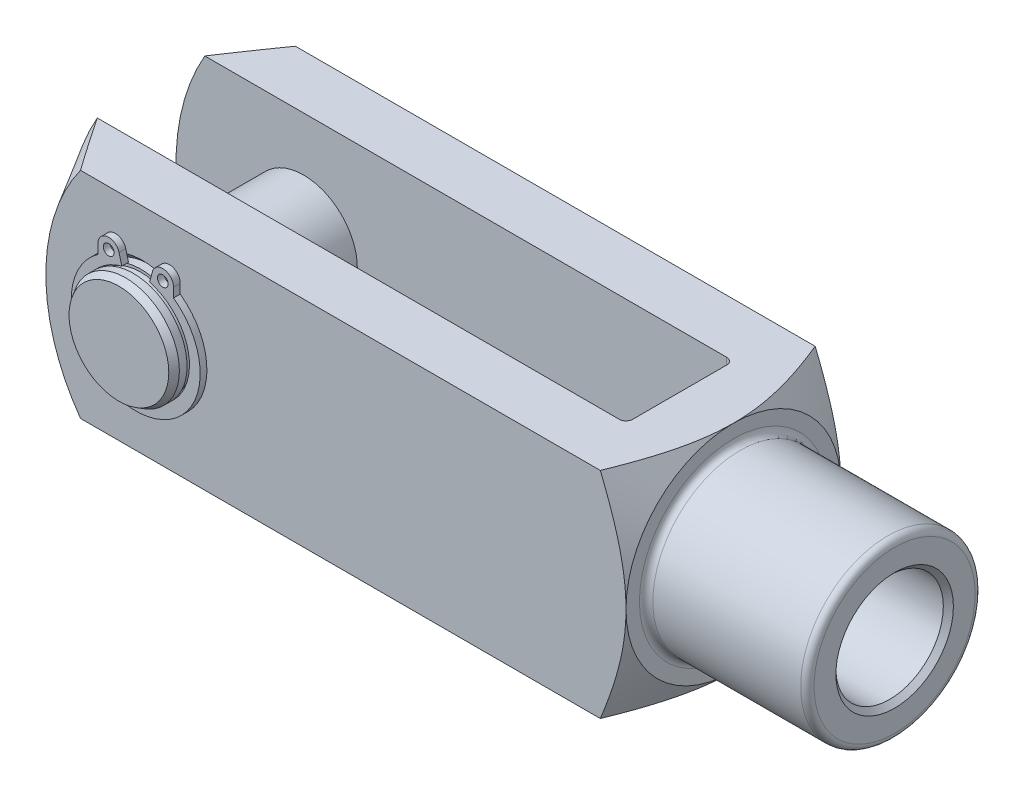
ISO-10303-21;
HEADER;
FILE_DESCRIPTION(('STEP AP214'),'2;1');
FILE_NAME('part.step','',(''),(''),'','','');
FILE_SCHEMA(('AUTOMOTIVE_DESIGN { 1 0 10303 214 1 1 1 1 }'));
ENDSEC;
DATA;
#1=APPLICATION_CONTEXT('core data for automotive mechanical design processes');
#2=APPLICATION_PROTOCOL_DEFINITION('international standard','automotive_design',2000,#1);
#3=PRODUCT_CONTEXT('',#1,'mechanical');
#4=PRODUCT('Part','Part','',(#3));
#5=PRODUCT_RELATED_PRODUCT_CATEGORY('part','',(#4));
#6=PRODUCT_DEFINITION_FORMATION('','',#4);
#7=PRODUCT_DEFINITION_CONTEXT('part definition',#1,'design');
#8=PRODUCT_DEFINITION('design','',#6,#7);
#9=PRODUCT_DEFINITION_SHAPE('','',#8);
#10=(LENGTH_UNIT() NAMED_UNIT(*) SI_UNIT(.MILLI.,.METRE.));
#11=(NAMED_UNIT(*) PLANE_ANGLE_UNIT() SI_UNIT($,.RADIAN.));
#12=(NAMED_UNIT(*) SI_UNIT($,.STERADIAN.) SOLID_ANGLE_UNIT());
#13=UNCERTAINTY_MEASURE_WITH_UNIT(LENGTH_MEASURE(1.E-05),#10,'distance_accuracy_value','');
#14=(GEOMETRIC_REPRESENTATION_CONTEXT(3) GLOBAL_UNCERTAINTY_ASSIGNED_CONTEXT((#13)) GLOBAL_UNIT_ASSIGNED_CONTEXT((#10,
#11,#12)) REPRESENTATION_CONTEXT('',''));
#15=CARTESIAN_POINT('',(0.,0.,0.));
#16=DIRECTION('',(0.,0.,1.));
#17=DIRECTION('',(1.,0.,0.));
#18=AXIS2_PLACEMENT_3D('',#15,#16,#17);
#19=CARTESIAN_POINT('',(-96.,0.,19.5));
#20=DIRECTION('',(0.,0.,-1.));
#21=DIRECTION('',(-1.,0.,0.));
#22=AXIS2_PLACEMENT_3D('',#19,#20,#21);
#23=CYLINDRICAL_SURFACE('',#22,8.);
#24=CARTESIAN_POINT('',(-96.,0.,16.25));
#25=DIRECTION('',(0.,0.,1.));
#26=DIRECTION('',(1.,0.,0.));
#27=AXIS2_PLACEMENT_3D('',#24,#25,#26);
#28=CIRCLE('',#27,8.);
#29=CARTESIAN_POINT('',(-88.,0.,16.25));
#30=VERTEX_POINT('',#29);
#31=EDGE_CURVE('P0_E55',#30,#30,#28,.T.);
#32=ORIENTED_EDGE('',*,*,#31,.F.);
#33=EDGE_LOOP('',(#32));
#34=FACE_BOUND('',#33,.T.);
#35=CARTESIAN_POINT('',(-96.,0.,-16.25));
#36=DIRECTION('',(0.,0.,1.));
#37=DIRECTION('',(1.,0.,0.));
#38=AXIS2_PLACEMENT_3D('',#35,#36,#37);
#39=CIRCLE('',#38,8.);
#40=CARTESIAN_POINT('',(-88.,0.,-16.25));
#41=VERTEX_POINT('',#40);
#42=EDGE_CURVE('P0_E40',#41,#41,#39,.T.);
#43=ORIENTED_EDGE('',*,*,#42,.T.);
#44=EDGE_LOOP('',(#43));
#45=FACE_BOUND('',#44,.T.);
#46=ADVANCED_FACE('P0_F14',(#34,#45),#23,.T.);
#47=CARTESIAN_POINT('',(-96.,0.,-17.35));
#48=DIRECTION('',(0.,0.,1.));
#49=DIRECTION('',(1.,0.,0.));
#50=AXIS2_PLACEMENT_3D('',#47,#48,#49);
#51=CIRCLE('',#50,8.);
#52=CARTESIAN_POINT('',(-88.,0.,-17.35));
#53=VERTEX_POINT('',#52);
#54=EDGE_CURVE('P0_E43',#53,#53,#51,.T.);
#55=ORIENTED_EDGE('',*,*,#54,.F.);
#56=EDGE_LOOP('',(#55));
#57=FACE_BOUND('',#56,.T.);
#58=CARTESIAN_POINT('',(-96.,0.,-18.5));
#59=DIRECTION('',(0.,0.,1.));
#60=DIRECTION('',(1.,0.,0.));
#61=AXIS2_PLACEMENT_3D('',#58,#59,#60);
#62=CIRCLE('',#61,8.);
#63=CARTESIAN_POINT('',(-88.,0.,-18.5));
#64=VERTEX_POINT('',#63);
#65=EDGE_CURVE('P0_E25',#64,#64,#62,.T.);
#66=ORIENTED_EDGE('',*,*,#65,.T.);
#67=EDGE_LOOP('',(#66));
#68=FACE_BOUND('',#67,.T.);
#69=ADVANCED_FACE('P0_F63',(#57,#68),#23,.T.);
#70=CARTESIAN_POINT('',(-96.,0.,-19.5));
#71=DIRECTION('',(0.,0.,1.));
#72=DIRECTION('',(1.,0.,0.));
#73=AXIS2_PLACEMENT_3D('',#70,#71,#72);
#74=PLANE('',#73);
#75=CARTESIAN_POINT('',(-96.,0.,-19.5));
#76=DIRECTION('',(0.,0.,1.));
#77=DIRECTION('',(1.,0.,0.));
#78=AXIS2_PLACEMENT_3D('',#75,#76,#77);
#79=CIRCLE('',#78,7.42264973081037);
#80=CARTESIAN_POINT('',(-88.5773502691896,0.,-19.5));
#81=VERTEX_POINT('',#80);
#82=EDGE_CURVE('P0_E21',#81,#81,#79,.F.);
#83=ORIENTED_EDGE('',*,*,#82,.T.);
#84=EDGE_LOOP('',(#83));
#85=FACE_BOUND('',#84,.T.);
#86=ADVANCED_FACE('P0_F89',(#85),#74,.F.);
#87=CARTESIAN_POINT('',(-96.,0.,-18.5));
#88=DIRECTION('',(0.,0.,1.));
#89=DIRECTION('',(1.,0.,0.));
#90=AXIS2_PLACEMENT_3D('',#87,#88,#89);
#91=CONICAL_SURFACE('',#90,8.,0.523598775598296);
#92=ORIENTED_EDGE('',*,*,#82,.F.);
#93=EDGE_LOOP('',(#92));
#94=FACE_BOUND('',#93,.T.);
#95=ORIENTED_EDGE('',*,*,#65,.F.);
#96=EDGE_LOOP('',(#95));
#97=FACE_BOUND('',#96,.T.);
#98=ADVANCED_FACE('P0_F83',(#94,#97),#91,.T.);
#99=CARTESIAN_POINT('',(-96.,8.,-17.35));
#100=DIRECTION('',(0.,0.,-1.));
#101=DIRECTION('',(-1.,0.,0.));
#102=AXIS2_PLACEMENT_3D('',#99,#100,#101);
#103=PLANE('',#102);
#104=CARTESIAN_POINT('',(-96.,0.,-17.35));
#105=DIRECTION('',(0.,0.,1.));
#106=DIRECTION('',(1.,0.,0.));
#107=AXIS2_PLACEMENT_3D('',#104,#105,#106);
#108=CIRCLE('',#107,7.6);
#109=CARTESIAN_POINT('',(-88.4,0.,-17.35));
#110=VERTEX_POINT('',#109);
#111=EDGE_CURVE('P0_E34',#110,#110,#108,.T.);
#112=ORIENTED_EDGE('',*,*,#111,.F.);
#113=EDGE_LOOP('',(#112));
#114=FACE_BOUND('',#113,.T.);
#115=ORIENTED_EDGE('',*,*,#54,.T.);
#116=EDGE_LOOP('',(#115));
#117=FACE_BOUND('',#116,.T.);
#118=ADVANCED_FACE('P0_F77',(#114,#117),#103,.F.);
#119=CARTESIAN_POINT('',(-96.,0.,18.5));
#120=DIRECTION('',(0.,0.,1.));
#121=DIRECTION('',(1.,0.,0.));
#122=AXIS2_PLACEMENT_3D('',#119,#120,#121);
#123=CYLINDRICAL_SURFACE('',#122,7.6);
#124=CARTESIAN_POINT('',(-96.,0.,-16.25));
#125=DIRECTION('',(0.,0.,1.));
#126=DIRECTION('',(1.,0.,0.));
#127=AXIS2_PLACEMENT_3D('',#124,#125,#126);
#128=CIRCLE('',#127,7.6);
#129=CARTESIAN_POINT('',(-88.4,0.,-16.25));
#130=VERTEX_POINT('',#129);
#131=EDGE_CURVE('P0_E37',#130,#130,#128,.T.);
#132=ORIENTED_EDGE('',*,*,#131,.F.);
#133=EDGE_LOOP('',(#132));
#134=FACE_BOUND('',#133,.T.);
#135=ORIENTED_EDGE('',*,*,#111,.T.);
#136=EDGE_LOOP('',(#135));
#137=FACE_BOUND('',#136,.T.);
#138=ADVANCED_FACE('P0_F71',(#134,#137),#123,.T.);
#139=CARTESIAN_POINT('',(-96.,8.,-16.25));
#140=DIRECTION('',(0.,0.,1.));
#141=DIRECTION('',(1.,0.,0.));
#142=AXIS2_PLACEMENT_3D('',#139,#140,#141);
#143=PLANE('',#142);
#144=ORIENTED_EDGE('',*,*,#42,.F.);
#145=EDGE_LOOP('',(#144));
#146=FACE_BOUND('',#145,.T.);
#147=ORIENTED_EDGE('',*,*,#131,.T.);
#148=EDGE_LOOP('',(#147));
#149=FACE_BOUND('',#148,.T.);
#150=ADVANCED_FACE('P0_F68',(#146,#149),#143,.F.);
#151=CARTESIAN_POINT('',(-96.,8.,16.25));
#152=DIRECTION('',(0.,0.,-1.));
#153=DIRECTION('',(-1.,0.,0.));
#154=AXIS2_PLACEMENT_3D('',#151,#152,#153);
#155=PLANE('',#154);
#156=CARTESIAN_POINT('',(-96.,0.,16.25));
#157=DIRECTION('',(0.,0.,1.));
#158=DIRECTION('',(1.,0.,0.));
#159=AXIS2_PLACEMENT_3D('',#156,#157,#158);
#160=CIRCLE('',#159,7.6);
#161=CARTESIAN_POINT('',(-88.4,0.,16.25));
#162=VERTEX_POINT('',#161);
#163=EDGE_CURVE('P0_E46',#162,#162,#160,.T.);
#164=ORIENTED_EDGE('',*,*,#163,.F.);
#165=EDGE_LOOP('',(#164));
#166=FACE_BOUND('',#165,.T.);
#167=ORIENTED_EDGE('',*,*,#31,.T.);
#168=EDGE_LOOP('',(#167));
#169=FACE_BOUND('',#168,.T.);
#170=ADVANCED_FACE('P0_F59',(#166,#169),#155,.F.);
#171=CARTESIAN_POINT('',(-96.,0.,18.5));
#172=DIRECTION('',(0.,0.,1.));
#173=DIRECTION('',(1.,0.,0.));
#174=AXIS2_PLACEMENT_3D('',#171,#172,#173);
#175=CYLINDRICAL_SURFACE('',#174,7.6);
#176=CARTESIAN_POINT('',(-96.,0.,17.35));
#177=DIRECTION('',(0.,0.,1.));
#178=DIRECTION('',(1.,0.,0.));
#179=AXIS2_PLACEMENT_3D('',#176,#177,#178);
#180=CIRCLE('',#179,7.6);
#181=CARTESIAN_POINT('',(-88.4,0.,17.35));
#182=VERTEX_POINT('',#181);
#183=EDGE_CURVE('P0_E49',#182,#182,#180,.T.);
#184=ORIENTED_EDGE('',*,*,#183,.F.);
#185=EDGE_LOOP('',(#184));
#186=FACE_BOUND('',#185,.T.);
#187=ORIENTED_EDGE('',*,*,#163,.T.);
#188=EDGE_LOOP('',(#187));
#189=FACE_BOUND('',#188,.T.);
#190=ADVANCED_FACE('P0_F108',(#186,#189),#175,.T.);
#191=CARTESIAN_POINT('',(-96.,8.,17.35));
#192=DIRECTION('',(0.,0.,1.));
#193=DIRECTION('',(1.,0.,0.));
#194=AXIS2_PLACEMENT_3D('',#191,#192,#193);
#195=PLANE('',#194);
#196=CARTESIAN_POINT('',(-96.,0.,17.35));
#197=DIRECTION('',(0.,0.,1.));
#198=DIRECTION('',(1.,0.,0.));
#199=AXIS2_PLACEMENT_3D('',#196,#197,#198);
#200=CIRCLE('',#199,8.);
#201=CARTESIAN_POINT('',(-88.,0.,17.35));
#202=VERTEX_POINT('',#201);
#203=EDGE_CURVE('P0_E52',#202,#202,#200,.T.);
#204=ORIENTED_EDGE('',*,*,#203,.F.);
#205=EDGE_LOOP('',(#204));
#206=FACE_BOUND('',#205,.T.);
#207=ORIENTED_EDGE('',*,*,#183,.T.);
#208=EDGE_LOOP('',(#207));
#209=FACE_BOUND('',#208,.T.);
#210=ADVANCED_FACE('P0_F104',(#206,#209),#195,.F.);
#211=CARTESIAN_POINT('',(-96.,0.,19.5));
#212=DIRECTION('',(0.,0.,1.));
#213=DIRECTION('',(1.,0.,0.));
#214=AXIS2_PLACEMENT_3D('',#211,#212,#213);
#215=PLANE('',#214);
#216=CARTESIAN_POINT('',(-96.,0.,19.5));
#217=DIRECTION('',(0.,0.,1.));
#218=DIRECTION('',(1.,0.,0.));
#219=AXIS2_PLACEMENT_3D('',#216,#217,#218);
#220=CIRCLE('',#219,7.42264973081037);
#221=CARTESIAN_POINT('',(-88.5773502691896,0.,19.5));
#222=VERTEX_POINT('',#221);
#223=EDGE_CURVE('P0_E10',#222,#222,#220,.T.);
#224=ORIENTED_EDGE('',*,*,#223,.T.);
#225=EDGE_LOOP('',(#224));
#226=FACE_BOUND('',#225,.T.);
#227=ADVANCED_FACE('P0_F102',(#226),#215,.T.);
#228=CARTESIAN_POINT('',(-96.,0.,19.5));
#229=DIRECTION('',(0.,0.,-1.));
#230=DIRECTION('',(-1.,0.,0.));
#231=AXIS2_PLACEMENT_3D('',#228,#229,#230);
#232=CONICAL_SURFACE('',#231,7.42264973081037,0.523598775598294);
#233=CARTESIAN_POINT('',(-96.,0.,18.5));
#234=DIRECTION('',(0.,0.,1.));
#235=DIRECTION('',(1.,0.,0.));
#236=AXIS2_PLACEMENT_3D('',#233,#234,#235);
#237=CIRCLE('',#236,8.);
#238=CARTESIAN_POINT('',(-88.,0.,18.5));
#239=VERTEX_POINT('',#238);
#240=EDGE_CURVE('P0_E29',#239,#239,#237,.F.);
#241=ORIENTED_EDGE('',*,*,#240,.F.);
#242=EDGE_LOOP('',(#241));
#243=FACE_BOUND('',#242,.T.);
#244=ORIENTED_EDGE('',*,*,#223,.F.);
#245=EDGE_LOOP('',(#244));
#246=FACE_BOUND('',#245,.T.);
#247=ADVANCED_FACE('P0_F16',(#243,#246),#232,.T.);
#248=ORIENTED_EDGE('',*,*,#203,.T.);
#249=EDGE_LOOP('',(#248));
#250=FACE_BOUND('',#249,.T.);
#251=ORIENTED_EDGE('',*,*,#240,.T.);
#252=EDGE_LOOP('',(#251));
#253=FACE_BOUND('',#252,.T.);
#254=ADVANCED_FACE('P0_F65',(#250,#253),#23,.T.);
#255=CLOSED_SHELL('',(#46,#69,#86,#98,#118,#138,#150,#170,#190,#210,#227,#247,#254));
#256=MANIFOLD_SOLID_BREP('P0_B1',#255);
#257=CARTESIAN_POINT('',(-96.0000000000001,0.,16.9999999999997));
#258=DIRECTION('',(0.,0.,1.));
#259=DIRECTION('',(1.,0.,0.));
#260=AXIS2_PLACEMENT_3D('',#257,#258,#259);
#261=PLANE('',#260);
#262=CARTESIAN_POINT('',(-100.030144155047,8.85877746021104,16.9999999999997));
#263=DIRECTION('',(0.,0.,1.));
#264=DIRECTION('',(1.,0.,0.));
#265=AXIS2_PLACEMENT_3D('',#262,#263,#264);
#266=CIRCLE('',#265,0.8);
#267=CARTESIAN_POINT('',(-99.2301441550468,8.85877746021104,16.9999999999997));
#268=VERTEX_POINT('',#267);
#269=EDGE_CURVE('P1_E117',#268,#268,#266,.T.);
#270=ORIENTED_EDGE('',*,*,#269,.F.);
#271=EDGE_LOOP('',(#270));
#272=FACE_BOUND('',#271,.T.);
#273=CARTESIAN_POINT('',(-96.0000000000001,0.,16.9999999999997));
#274=DIRECTION('',(0.,0.,-1.));
#275=DIRECTION('',(1.,0.,0.));
#276=AXIS2_PLACEMENT_3D('',#273,#274,#275);
#277=CIRCLE('',#276,8.);
#278=CARTESIAN_POINT('',(-93.9294476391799,7.72740661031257,16.9999999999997));
#279=VERTEX_POINT('',#278);
#280=CARTESIAN_POINT('',(-98.0705523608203,7.72740661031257,16.9999999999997));
#281=VERTEX_POINT('',#280);
#282=EDGE_CURVE('P1_E128',#279,#281,#277,.T.);
#283=ORIENTED_EDGE('',*,*,#282,.T.);
#284=DIRECTION('',(-0.258819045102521,0.965925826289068,0.));
#285=VECTOR('',#284,1.);
#286=CARTESIAN_POINT('',(-98.0705523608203,7.72740661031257,16.9999999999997));
#287=LINE('',#286,#285);
#288=CARTESIAN_POINT('',(-98.4846628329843,9.27288793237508,16.9999999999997));
#289=VERTEX_POINT('',#288);
#290=EDGE_CURVE('P1_E76',#281,#289,#287,.T.);
#291=ORIENTED_EDGE('',*,*,#290,.T.);
#292=CARTESIAN_POINT('',(-100.030144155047,8.85877746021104,16.9999999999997));
#293=DIRECTION('',(0.,0.,1.));
#294=DIRECTION('',(1.,0.,0.));
#295=AXIS2_PLACEMENT_3D('',#292,#293,#294);
#296=CIRCLE('',#295,1.6);
#297=CARTESIAN_POINT('',(-101.630144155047,8.85877746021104,16.9999999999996));
#298=VERTEX_POINT('',#297);
#299=EDGE_CURVE('P1_E143',#289,#298,#296,.T.);
#300=ORIENTED_EDGE('',*,*,#299,.T.);
#301=DIRECTION('',(0.,-1.,0.));
#302=VECTOR('',#301,1.);
#303=CARTESIAN_POINT('',(-101.630144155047,8.85877746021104,16.9999999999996));
#304=LINE('',#303,#302);
#305=CARTESIAN_POINT('',(-101.630144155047,7.45569783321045,16.9999999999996));
#306=VERTEX_POINT('',#305);
#307=EDGE_CURVE('P1_E156',#298,#306,#304,.T.);
#308=ORIENTED_EDGE('',*,*,#307,.T.);
#309=CARTESIAN_POINT('',(-96.0000000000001,-0.319999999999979,16.9999999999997));
#310=DIRECTION('',(0.,0.,1.));
#311=DIRECTION('',(1.,0.,0.));
#312=AXIS2_PLACEMENT_3D('',#309,#310,#311);
#313=CIRCLE('',#312,9.6);
#314=CARTESIAN_POINT('',(-90.3698558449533,7.45569783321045,16.9999999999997));
#315=VERTEX_POINT('',#314);
#316=EDGE_CURVE('P1_E95',#306,#315,#313,.T.);
#317=ORIENTED_EDGE('',*,*,#316,.T.);
#318=DIRECTION('',(0.,1.,0.));
#319=VECTOR('',#318,1.);
#320=CARTESIAN_POINT('',(-90.3698558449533,8.85877746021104,16.9999999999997));
#321=LINE('',#320,#319);
#322=CARTESIAN_POINT('',(-90.3698558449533,8.85877746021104,16.9999999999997));
#323=VERTEX_POINT('',#322);
#324=EDGE_CURVE('P1_E89',#315,#323,#321,.T.);
#325=ORIENTED_EDGE('',*,*,#324,.T.);
#326=CARTESIAN_POINT('',(-91.9698558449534,8.85877746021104,16.9999999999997));
#327=DIRECTION('',(0.,0.,1.));
#328=DIRECTION('',(-1.,0.,0.));
#329=AXIS2_PLACEMENT_3D('',#326,#327,#328);
#330=CIRCLE('',#329,1.6);
#331=CARTESIAN_POINT('',(-93.5153371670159,9.27288793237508,16.9999999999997));
#332=VERTEX_POINT('',#331);
#333=EDGE_CURVE('P1_E93',#323,#332,#330,.T.);
#334=ORIENTED_EDGE('',*,*,#333,.T.);
#335=DIRECTION('',(-0.258819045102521,-0.965925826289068,0.));
#336=VECTOR('',#335,1.);
#337=CARTESIAN_POINT('',(-93.9294476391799,7.72740661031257,16.9999999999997));
#338=LINE('',#337,#336);
#339=EDGE_CURVE('P1_E33',#332,#279,#338,.T.);
#340=ORIENTED_EDGE('',*,*,#339,.T.);
#341=EDGE_LOOP('',(#283,#291,#300,#308,#317,#325,#334,#340));
#342=FACE_BOUND('',#341,.T.);
#343=CARTESIAN_POINT('',(-91.9698558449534,8.85877746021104,16.9999999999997));
#344=DIRECTION('',(0.,0.,1.));
#345=DIRECTION('',(-1.,0.,0.));
#346=AXIS2_PLACEMENT_3D('',#343,#344,#345);
#347=CIRCLE('',#346,0.8);
#348=CARTESIAN_POINT('',(-92.7698558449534,8.85877746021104,16.9999999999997));
#349=VERTEX_POINT('',#348);
#350=EDGE_CURVE('P1_E165',#349,#349,#347,.T.);
#351=ORIENTED_EDGE('',*,*,#350,.F.);
#352=EDGE_LOOP('',(#351));
#353=FACE_BOUND('',#352,.T.);
#354=ADVANCED_FACE('P1_F16',(#272,#342,#353),#261,.T.);
#355=CARTESIAN_POINT('',(-96.0000000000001,0.,15.9999999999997));
#356=DIRECTION('',(0.,0.,1.));
#357=DIRECTION('',(1.,0.,0.));
#358=AXIS2_PLACEMENT_3D('',#355,#356,#357);
#359=PLANE('',#358);
#360=CARTESIAN_POINT('',(-100.030144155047,8.85877746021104,15.9999999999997));
#361=DIRECTION('',(0.,0.,1.));
#362=DIRECTION('',(1.,0.,0.));
#363=AXIS2_PLACEMENT_3D('',#360,#361,#362);
#364=CIRCLE('',#363,0.8);
#365=CARTESIAN_POINT('',(-99.2301441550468,8.85877746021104,15.9999999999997));
#366=VERTEX_POINT('',#365);
#367=EDGE_CURVE('P1_E162',#366,#366,#364,.T.);
#368=ORIENTED_EDGE('',*,*,#367,.T.);
#369=EDGE_LOOP('',(#368));
#370=FACE_BOUND('',#369,.T.);
#371=CARTESIAN_POINT('',(-96.0000000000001,0.,15.9999999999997));
#372=DIRECTION('',(0.,0.,-1.));
#373=DIRECTION('',(1.,0.,0.));
#374=AXIS2_PLACEMENT_3D('',#371,#372,#373);
#375=CIRCLE('',#374,8.);
#376=CARTESIAN_POINT('',(-93.9294476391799,7.72740661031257,15.9999999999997));
#377=VERTEX_POINT('',#376);
#378=CARTESIAN_POINT('',(-98.0705523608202,7.72740661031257,15.9999999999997));
#379=VERTEX_POINT('',#378);
#380=EDGE_CURVE('P1_E113',#377,#379,#375,.T.);
#381=ORIENTED_EDGE('',*,*,#380,.F.);
#382=DIRECTION('',(-0.258819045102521,-0.965925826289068,0.));
#383=VECTOR('',#382,1.);
#384=CARTESIAN_POINT('',(-93.9294476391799,7.72740661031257,15.9999999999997));
#385=LINE('',#384,#383);
#386=CARTESIAN_POINT('',(-93.5153371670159,9.27288793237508,15.9999999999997));
#387=VERTEX_POINT('',#386);
#388=EDGE_CURVE('P1_E68',#387,#377,#385,.T.);
#389=ORIENTED_EDGE('',*,*,#388,.F.);
#390=CARTESIAN_POINT('',(-91.9698558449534,8.85877746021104,15.9999999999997));
#391=DIRECTION('',(0.,0.,1.));
#392=DIRECTION('',(-1.,0.,0.));
#393=AXIS2_PLACEMENT_3D('',#390,#391,#392);
#394=CIRCLE('',#393,1.6);
#395=CARTESIAN_POINT('',(-90.3698558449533,8.85877746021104,15.9999999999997));
#396=VERTEX_POINT('',#395);
#397=EDGE_CURVE('P1_E62',#396,#387,#394,.T.);
#398=ORIENTED_EDGE('',*,*,#397,.F.);
#399=DIRECTION('',(0.,1.,0.));
#400=VECTOR('',#399,1.);
#401=CARTESIAN_POINT('',(-90.3698558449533,8.85877746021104,15.9999999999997));
#402=LINE('',#401,#400);
#403=CARTESIAN_POINT('',(-90.3698558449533,7.45569783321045,15.9999999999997));
#404=VERTEX_POINT('',#403);
#405=EDGE_CURVE('P1_E103',#404,#396,#402,.T.);
#406=ORIENTED_EDGE('',*,*,#405,.F.);
#407=CARTESIAN_POINT('',(-96.0000000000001,-0.319999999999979,15.9999999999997));
#408=DIRECTION('',(0.,0.,1.));
#409=DIRECTION('',(1.,0.,0.));
#410=AXIS2_PLACEMENT_3D('',#407,#408,#409);
#411=CIRCLE('',#410,9.6);
#412=CARTESIAN_POINT('',(-101.630144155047,7.45569783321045,15.9999999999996));
#413=VERTEX_POINT('',#412);
#414=EDGE_CURVE('P1_E123',#413,#404,#411,.T.);
#415=ORIENTED_EDGE('',*,*,#414,.F.);
#416=DIRECTION('',(0.,-1.,0.));
#417=VECTOR('',#416,1.);
#418=CARTESIAN_POINT('',(-101.630144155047,8.85877746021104,15.9999999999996));
#419=LINE('',#418,#417);
#420=CARTESIAN_POINT('',(-101.630144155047,8.85877746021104,15.9999999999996));
#421=VERTEX_POINT('',#420);
#422=EDGE_CURVE('P1_E121',#421,#413,#419,.T.);
#423=ORIENTED_EDGE('',*,*,#422,.F.);
#424=CARTESIAN_POINT('',(-100.030144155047,8.85877746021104,15.9999999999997));
#425=DIRECTION('',(0.,0.,1.));
#426=DIRECTION('',(1.,0.,0.));
#427=AXIS2_PLACEMENT_3D('',#424,#425,#426);
#428=CIRCLE('',#427,1.6);
#429=CARTESIAN_POINT('',(-98.4846628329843,9.27288793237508,15.9999999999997));
#430=VERTEX_POINT('',#429);
#431=EDGE_CURVE('P1_E119',#430,#421,#428,.T.);
#432=ORIENTED_EDGE('',*,*,#431,.F.);
#433=DIRECTION('',(-0.258819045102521,0.965925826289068,0.));
#434=VECTOR('',#433,1.);
#435=CARTESIAN_POINT('',(-98.0705523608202,7.72740661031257,15.9999999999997));
#436=LINE('',#435,#434);
#437=EDGE_CURVE('P1_E116',#379,#430,#436,.T.);
#438=ORIENTED_EDGE('',*,*,#437,.F.);
#439=EDGE_LOOP('',(#381,#389,#398,#406,#415,#423,#432,#438));
#440=FACE_BOUND('',#439,.T.);
#441=CARTESIAN_POINT('',(-91.9698558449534,8.85877746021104,15.9999999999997));
#442=DIRECTION('',(0.,0.,1.));
#443=DIRECTION('',(-1.,0.,0.));
#444=AXIS2_PLACEMENT_3D('',#441,#442,#443);
#445=CIRCLE('',#444,0.8);
#446=CARTESIAN_POINT('',(-92.7698558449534,8.85877746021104,15.9999999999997));
#447=VERTEX_POINT('',#446);
#448=EDGE_CURVE('P1_E168',#447,#447,#445,.T.);
#449=ORIENTED_EDGE('',*,*,#448,.T.);
#450=EDGE_LOOP('',(#449));
#451=FACE_BOUND('',#450,.T.);
#452=ADVANCED_FACE('P1_F147',(#370,#440,#451),#359,.F.);
#453=CARTESIAN_POINT('',(-96.0000000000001,0.,16.9999999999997));
#454=DIRECTION('',(0.,0.,-1.));
#455=DIRECTION('',(-1.,0.,0.));
#456=AXIS2_PLACEMENT_3D('',#453,#454,#455);
#457=CYLINDRICAL_SURFACE('',#456,8.);
#458=ORIENTED_EDGE('',*,*,#380,.T.);
#459=DIRECTION('',(0.,0.,-1.));
#460=VECTOR('',#459,1.);
#461=CARTESIAN_POINT('',(-98.0705523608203,7.72740661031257,16.9999999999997));
#462=LINE('',#461,#460);
#463=EDGE_CURVE('P1_E11',#281,#379,#462,.T.);
#464=ORIENTED_EDGE('',*,*,#463,.F.);
#465=ORIENTED_EDGE('',*,*,#282,.F.);
#466=DIRECTION('',(0.,0.,-1.));
#467=VECTOR('',#466,1.);
#468=CARTESIAN_POINT('',(-93.9294476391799,7.72740661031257,16.9999999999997));
#469=LINE('',#468,#467);
#470=EDGE_CURVE('P1_E109',#279,#377,#469,.T.);
#471=ORIENTED_EDGE('',*,*,#470,.T.);
#472=EDGE_LOOP('',(#458,#464,#465,#471));
#473=FACE_BOUND('',#472,.T.);
#474=ADVANCED_FACE('P1_F18',(#473),#457,.F.);
#475=CARTESIAN_POINT('',(-98.0705523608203,7.72740661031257,16.9999999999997));
#476=DIRECTION('',(-0.965925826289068,-0.258819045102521,0.));
#477=DIRECTION('',(0.258819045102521,-0.965925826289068,0.));
#478=AXIS2_PLACEMENT_3D('',#475,#476,#477);
#479=PLANE('',#478);
#480=ORIENTED_EDGE('',*,*,#437,.T.);
#481=DIRECTION('',(0.,0.,-1.));
#482=VECTOR('',#481,1.);
#483=CARTESIAN_POINT('',(-98.4846628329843,9.27288793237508,16.9999999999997));
#484=LINE('',#483,#482);
#485=EDGE_CURVE('P1_E25',#289,#430,#484,.T.);
#486=ORIENTED_EDGE('',*,*,#485,.F.);
#487=ORIENTED_EDGE('',*,*,#290,.F.);
#488=ORIENTED_EDGE('',*,*,#463,.T.);
#489=EDGE_LOOP('',(#480,#486,#487,#488));
#490=FACE_BOUND('',#489,.T.);
#491=ADVANCED_FACE('P1_F202',(#490),#479,.F.);
#492=CARTESIAN_POINT('',(-100.030144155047,8.85877746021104,16.9999999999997));
#493=DIRECTION('',(0.,0.,-1.));
#494=DIRECTION('',(-1.,0.,0.));
#495=AXIS2_PLACEMENT_3D('',#492,#493,#494);
#496=CYLINDRICAL_SURFACE('',#495,1.6);
#497=ORIENTED_EDGE('',*,*,#431,.T.);
#498=DIRECTION('',(0.,0.,-1.));
#499=VECTOR('',#498,1.);
#500=CARTESIAN_POINT('',(-101.630144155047,8.85877746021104,16.9999999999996));
#501=LINE('',#500,#499);
#502=EDGE_CURVE('P1_E135',#298,#421,#501,.T.);
#503=ORIENTED_EDGE('',*,*,#502,.F.);
#504=ORIENTED_EDGE('',*,*,#299,.F.);
#505=ORIENTED_EDGE('',*,*,#485,.T.);
#506=EDGE_LOOP('',(#497,#503,#504,#505));
#507=FACE_BOUND('',#506,.T.);
#508=ADVANCED_FACE('P1_F141',(#507),#496,.T.);
#509=CARTESIAN_POINT('',(-101.630144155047,8.85877746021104,16.9999999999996));
#510=DIRECTION('',(1.,0.,0.));
#511=DIRECTION('',(0.,1.,0.));
#512=AXIS2_PLACEMENT_3D('',#509,#510,#511);
#513=PLANE('',#512);
#514=ORIENTED_EDGE('',*,*,#422,.T.);
#515=DIRECTION('',(0.,0.,-1.));
#516=VECTOR('',#515,1.);
#517=CARTESIAN_POINT('',(-101.630144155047,7.45569783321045,16.9999999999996));
#518=LINE('',#517,#516);
#519=EDGE_CURVE('P1_E132',#306,#413,#518,.T.);
#520=ORIENTED_EDGE('',*,*,#519,.F.);
#521=ORIENTED_EDGE('',*,*,#307,.F.);
#522=ORIENTED_EDGE('',*,*,#502,.T.);
#523=EDGE_LOOP('',(#514,#520,#521,#522));
#524=FACE_BOUND('',#523,.T.);
#525=ADVANCED_FACE('P1_F152',(#524),#513,.F.);
#526=CARTESIAN_POINT('',(-96.0000000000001,-0.319999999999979,16.9999999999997));
#527=DIRECTION('',(0.,0.,-1.));
#528=DIRECTION('',(-1.,0.,0.));
#529=AXIS2_PLACEMENT_3D('',#526,#527,#528);
#530=CYLINDRICAL_SURFACE('',#529,9.6);
#531=ORIENTED_EDGE('',*,*,#414,.T.);
#532=DIRECTION('',(0.,0.,-1.));
#533=VECTOR('',#532,1.);
#534=CARTESIAN_POINT('',(-90.3698558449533,7.45569783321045,16.9999999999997));
#535=LINE('',#534,#533);
#536=EDGE_CURVE('P1_E104',#315,#404,#535,.T.);
#537=ORIENTED_EDGE('',*,*,#536,.F.);
#538=ORIENTED_EDGE('',*,*,#316,.F.);
#539=ORIENTED_EDGE('',*,*,#519,.T.);
#540=EDGE_LOOP('',(#531,#537,#538,#539));
#541=FACE_BOUND('',#540,.T.);
#542=ADVANCED_FACE('P1_F155',(#541),#530,.T.);
#543=CARTESIAN_POINT('',(-90.3698558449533,8.85877746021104,16.9999999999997));
#544=DIRECTION('',(-1.,0.,0.));
#545=DIRECTION('',(0.,-1.,0.));
#546=AXIS2_PLACEMENT_3D('',#543,#544,#545);
#547=PLANE('',#546);
#548=ORIENTED_EDGE('',*,*,#405,.T.);
#549=DIRECTION('',(0.,0.,-1.));
#550=VECTOR('',#549,1.);
#551=CARTESIAN_POINT('',(-90.3698558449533,8.85877746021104,16.9999999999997));
#552=LINE('',#551,#550);
#553=EDGE_CURVE('P1_E100',#323,#396,#552,.T.);
#554=ORIENTED_EDGE('',*,*,#553,.F.);
#555=ORIENTED_EDGE('',*,*,#324,.F.);
#556=ORIENTED_EDGE('',*,*,#536,.T.);
#557=EDGE_LOOP('',(#548,#554,#555,#556));
#558=FACE_BOUND('',#557,.T.);
#559=ADVANCED_FACE('P1_F101',(#558),#547,.F.);
#560=CARTESIAN_POINT('',(-91.9698558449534,8.85877746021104,16.9999999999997));
#561=DIRECTION('',(0.,0.,-1.));
#562=DIRECTION('',(-1.,0.,0.));
#563=AXIS2_PLACEMENT_3D('',#560,#561,#562);
#564=CYLINDRICAL_SURFACE('',#563,1.6);
#565=ORIENTED_EDGE('',*,*,#397,.T.);
#566=DIRECTION('',(0.,0.,-1.));
#567=VECTOR('',#566,1.);
#568=CARTESIAN_POINT('',(-93.5153371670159,9.27288793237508,16.9999999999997));
#569=LINE('',#568,#567);
#570=EDGE_CURVE('P1_E105',#332,#387,#569,.T.);
#571=ORIENTED_EDGE('',*,*,#570,.F.);
#572=ORIENTED_EDGE('',*,*,#333,.F.);
#573=ORIENTED_EDGE('',*,*,#553,.T.);
#574=EDGE_LOOP('',(#565,#571,#572,#573));
#575=FACE_BOUND('',#574,.T.);
#576=ADVANCED_FACE('P1_F107',(#575),#564,.T.);
#577=CARTESIAN_POINT('',(-93.9294476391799,7.72740661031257,16.9999999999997));
#578=DIRECTION('',(0.965925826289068,-0.258819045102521,0.));
#579=DIRECTION('',(0.258819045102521,0.965925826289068,0.));
#580=AXIS2_PLACEMENT_3D('',#577,#578,#579);
#581=PLANE('',#580);
#582=ORIENTED_EDGE('',*,*,#388,.T.);
#583=ORIENTED_EDGE('',*,*,#470,.F.);
#584=ORIENTED_EDGE('',*,*,#339,.F.);
#585=ORIENTED_EDGE('',*,*,#570,.T.);
#586=EDGE_LOOP('',(#582,#583,#584,#585));
#587=FACE_BOUND('',#586,.T.);
#588=ADVANCED_FACE('P1_F190',(#587),#581,.F.);
#589=CARTESIAN_POINT('',(-100.030144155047,8.85877746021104,16.9999999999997));
#590=DIRECTION('',(0.,0.,-1.));
#591=DIRECTION('',(-1.,0.,0.));
#592=AXIS2_PLACEMENT_3D('',#589,#590,#591);
#593=CYLINDRICAL_SURFACE('',#592,0.8);
#594=ORIENTED_EDGE('',*,*,#269,.T.);
#595=EDGE_LOOP('',(#594));
#596=FACE_BOUND('',#595,.T.);
#597=ORIENTED_EDGE('',*,*,#367,.F.);
#598=EDGE_LOOP('',(#597));
#599=FACE_BOUND('',#598,.T.);
#600=ADVANCED_FACE('P1_F187',(#596,#599),#593,.F.);
#601=CARTESIAN_POINT('',(-91.9698558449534,8.85877746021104,16.9999999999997));
#602=DIRECTION('',(0.,0.,-1.));
#603=DIRECTION('',(-1.,0.,0.));
#604=AXIS2_PLACEMENT_3D('',#601,#602,#603);
#605=CYLINDRICAL_SURFACE('',#604,0.8);
#606=ORIENTED_EDGE('',*,*,#350,.T.);
#607=EDGE_LOOP('',(#606));
#608=FACE_BOUND('',#607,.T.);
#609=ORIENTED_EDGE('',*,*,#448,.F.);
#610=EDGE_LOOP('',(#609));
#611=FACE_BOUND('',#610,.T.);
#612=ADVANCED_FACE('P1_F174',(#608,#611),#605,.F.);
#613=CLOSED_SHELL('',(#354,#452,#474,#491,#508,#525,#542,#559,#576,#588,#600,#612));
#614=MANIFOLD_SOLID_BREP('P1_B1',#613);
#615=CARTESIAN_POINT('',(-96.0000000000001,0.,-16.9999999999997));
#616=DIRECTION('',(0.,0.,-1.));
#617=DIRECTION('',(-1.,0.,0.));
#618=AXIS2_PLACEMENT_3D('',#615,#616,#617);
#619=PLANE('',#618);
#620=CARTESIAN_POINT('',(-91.9698558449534,8.85877746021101,-16.9999999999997));
#621=DIRECTION('',(0.,0.,-1.));
#622=DIRECTION('',(-1.,0.,0.));
#623=AXIS2_PLACEMENT_3D('',#620,#621,#622);
#624=CIRCLE('',#623,0.8);
#625=CARTESIAN_POINT('',(-92.7698558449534,8.85877746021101,-16.9999999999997));
#626=VERTEX_POINT('',#625);
#627=EDGE_CURVE('P2_E117',#626,#626,#624,.T.);
#628=ORIENTED_EDGE('',*,*,#627,.F.);
#629=EDGE_LOOP('',(#628));
#630=FACE_BOUND('',#629,.T.);
#631=CARTESIAN_POINT('',(-96.0000000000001,0.,-16.9999999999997));
#632=DIRECTION('',(0.,0.,1.));
#633=DIRECTION('',(-1.,0.,0.));
#634=AXIS2_PLACEMENT_3D('',#631,#632,#633);
#635=CIRCLE('',#634,8.);
#636=CARTESIAN_POINT('',(-98.0705523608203,7.72740661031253,-16.9999999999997));
#637=VERTEX_POINT('',#636);
#638=CARTESIAN_POINT('',(-93.9294476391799,7.72740661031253,-16.9999999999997));
#639=VERTEX_POINT('',#638);
#640=EDGE_CURVE('P2_E128',#637,#639,#635,.T.);
#641=ORIENTED_EDGE('',*,*,#640,.T.);
#642=DIRECTION('',(0.258819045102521,0.965925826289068,0.));
#643=VECTOR('',#642,1.);
#644=CARTESIAN_POINT('',(-93.9294476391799,7.72740661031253,-16.9999999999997));
#645=LINE('',#644,#643);
#646=CARTESIAN_POINT('',(-93.5153371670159,9.27288793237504,-16.9999999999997));
#647=VERTEX_POINT('',#646);
#648=EDGE_CURVE('P2_E76',#639,#647,#645,.T.);
#649=ORIENTED_EDGE('',*,*,#648,.T.);
#650=CARTESIAN_POINT('',(-91.9698558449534,8.85877746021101,-16.9999999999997));
#651=DIRECTION('',(0.,0.,-1.));
#652=DIRECTION('',(-1.,0.,0.));
#653=AXIS2_PLACEMENT_3D('',#650,#651,#652);
#654=CIRCLE('',#653,1.6);
#655=CARTESIAN_POINT('',(-90.3698558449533,8.85877746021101,-16.9999999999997));
#656=VERTEX_POINT('',#655);
#657=EDGE_CURVE('P2_E143',#647,#656,#654,.T.);
#658=ORIENTED_EDGE('',*,*,#657,.T.);
#659=DIRECTION('',(0.,-1.,0.));
#660=VECTOR('',#659,1.);
#661=CARTESIAN_POINT('',(-90.3698558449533,8.85877746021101,-16.9999999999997));
#662=LINE('',#661,#660);
#663=CARTESIAN_POINT('',(-90.3698558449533,7.45569783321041,-16.9999999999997));
#664=VERTEX_POINT('',#663);
#665=EDGE_CURVE('P2_E156',#656,#664,#662,.T.);
#666=ORIENTED_EDGE('',*,*,#665,.T.);
#667=CARTESIAN_POINT('',(-96.0000000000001,-0.320000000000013,-16.9999999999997));
#668=DIRECTION('',(0.,0.,-1.));
#669=DIRECTION('',(-1.,0.,0.));
#670=AXIS2_PLACEMENT_3D('',#667,#668,#669);
#671=CIRCLE('',#670,9.6);
#672=CARTESIAN_POINT('',(-101.630144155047,7.45569783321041,-16.9999999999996));
#673=VERTEX_POINT('',#672);
#674=EDGE_CURVE('P2_E95',#664,#673,#671,.T.);
#675=ORIENTED_EDGE('',*,*,#674,.T.);
#676=DIRECTION('',(0.,1.,0.));
#677=VECTOR('',#676,1.);
#678=CARTESIAN_POINT('',(-101.630144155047,8.85877746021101,-16.9999999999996));
#679=LINE('',#678,#677);
#680=CARTESIAN_POINT('',(-101.630144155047,8.85877746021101,-16.9999999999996));
#681=VERTEX_POINT('',#680);
#682=EDGE_CURVE('P2_E89',#673,#681,#679,.T.);
#683=ORIENTED_EDGE('',*,*,#682,.T.);
#684=CARTESIAN_POINT('',(-100.030144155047,8.85877746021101,-16.9999999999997));
#685=DIRECTION('',(0.,0.,-1.));
#686=DIRECTION('',(1.,0.,0.));
#687=AXIS2_PLACEMENT_3D('',#684,#685,#686);
#688=CIRCLE('',#687,1.6);
#689=CARTESIAN_POINT('',(-98.4846628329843,9.27288793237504,-16.9999999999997));
#690=VERTEX_POINT('',#689);
#691=EDGE_CURVE('P2_E93',#681,#690,#688,.T.);
#692=ORIENTED_EDGE('',*,*,#691,.T.);
#693=DIRECTION('',(0.258819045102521,-0.965925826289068,0.));
#694=VECTOR('',#693,1.);
#695=CARTESIAN_POINT('',(-98.0705523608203,7.72740661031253,-16.9999999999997));
#696=LINE('',#695,#694);
#697=EDGE_CURVE('P2_E33',#690,#637,#696,.T.);
#698=ORIENTED_EDGE('',*,*,#697,.T.);
#699=EDGE_LOOP('',(#641,#649,#658,#666,#675,#683,#692,#698));
#700=FACE_BOUND('',#699,.T.);
#701=CARTESIAN_POINT('',(-100.030144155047,8.85877746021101,-16.9999999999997));
#702=DIRECTION('',(0.,0.,-1.));
#703=DIRECTION('',(1.,0.,0.));
#704=AXIS2_PLACEMENT_3D('',#701,#702,#703);
#705=CIRCLE('',#704,0.8);
#706=CARTESIAN_POINT('',(-99.2301441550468,8.85877746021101,-16.9999999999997));
#707=VERTEX_POINT('',#706);
#708=EDGE_CURVE('P2_E165',#707,#707,#705,.T.);
#709=ORIENTED_EDGE('',*,*,#708,.F.);
#710=EDGE_LOOP('',(#709));
#711=FACE_BOUND('',#710,.T.);
#712=ADVANCED_FACE('P2_F16',(#630,#700,#711),#619,.T.);
#713=CARTESIAN_POINT('',(-96.0000000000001,0.,-15.9999999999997));
#714=DIRECTION('',(0.,0.,-1.));
#715=DIRECTION('',(-1.,0.,0.));
#716=AXIS2_PLACEMENT_3D('',#713,#714,#715);
#717=PLANE('',#716);
#718=CARTESIAN_POINT('',(-91.9698558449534,8.85877746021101,-15.9999999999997));
#719=DIRECTION('',(0.,0.,-1.));
#720=DIRECTION('',(-1.,0.,0.));
#721=AXIS2_PLACEMENT_3D('',#718,#719,#720);
#722=CIRCLE('',#721,0.8);
#723=CARTESIAN_POINT('',(-92.7698558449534,8.85877746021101,-15.9999999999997));
#724=VERTEX_POINT('',#723);
#725=EDGE_CURVE('P2_E162',#724,#724,#722,.T.);
#726=ORIENTED_EDGE('',*,*,#725,.T.);
#727=EDGE_LOOP('',(#726));
#728=FACE_BOUND('',#727,.T.);
#729=CARTESIAN_POINT('',(-96.0000000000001,0.,-15.9999999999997));
#730=DIRECTION('',(0.,0.,1.));
#731=DIRECTION('',(-1.,0.,0.));
#732=AXIS2_PLACEMENT_3D('',#729,#730,#731);
#733=CIRCLE('',#732,8.);
#734=CARTESIAN_POINT('',(-98.0705523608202,7.72740661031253,-15.9999999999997));
#735=VERTEX_POINT('',#734);
#736=CARTESIAN_POINT('',(-93.9294476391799,7.72740661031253,-15.9999999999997));
#737=VERTEX_POINT('',#736);
#738=EDGE_CURVE('P2_E113',#735,#737,#733,.T.);
#739=ORIENTED_EDGE('',*,*,#738,.F.);
#740=DIRECTION('',(0.258819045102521,-0.965925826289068,0.));
#741=VECTOR('',#740,1.);
#742=CARTESIAN_POINT('',(-98.0705523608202,7.72740661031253,-15.9999999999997));
#743=LINE('',#742,#741);
#744=CARTESIAN_POINT('',(-98.4846628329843,9.27288793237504,-15.9999999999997));
#745=VERTEX_POINT('',#744);
#746=EDGE_CURVE('P2_E68',#745,#735,#743,.T.);
#747=ORIENTED_EDGE('',*,*,#746,.F.);
#748=CARTESIAN_POINT('',(-100.030144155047,8.85877746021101,-15.9999999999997));
#749=DIRECTION('',(0.,0.,-1.));
#750=DIRECTION('',(1.,0.,0.));
#751=AXIS2_PLACEMENT_3D('',#748,#749,#750);
#752=CIRCLE('',#751,1.6);
#753=CARTESIAN_POINT('',(-101.630144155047,8.85877746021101,-15.9999999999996));
#754=VERTEX_POINT('',#753);
#755=EDGE_CURVE('P2_E62',#754,#745,#752,.T.);
#756=ORIENTED_EDGE('',*,*,#755,.F.);
#757=DIRECTION('',(0.,1.,0.));
#758=VECTOR('',#757,1.);
#759=CARTESIAN_POINT('',(-101.630144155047,8.85877746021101,-15.9999999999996));
#760=LINE('',#759,#758);
#761=CARTESIAN_POINT('',(-101.630144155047,7.45569783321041,-15.9999999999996));
#762=VERTEX_POINT('',#761);
#763=EDGE_CURVE('P2_E103',#762,#754,#760,.T.);
#764=ORIENTED_EDGE('',*,*,#763,.F.);
#765=CARTESIAN_POINT('',(-96.0000000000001,-0.320000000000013,-15.9999999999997));
#766=DIRECTION('',(0.,0.,-1.));
#767=DIRECTION('',(-1.,0.,0.));
#768=AXIS2_PLACEMENT_3D('',#765,#766,#767);
#769=CIRCLE('',#768,9.6);
#770=CARTESIAN_POINT('',(-90.3698558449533,7.45569783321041,-15.9999999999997));
#771=VERTEX_POINT('',#770);
#772=EDGE_CURVE('P2_E123',#771,#762,#769,.T.);
#773=ORIENTED_EDGE('',*,*,#772,.F.);
#774=DIRECTION('',(0.,-1.,0.));
#775=VECTOR('',#774,1.);
#776=CARTESIAN_POINT('',(-90.3698558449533,8.85877746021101,-15.9999999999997));
#777=LINE('',#776,#775);
#778=CARTESIAN_POINT('',(-90.3698558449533,8.85877746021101,-15.9999999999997));
#779=VERTEX_POINT('',#778);
#780=EDGE_CURVE('P2_E121',#779,#771,#777,.T.);
#781=ORIENTED_EDGE('',*,*,#780,.F.);
#782=CARTESIAN_POINT('',(-91.9698558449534,8.85877746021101,-15.9999999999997));
#783=DIRECTION('',(0.,0.,-1.));
#784=DIRECTION('',(-1.,0.,0.));
#785=AXIS2_PLACEMENT_3D('',#782,#783,#784);
#786=CIRCLE('',#785,1.6);
#787=CARTESIAN_POINT('',(-93.5153371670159,9.27288793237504,-15.9999999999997));
#788=VERTEX_POINT('',#787);
#789=EDGE_CURVE('P2_E119',#788,#779,#786,.T.);
#790=ORIENTED_EDGE('',*,*,#789,.F.);
#791=DIRECTION('',(0.258819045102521,0.965925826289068,0.));
#792=VECTOR('',#791,1.);
#793=CARTESIAN_POINT('',(-93.9294476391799,7.72740661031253,-15.9999999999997));
#794=LINE('',#793,#792);
#795=EDGE_CURVE('P2_E116',#737,#788,#794,.T.);
#796=ORIENTED_EDGE('',*,*,#795,.F.);
#797=EDGE_LOOP('',(#739,#747,#756,#764,#773,#781,#790,#796));
#798=FACE_BOUND('',#797,.T.);
#799=CARTESIAN_POINT('',(-100.030144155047,8.85877746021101,-15.9999999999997));
#800=DIRECTION('',(0.,0.,-1.));
#801=DIRECTION('',(1.,0.,0.));
#802=AXIS2_PLACEMENT_3D('',#799,#800,#801);
#803=CIRCLE('',#802,0.8);
#804=CARTESIAN_POINT('',(-99.2301441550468,8.85877746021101,-15.9999999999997));
#805=VERTEX_POINT('',#804);
#806=EDGE_CURVE('P2_E168',#805,#805,#803,.T.);
#807=ORIENTED_EDGE('',*,*,#806,.T.);
#808=EDGE_LOOP('',(#807));
#809=FACE_BOUND('',#808,.T.);
#810=ADVANCED_FACE('P2_F147',(#728,#798,#809),#717,.F.);
#811=CARTESIAN_POINT('',(-96.0000000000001,0.,-16.9999999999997));
#812=DIRECTION('',(0.,0.,1.));
#813=DIRECTION('',(1.,0.,0.));
#814=AXIS2_PLACEMENT_3D('',#811,#812,#813);
#815=CYLINDRICAL_SURFACE('',#814,8.);
#816=ORIENTED_EDGE('',*,*,#738,.T.);
#817=DIRECTION('',(0.,0.,1.));
#818=VECTOR('',#817,1.);
#819=CARTESIAN_POINT('',(-93.9294476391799,7.72740661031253,-16.9999999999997));
#820=LINE('',#819,#818);
#821=EDGE_CURVE('P2_E11',#639,#737,#820,.T.);
#822=ORIENTED_EDGE('',*,*,#821,.F.);
#823=ORIENTED_EDGE('',*,*,#640,.F.);
#824=DIRECTION('',(0.,0.,1.));
#825=VECTOR('',#824,1.);
#826=CARTESIAN_POINT('',(-98.0705523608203,7.72740661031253,-16.9999999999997));
#827=LINE('',#826,#825);
#828=EDGE_CURVE('P2_E109',#637,#735,#827,.T.);
#829=ORIENTED_EDGE('',*,*,#828,.T.);
#830=EDGE_LOOP('',(#816,#822,#823,#829));
#831=FACE_BOUND('',#830,.T.);
#832=ADVANCED_FACE('P2_F18',(#831),#815,.F.);
#833=CARTESIAN_POINT('',(-93.9294476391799,7.72740661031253,-16.9999999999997));
#834=DIRECTION('',(0.965925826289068,-0.258819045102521,0.));
#835=DIRECTION('',(-0.258819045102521,-0.965925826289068,0.));
#836=AXIS2_PLACEMENT_3D('',#833,#834,#835);
#837=PLANE('',#836);
#838=ORIENTED_EDGE('',*,*,#795,.T.);
#839=DIRECTION('',(0.,0.,1.));
#840=VECTOR('',#839,1.);
#841=CARTESIAN_POINT('',(-93.5153371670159,9.27288793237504,-16.9999999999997));
#842=LINE('',#841,#840);
#843=EDGE_CURVE('P2_E25',#647,#788,#842,.T.);
#844=ORIENTED_EDGE('',*,*,#843,.F.);
#845=ORIENTED_EDGE('',*,*,#648,.F.);
#846=ORIENTED_EDGE('',*,*,#821,.T.);
#847=EDGE_LOOP('',(#838,#844,#845,#846));
#848=FACE_BOUND('',#847,.T.);
#849=ADVANCED_FACE('P2_F202',(#848),#837,.F.);
#850=CARTESIAN_POINT('',(-91.9698558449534,8.85877746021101,-16.9999999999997));
#851=DIRECTION('',(0.,0.,1.));
#852=DIRECTION('',(1.,0.,0.));
#853=AXIS2_PLACEMENT_3D('',#850,#851,#852);
#854=CYLINDRICAL_SURFACE('',#853,1.6);
#855=ORIENTED_EDGE('',*,*,#789,.T.);
#856=DIRECTION('',(0.,0.,1.));
#857=VECTOR('',#856,1.);
#858=CARTESIAN_POINT('',(-90.3698558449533,8.85877746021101,-16.9999999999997));
#859=LINE('',#858,#857);
#860=EDGE_CURVE('P2_E135',#656,#779,#859,.T.);
#861=ORIENTED_EDGE('',*,*,#860,.F.);
#862=ORIENTED_EDGE('',*,*,#657,.F.);
#863=ORIENTED_EDGE('',*,*,#843,.T.);
#864=EDGE_LOOP('',(#855,#861,#862,#863));
#865=FACE_BOUND('',#864,.T.);
#866=ADVANCED_FACE('P2_F141',(#865),#854,.T.);
#867=CARTESIAN_POINT('',(-90.3698558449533,8.85877746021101,-16.9999999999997));
#868=DIRECTION('',(-1.,0.,0.));
#869=DIRECTION('',(0.,1.,0.));
#870=AXIS2_PLACEMENT_3D('',#867,#868,#869);
#871=PLANE('',#870);
#872=ORIENTED_EDGE('',*,*,#780,.T.);
#873=DIRECTION('',(0.,0.,1.));
#874=VECTOR('',#873,1.);
#875=CARTESIAN_POINT('',(-90.3698558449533,7.45569783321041,-16.9999999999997));
#876=LINE('',#875,#874);
#877=EDGE_CURVE('P2_E132',#664,#771,#876,.T.);
#878=ORIENTED_EDGE('',*,*,#877,.F.);
#879=ORIENTED_EDGE('',*,*,#665,.F.);
#880=ORIENTED_EDGE('',*,*,#860,.T.);
#881=EDGE_LOOP('',(#872,#878,#879,#880));
#882=FACE_BOUND('',#881,.T.);
#883=ADVANCED_FACE('P2_F152',(#882),#871,.F.);
#884=CARTESIAN_POINT('',(-96.0000000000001,-0.320000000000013,-16.9999999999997));
#885=DIRECTION('',(0.,0.,1.));
#886=DIRECTION('',(1.,0.,0.));
#887=AXIS2_PLACEMENT_3D('',#884,#885,#886);
#888=CYLINDRICAL_SURFACE('',#887,9.6);
#889=ORIENTED_EDGE('',*,*,#772,.T.);
#890=DIRECTION('',(0.,0.,1.));
#891=VECTOR('',#890,1.);
#892=CARTESIAN_POINT('',(-101.630144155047,7.45569783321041,-16.9999999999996));
#893=LINE('',#892,#891);
#894=EDGE_CURVE('P2_E104',#673,#762,#893,.T.);
#895=ORIENTED_EDGE('',*,*,#894,.F.);
#896=ORIENTED_EDGE('',*,*,#674,.F.);
#897=ORIENTED_EDGE('',*,*,#877,.T.);
#898=EDGE_LOOP('',(#889,#895,#896,#897));
#899=FACE_BOUND('',#898,.T.);
#900=ADVANCED_FACE('P2_F155',(#899),#888,.T.);
#901=CARTESIAN_POINT('',(-101.630144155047,8.85877746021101,-16.9999999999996));
#902=DIRECTION('',(1.,0.,0.));
#903=DIRECTION('',(0.,-1.,0.));
#904=AXIS2_PLACEMENT_3D('',#901,#902,#903);
#905=PLANE('',#904);
#906=ORIENTED_EDGE('',*,*,#763,.T.);
#907=DIRECTION('',(0.,0.,1.));
#908=VECTOR('',#907,1.);
#909=CARTESIAN_POINT('',(-101.630144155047,8.85877746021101,-16.9999999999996));
#910=LINE('',#909,#908);
#911=EDGE_CURVE('P2_E100',#681,#754,#910,.T.);
#912=ORIENTED_EDGE('',*,*,#911,.F.);
#913=ORIENTED_EDGE('',*,*,#682,.F.);
#914=ORIENTED_EDGE('',*,*,#894,.T.);
#915=EDGE_LOOP('',(#906,#912,#913,#914));
#916=FACE_BOUND('',#915,.T.);
#917=ADVANCED_FACE('P2_F101',(#916),#905,.F.);
#918=CARTESIAN_POINT('',(-100.030144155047,8.85877746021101,-16.9999999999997));
#919=DIRECTION('',(0.,0.,1.));
#920=DIRECTION('',(1.,0.,0.));
#921=AXIS2_PLACEMENT_3D('',#918,#919,#920);
#922=CYLINDRICAL_SURFACE('',#921,1.6);
#923=ORIENTED_EDGE('',*,*,#755,.T.);
#924=DIRECTION('',(0.,0.,1.));
#925=VECTOR('',#924,1.);
#926=CARTESIAN_POINT('',(-98.4846628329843,9.27288793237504,-16.9999999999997));
#927=LINE('',#926,#925);
#928=EDGE_CURVE('P2_E105',#690,#745,#927,.T.);
#929=ORIENTED_EDGE('',*,*,#928,.F.);
#930=ORIENTED_EDGE('',*,*,#691,.F.);
#931=ORIENTED_EDGE('',*,*,#911,.T.);
#932=EDGE_LOOP('',(#923,#929,#930,#931));
#933=FACE_BOUND('',#932,.T.);
#934=ADVANCED_FACE('P2_F107',(#933),#922,.T.);
#935=CARTESIAN_POINT('',(-98.0705523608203,7.72740661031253,-16.9999999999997));
#936=DIRECTION('',(-0.965925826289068,-0.258819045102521,0.));
#937=DIRECTION('',(-0.258819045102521,0.965925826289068,0.));
#938=AXIS2_PLACEMENT_3D('',#935,#936,#937);
#939=PLANE('',#938);
#940=ORIENTED_EDGE('',*,*,#746,.T.);
#941=ORIENTED_EDGE('',*,*,#828,.F.);
#942=ORIENTED_EDGE('',*,*,#697,.F.);
#943=ORIENTED_EDGE('',*,*,#928,.T.);
#944=EDGE_LOOP('',(#940,#941,#942,#943));
#945=FACE_BOUND('',#944,.T.);
#946=ADVANCED_FACE('P2_F190',(#945),#939,.F.);
#947=CARTESIAN_POINT('',(-91.9698558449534,8.85877746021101,-16.9999999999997));
#948=DIRECTION('',(0.,0.,1.));
#949=DIRECTION('',(1.,0.,0.));
#950=AXIS2_PLACEMENT_3D('',#947,#948,#949);
#951=CYLINDRICAL_SURFACE('',#950,0.8);
#952=ORIENTED_EDGE('',*,*,#627,.T.);
#953=EDGE_LOOP('',(#952));
#954=FACE_BOUND('',#953,.T.);
#955=ORIENTED_EDGE('',*,*,#725,.F.);
#956=EDGE_LOOP('',(#955));
#957=FACE_BOUND('',#956,.T.);
#958=ADVANCED_FACE('P2_F187',(#954,#957),#951,.F.);
#959=CARTESIAN_POINT('',(-100.030144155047,8.85877746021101,-16.9999999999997));
#960=DIRECTION('',(0.,0.,1.));
#961=DIRECTION('',(1.,0.,0.));
#962=AXIS2_PLACEMENT_3D('',#959,#960,#961);
#963=CYLINDRICAL_SURFACE('',#962,0.8);
#964=ORIENTED_EDGE('',*,*,#708,.T.);
#965=EDGE_LOOP('',(#964));
#966=FACE_BOUND('',#965,.T.);
#967=ORIENTED_EDGE('',*,*,#806,.F.);
#968=EDGE_LOOP('',(#967));
#969=FACE_BOUND('',#968,.T.);
#970=ADVANCED_FACE('P2_F174',(#966,#969),#963,.F.);
#971=CLOSED_SHELL('',(#712,#810,#832,#849,#866,#883,#900,#917,#934,#946,#958,#970));
#972=MANIFOLD_SOLID_BREP('P2_B1',#971);
#973=CARTESIAN_POINT('',(-33.,-16.,-6.99999999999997));
#974=DIRECTION('',(0.,-1.,0.));
#975=DIRECTION('',(0.,0.,-1.));
#976=AXIS2_PLACEMENT_3D('',#973,#974,#975);
#977=CYLINDRICAL_SURFACE('',#976,1.);
#978=DIRECTION('',(0.,1.,0.));
#979=VECTOR('',#978,1.);
#980=CARTESIAN_POINT('',(-32.,-16.,-6.99999999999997));
#981=LINE('',#980,#979);
#982=CARTESIAN_POINT('',(-32.,-3.87298334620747,-6.99999999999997));
#983=VERTEX_POINT('',#982);
#984=CARTESIAN_POINT('',(-32.,-16.,-6.99999999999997));
#985=VERTEX_POINT('',#984);
#986=EDGE_CURVE('P3_E304',#983,#985,#981,.F.);
#987=ORIENTED_EDGE('',*,*,#986,.F.);
#988=CARTESIAN_POINT('',(-32.,-3.87298334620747,-6.99999999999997));
#989=CARTESIAN_POINT('',(-32.0000090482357,-3.81506111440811,-7.03204875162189));
#990=CARTESIAN_POINT('',(-32.0015394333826,-3.75675902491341,-7.06336585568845));
#991=CARTESIAN_POINT('',(-32.00730166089,-3.63952511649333,-7.12448038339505));
#992=CARTESIAN_POINT('',(-32.0115323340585,-3.58059358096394,-7.15427845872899));
#993=CARTESIAN_POINT('',(-32.0277410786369,-3.40324230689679,-7.24121872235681));
#994=CARTESIAN_POINT('',(-32.0432390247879,-3.28400247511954,-7.29605254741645));
#995=CARTESIAN_POINT('',(-32.081478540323,-3.04456972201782,-7.39915667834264));
#996=CARTESIAN_POINT('',(-32.1041870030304,-2.92438355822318,-7.44745557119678));
#997=CARTESIAN_POINT('',(-32.1553570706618,-2.68282861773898,-7.53784294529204));
#998=CARTESIAN_POINT('',(-32.1838229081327,-2.56145903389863,-7.57992681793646));
#999=CARTESIAN_POINT('',(-32.2648278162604,-2.24038507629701,-7.68273685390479));
#1000=CARTESIAN_POINT('',(-32.3211617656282,-2.03996193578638,-7.73829278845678));
#1001=CARTESIAN_POINT('',(-32.441850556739,-1.63779800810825,-7.83328651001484));
#1002=CARTESIAN_POINT('',(-32.5062087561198,-1.43605670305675,-7.87271752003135));
#1003=CARTESIAN_POINT('',(-32.7067987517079,-0.829293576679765,-7.96742194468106));
#1004=CARTESIAN_POINT('',(-32.8505643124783,-0.422667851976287,-7.99912712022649));
#1005=CARTESIAN_POINT('',(-32.9960248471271,-0.0112434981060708,-7.99999406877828));
#1006=CARTESIAN_POINT('',(-32.9980124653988,-0.00562166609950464,-7.99999999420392));
#1007=CARTESIAN_POINT('',(-33.,0.,-7.99999999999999));
#1008=B_SPLINE_CURVE_WITH_KNOTS('',3,(#988,#989,#990,#991,#992,#993,#994,#995,#996,#997,#998,
#999,#1000,#1001,#1002,#1003,#1004,#1005,#1006,#1007),.UNSPECIFIED.,.F.,.F.,(4,2,2,2,2,2,2,2,2,
4),(0.,0.198535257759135,0.396984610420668,0.792983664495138,1.18719018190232,1.58168756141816,
2.22713013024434,2.87284368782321,4.16406208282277,4.18195063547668),.UNSPECIFIED.);
#1009=CARTESIAN_POINT('',(-33.,0.,-7.99999999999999));
#1010=VERTEX_POINT('',#1009);
#1011=EDGE_CURVE('P3_E327',#983,#1010,#1008,.T.);
#1012=ORIENTED_EDGE('',*,*,#1011,.T.);
#1013=DIRECTION('',(0.,1.,0.));
#1014=VECTOR('',#1013,1.);
#1015=CARTESIAN_POINT('',(-33.,16.,-7.99999999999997));
#1016=LINE('',#1015,#1014);
#1017=CARTESIAN_POINT('',(-33.,-16.,-7.99999999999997));
#1018=VERTEX_POINT('',#1017);
#1019=EDGE_CURVE('P3_E153',#1018,#1010,#1016,.T.);
#1020=ORIENTED_EDGE('',*,*,#1019,.F.);
#1021=CARTESIAN_POINT('',(-33.,-16.,-6.99999999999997));
#1022=DIRECTION('',(0.,-1.,0.));
#1023=DIRECTION('',(0.,0.,-1.));
#1024=AXIS2_PLACEMENT_3D('',#1021,#1022,#1023);
#1025=CIRCLE('',#1024,1.);
#1026=EDGE_CURVE('P3_E164',#985,#1018,#1025,.F.);
#1027=ORIENTED_EDGE('',*,*,#1026,.F.);
#1028=EDGE_LOOP('',(#987,#1012,#1020,#1027));
#1029=FACE_BOUND('',#1028,.T.);
#1030=ADVANCED_FACE('P3_F15',(#1029),#977,.F.);
#1031=CARTESIAN_POINT('',(-32.,-16.,-7.99999999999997));
#1032=DIRECTION('',(1.,0.,0.));
#1033=DIRECTION('',(0.,0.,-1.));
#1034=AXIS2_PLACEMENT_3D('',#1031,#1032,#1033);
#1035=PLANE('',#1034);
#1036=CARTESIAN_POINT('',(-32.,16.,-6.99999999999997));
#1037=VERTEX_POINT('',#1036);
#1038=CARTESIAN_POINT('',(-32.,3.87298334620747,-6.99999999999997));
#1039=VERTEX_POINT('',#1038);
#1040=EDGE_CURVE('P3_E315',#1037,#1039,#981,.F.);
#1041=ORIENTED_EDGE('',*,*,#1040,.T.);
#1042=CARTESIAN_POINT('',(-32.,0.,0.));
#1043=DIRECTION('',(1.,0.,0.));
#1044=DIRECTION('',(0.,0.,-1.));
#1045=AXIS2_PLACEMENT_3D('',#1042,#1043,#1044);
#1046=CIRCLE('',#1045,8.);
#1047=CARTESIAN_POINT('',(-32.,3.87298334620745,6.99999999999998));
#1048=VERTEX_POINT('',#1047);
#1049=EDGE_CURVE('P3_E380',#1039,#1048,#1046,.T.);
#1050=ORIENTED_EDGE('',*,*,#1049,.T.);
#1051=DIRECTION('',(0.,1.,0.));
#1052=VECTOR('',#1051,1.);
#1053=CARTESIAN_POINT('',(-32.,16.,6.99999999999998));
#1054=LINE('',#1053,#1052);
#1055=CARTESIAN_POINT('',(-32.,16.,6.99999999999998));
#1056=VERTEX_POINT('',#1055);
#1057=EDGE_CURVE('P3_E136',#1048,#1056,#1054,.T.);
#1058=ORIENTED_EDGE('',*,*,#1057,.T.);
#1059=DIRECTION('',(0.,0.,-1.));
#1060=VECTOR('',#1059,1.);
#1061=CARTESIAN_POINT('',(-32.,16.,-7.99999999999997));
#1062=LINE('',#1061,#1060);
#1063=EDGE_CURVE('P3_E290',#1056,#1037,#1062,.T.);
#1064=ORIENTED_EDGE('',*,*,#1063,.T.);
#1065=EDGE_LOOP('',(#1041,#1050,#1058,#1064));
#1066=FACE_BOUND('',#1065,.T.);
#1067=ADVANCED_FACE('P3_F375',(#1066),#1035,.F.);
#1068=CARTESIAN_POINT('',(-33.,-16.,6.99999999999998));
#1069=DIRECTION('',(0.,-1.,0.));
#1070=DIRECTION('',(0.,0.,-1.));
#1071=AXIS2_PLACEMENT_3D('',#1068,#1069,#1070);
#1072=CYLINDRICAL_SURFACE('',#1071,1.);
#1073=ORIENTED_EDGE('',*,*,#1057,.F.);
#1074=CARTESIAN_POINT('',(-32.,3.87298334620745,6.99999999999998));
#1075=CARTESIAN_POINT('',(-32.0000090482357,3.81506111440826,7.03204875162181));
#1076=CARTESIAN_POINT('',(-32.0015394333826,3.75675902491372,7.06336585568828));
#1077=CARTESIAN_POINT('',(-32.00730166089,3.63952511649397,7.12448038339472));
#1078=CARTESIAN_POINT('',(-32.0115323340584,3.58059358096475,7.15427845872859));
#1079=CARTESIAN_POINT('',(-32.0277410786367,3.40324230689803,7.24121872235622));
#1080=CARTESIAN_POINT('',(-32.0432390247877,3.28400247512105,7.29605254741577));
#1081=CARTESIAN_POINT('',(-32.0814785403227,3.04456972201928,7.39915667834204));
#1082=CARTESIAN_POINT('',(-32.1041870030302,2.92438355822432,7.44745557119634));
#1083=CARTESIAN_POINT('',(-32.1553570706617,2.68282861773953,7.53784294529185));
#1084=CARTESIAN_POINT('',(-32.1838229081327,2.56145903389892,7.57992681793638));
#1085=CARTESIAN_POINT('',(-32.2648278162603,2.24038507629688,7.68273685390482));
#1086=CARTESIAN_POINT('',(-32.3211617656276,2.03996193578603,7.73829278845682));
#1087=CARTESIAN_POINT('',(-32.4418505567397,1.63779800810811,7.83328651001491));
#1088=CARTESIAN_POINT('',(-32.5062087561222,1.43605670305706,7.87271752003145));
#1089=CARTESIAN_POINT('',(-32.7067987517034,0.829293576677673,7.96742194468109));
#1090=CARTESIAN_POINT('',(-32.850564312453,0.422667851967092,7.99912712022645));
#1091=CARTESIAN_POINT('',(-32.9960248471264,0.0112434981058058,7.99999406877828));
#1092=CARTESIAN_POINT('',(-32.9980124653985,0.00562166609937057,7.99999999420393));
#1093=CARTESIAN_POINT('',(-33.,0.,7.99999999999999));
#1094=B_SPLINE_CURVE_WITH_KNOTS('',3,(#1074,#1075,#1076,#1077,#1078,#1079,#1080,#1081,#1082,
#1083,#1084,#1085,#1086,#1087,#1088,#1089,#1090,#1091,#1092,#1093),.UNSPECIFIED.,.F.,.F.,(4,2,2,
2,2,2,2,2,2,4),(0.,0.198535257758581,0.396984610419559,0.792983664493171,1.18719018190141,
1.58168756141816,2.22713013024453,2.8728436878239,4.1640620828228,4.18195063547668),.UNSPECIFIED.);
#1095=CARTESIAN_POINT('',(-33.,0.,7.99999999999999));
#1096=VERTEX_POINT('',#1095);
#1097=EDGE_CURVE('P3_E122',#1048,#1096,#1094,.T.);
#1098=ORIENTED_EDGE('',*,*,#1097,.T.);
#1099=DIRECTION('',(0.,1.,0.));
#1100=VECTOR('',#1099,1.);
#1101=CARTESIAN_POINT('',(-33.,-16.,7.99999999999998));
#1102=LINE('',#1101,#1100);
#1103=CARTESIAN_POINT('',(-33.,16.,7.99999999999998));
#1104=VERTEX_POINT('',#1103);
#1105=EDGE_CURVE('P3_E135',#1104,#1096,#1102,.F.);
#1106=ORIENTED_EDGE('',*,*,#1105,.F.);
#1107=CARTESIAN_POINT('',(-33.,16.,6.99999999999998));
#1108=DIRECTION('',(0.,1.,0.));
#1109=DIRECTION('',(0.,0.,1.));
#1110=AXIS2_PLACEMENT_3D('',#1107,#1108,#1109);
#1111=CIRCLE('',#1110,1.);
#1112=EDGE_CURVE('P3_E159',#1056,#1104,#1111,.F.);
#1113=ORIENTED_EDGE('',*,*,#1112,.F.);
#1114=EDGE_LOOP('',(#1073,#1098,#1106,#1113));
#1115=FACE_BOUND('',#1114,.T.);
#1116=ADVANCED_FACE('P3_F132',(#1115),#1072,.F.);
#1117=CARTESIAN_POINT('',(-115.,-16.,-7.99999999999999));
#1118=DIRECTION('',(0.,0.,-1.));
#1119=DIRECTION('',(-1.,0.,0.));
#1120=AXIS2_PLACEMENT_3D('',#1117,#1118,#1119);
#1121=PLANE('',#1120);
#1122=CARTESIAN_POINT('',(-96.,0.,-7.99999999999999));
#1123=DIRECTION('',(0.,0.,-1.));
#1124=DIRECTION('',(-1.,0.,0.));
#1125=AXIS2_PLACEMENT_3D('',#1122,#1123,#1124);
#1126=CIRCLE('',#1125,8.);
#1127=CARTESIAN_POINT('',(-104.,0.,-7.99999999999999));
#1128=VERTEX_POINT('',#1127);
#1129=EDGE_CURVE('P3_E311',#1128,#1128,#1126,.F.);
#1130=ORIENTED_EDGE('',*,*,#1129,.F.);
#1131=EDGE_LOOP('',(#1130));
#1132=FACE_BOUND('',#1131,.T.);
#1133=CARTESIAN_POINT('',(-83.,0.,-7.99999999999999));
#1134=DIRECTION('',(0.,0.,1.));
#1135=DIRECTION('',(1.,0.,0.));
#1136=AXIS2_PLACEMENT_3D('',#1133,#1134,#1135);
#1137=CIRCLE('',#1136,32.);
#1138=CARTESIAN_POINT('',(-110.712812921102,16.,-7.99999999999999));
#1139=VERTEX_POINT('',#1138);
#1140=CARTESIAN_POINT('',(-110.712812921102,-16.,-7.99999999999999));
#1141=VERTEX_POINT('',#1140);
#1142=EDGE_CURVE('P3_E231',#1139,#1141,#1137,.T.);
#1143=ORIENTED_EDGE('',*,*,#1142,.T.);
#1144=DIRECTION('',(-1.,0.,0.));
#1145=VECTOR('',#1144,1.);
#1146=CARTESIAN_POINT('',(-115.,-16.,-7.99999999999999));
#1147=LINE('',#1146,#1145);
#1148=EDGE_CURVE('P3_E286',#1018,#1141,#1147,.T.);
#1149=ORIENTED_EDGE('',*,*,#1148,.F.);
#1150=ORIENTED_EDGE('',*,*,#1019,.T.);
#1151=CARTESIAN_POINT('',(-33.,16.,-7.99999999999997));
#1152=VERTEX_POINT('',#1151);
#1153=EDGE_CURVE('P3_E152',#1010,#1152,#1016,.T.);
#1154=ORIENTED_EDGE('',*,*,#1153,.T.);
#1155=DIRECTION('',(-1.,0.,0.));
#1156=VECTOR('',#1155,1.);
#1157=CARTESIAN_POINT('',(-115.,16.,-7.99999999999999));
#1158=LINE('',#1157,#1156);
#1159=EDGE_CURVE('P3_E296',#1152,#1139,#1158,.T.);
#1160=ORIENTED_EDGE('',*,*,#1159,.T.);
#1161=EDGE_LOOP('',(#1143,#1149,#1150,#1154,#1160));
#1162=FACE_BOUND('',#1161,.T.);
#1163=ADVANCED_FACE('P3_F330',(#1132,#1162),#1121,.F.);
#1164=CARTESIAN_POINT('',(-115.,-16.,8.00000000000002));
#1165=DIRECTION('',(0.,0.,1.));
#1166=DIRECTION('',(1.,0.,0.));
#1167=AXIS2_PLACEMENT_3D('',#1164,#1165,#1166);
#1168=PLANE('',#1167);
#1169=CARTESIAN_POINT('',(-96.,0.,8.00000000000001));
#1170=DIRECTION('',(0.,0.,1.));
#1171=DIRECTION('',(1.,0.,0.));
#1172=AXIS2_PLACEMENT_3D('',#1169,#1170,#1171);
#1173=CIRCLE('',#1172,8.);
#1174=CARTESIAN_POINT('',(-88.,0.,8.00000000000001));
#1175=VERTEX_POINT('',#1174);
#1176=EDGE_CURVE('P3_E295',#1175,#1175,#1173,.F.);
#1177=ORIENTED_EDGE('',*,*,#1176,.F.);
#1178=EDGE_LOOP('',(#1177));
#1179=FACE_BOUND('',#1178,.T.);
#1180=DIRECTION('',(1.,0.,0.));
#1181=VECTOR('',#1180,1.);
#1182=CARTESIAN_POINT('',(-115.,-16.,8.00000000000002));
#1183=LINE('',#1182,#1181);
#1184=CARTESIAN_POINT('',(-110.712812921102,-16.,8.00000000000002));
#1185=VERTEX_POINT('',#1184);
#1186=CARTESIAN_POINT('',(-33.,-16.,7.99999999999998));
#1187=VERTEX_POINT('',#1186);
#1188=EDGE_CURVE('P3_E289',#1185,#1187,#1183,.T.);
#1189=ORIENTED_EDGE('',*,*,#1188,.F.);
#1190=CARTESIAN_POINT('',(-83.,0.,8.00000000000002));
#1191=DIRECTION('',(0.,0.,1.));
#1192=DIRECTION('',(1.,0.,0.));
#1193=AXIS2_PLACEMENT_3D('',#1190,#1191,#1192);
#1194=CIRCLE('',#1193,32.);
#1195=CARTESIAN_POINT('',(-110.712812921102,16.,8.00000000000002));
#1196=VERTEX_POINT('',#1195);
#1197=EDGE_CURVE('P3_E370',#1196,#1185,#1194,.T.);
#1198=ORIENTED_EDGE('',*,*,#1197,.F.);
#1199=DIRECTION('',(1.,0.,0.));
#1200=VECTOR('',#1199,1.);
#1201=CARTESIAN_POINT('',(-115.,16.,8.00000000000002));
#1202=LINE('',#1201,#1200);
#1203=EDGE_CURVE('P3_E150',#1196,#1104,#1202,.T.);
#1204=ORIENTED_EDGE('',*,*,#1203,.T.);
#1205=ORIENTED_EDGE('',*,*,#1105,.T.);
#1206=EDGE_CURVE('P3_E139',#1096,#1187,#1102,.F.);
#1207=ORIENTED_EDGE('',*,*,#1206,.T.);
#1208=EDGE_LOOP('',(#1189,#1198,#1204,#1205,#1207));
#1209=FACE_BOUND('',#1208,.T.);
#1210=ADVANCED_FACE('P3_F147',(#1179,#1209),#1168,.F.);
#1211=CARTESIAN_POINT('',(-115.,-16.,16.));
#1212=DIRECTION('',(0.,0.,1.));
#1213=DIRECTION('',(1.,0.,0.));
#1214=AXIS2_PLACEMENT_3D('',#1211,#1212,#1213);
#1215=PLANE('',#1214);
#1216=CARTESIAN_POINT('',(-96.,0.,16.));
#1217=DIRECTION('',(0.,0.,1.));
#1218=DIRECTION('',(1.,0.,0.));
#1219=AXIS2_PLACEMENT_3D('',#1216,#1217,#1218);
#1220=CIRCLE('',#1219,8.99999999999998);
#1221=CARTESIAN_POINT('',(-87.,0.,16.));
#1222=VERTEX_POINT('',#1221);
#1223=EDGE_CURVE('P3_E187',#1222,#1222,#1220,.F.);
#1224=ORIENTED_EDGE('',*,*,#1223,.T.);
#1225=EDGE_LOOP('',(#1224));
#1226=FACE_BOUND('',#1225,.T.);
#1227=DIRECTION('',(1.,0.,0.));
#1228=VECTOR('',#1227,1.);
#1229=CARTESIAN_POINT('',(-115.,16.,16.));
#1230=LINE('',#1229,#1228);
#1231=CARTESIAN_POINT('',(-105.220035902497,16.,16.));
#1232=VERTEX_POINT('',#1231);
#1233=CARTESIAN_POINT('',(-27.8263409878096,16.,16.));
#1234=VERTEX_POINT('',#1233);
#1235=EDGE_CURVE('P3_E309',#1232,#1234,#1230,.T.);
#1236=ORIENTED_EDGE('',*,*,#1235,.F.);
#1237=CARTESIAN_POINT('',(-83.,0.,16.));
#1238=DIRECTION('',(0.,0.,1.));
#1239=DIRECTION('',(1.,0.,0.));
#1240=AXIS2_PLACEMENT_3D('',#1237,#1238,#1239);
#1241=CIRCLE('',#1240,27.381197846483);
#1242=CARTESIAN_POINT('',(-105.220035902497,-16.,16.));
#1243=VERTEX_POINT('',#1242);
#1244=EDGE_CURVE('P3_E38',#1232,#1243,#1241,.T.);
#1245=ORIENTED_EDGE('',*,*,#1244,.T.);
#1246=DIRECTION('',(1.,0.,0.));
#1247=VECTOR('',#1246,1.);
#1248=CARTESIAN_POINT('',(-115.,-16.,16.));
#1249=LINE('',#1248,#1247);
#1250=CARTESIAN_POINT('',(-27.8263409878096,-16.,16.));
#1251=VERTEX_POINT('',#1250);
#1252=EDGE_CURVE('P3_E307',#1243,#1251,#1249,.T.);
#1253=ORIENTED_EDGE('',*,*,#1252,.T.);
#1254=CARTESIAN_POINT('',(-35.7693975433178,-32.6784696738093,16.));
#1255=CARTESIAN_POINT('',(-35.5649534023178,-32.2841914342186,16.));
#1256=CARTESIAN_POINT('',(-35.3610695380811,-31.8896227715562,16.));
#1257=CARTESIAN_POINT('',(-34.9545422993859,-31.0998453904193,16.));
#1258=CARTESIAN_POINT('',(-34.7518989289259,-30.7046366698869,16.));
#1259=CARTESIAN_POINT('',(-34.1459910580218,-29.5179255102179,16.));
#1260=CARTESIAN_POINT('',(-33.7447694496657,-28.725377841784,16.));
#1261=CARTESIAN_POINT('',(-32.948304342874,-27.1355535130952,16.));
#1262=CARTESIAN_POINT('',(-32.5530724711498,-26.3382710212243,16.));
#1263=CARTESIAN_POINT('',(-31.7709229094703,-24.7396478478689,16.));
#1264=CARTESIAN_POINT('',(-31.3840050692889,-23.9383072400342,16.));
#1265=CARTESIAN_POINT('',(-30.5971278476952,-22.2812030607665,16.));
#1266=CARTESIAN_POINT('',(-30.1978306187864,-21.4251243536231,16.));
#1267=CARTESIAN_POINT('',(-29.4144189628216,-19.7059517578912,16.));
#1268=CARTESIAN_POINT('',(-29.0303053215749,-18.8428575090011,16.));
#1269=CARTESIAN_POINT('',(-28.469277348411,-17.5419055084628,16.));
#1270=CARTESIAN_POINT('',(-28.2848287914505,-17.1072946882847,16.));
#1271=CARTESIAN_POINT('',(-27.9217435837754,-16.2356552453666,16.));
#1272=CARTESIAN_POINT('',(-27.7431068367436,-15.7986266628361,16.));
#1273=CARTESIAN_POINT('',(-27.3925648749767,-14.9219132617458,16.));
#1274=CARTESIAN_POINT('',(-27.2206591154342,-14.4822286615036,16.));
#1275=CARTESIAN_POINT('',(-26.8846508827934,-13.5998952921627,16.));
#1276=CARTESIAN_POINT('',(-26.7205482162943,-13.15724659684,16.));
#1277=CARTESIAN_POINT('',(-26.3667959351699,-12.1723292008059,16.));
#1278=CARTESIAN_POINT('',(-26.1793236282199,-11.6292738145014,16.));
#1279=CARTESIAN_POINT('',(-25.8205117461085,-10.5378822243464,16.));
#1280=CARTESIAN_POINT('',(-25.6491707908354,-9.98954647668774,16.));
#1281=CARTESIAN_POINT('',(-25.3258019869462,-8.88718113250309,16.));
#1282=CARTESIAN_POINT('',(-25.1737737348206,-8.33315165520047,16.));
#1283=CARTESIAN_POINT('',(-24.892661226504,-7.21925530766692,16.));
#1284=CARTESIAN_POINT('',(-24.763576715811,-6.65938850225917,16.));
#1285=CARTESIAN_POINT('',(-24.5349588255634,-5.54729135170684,16.));
#1286=CARTESIAN_POINT('',(-24.4348028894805,-4.99519025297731,16.));
#1287=CARTESIAN_POINT('',(-24.2636126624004,-3.88645323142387,16.));
#1288=CARTESIAN_POINT('',(-24.1925774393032,-3.32981745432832,16.));
#1289=CARTESIAN_POINT('',(-24.0825979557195,-2.21371046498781,16.));
#1290=CARTESIAN_POINT('',(-24.0436327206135,-1.65424134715,16.));
#1291=CARTESIAN_POINT('',(-23.9995121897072,-0.533966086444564,16.));
#1292=CARTESIAN_POINT('',(-23.9943557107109,0.0268400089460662,16.));
#1293=CARTESIAN_POINT('',(-24.0172205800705,1.10686412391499,16.));
#1294=CARTESIAN_POINT('',(-24.0428517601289,1.62613491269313,16.));
#1295=CARTESIAN_POINT('',(-24.1223285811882,2.66248971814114,16.));
#1296=CARTESIAN_POINT('',(-24.1761741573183,3.17957373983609,16.));
#1297=CARTESIAN_POINT('',(-24.3101058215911,4.21056490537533,16.));
#1298=CARTESIAN_POINT('',(-24.3902054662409,4.72447026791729,16.));
#1299=CARTESIAN_POINT('',(-24.5740043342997,5.74801582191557,16.));
#1300=CARTESIAN_POINT('',(-24.6777042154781,6.25765589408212,16.));
#1301=CARTESIAN_POINT('',(-24.909120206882,7.2869259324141,16.));
#1302=CARTESIAN_POINT('',(-25.0374445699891,7.80641809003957,16.));
#1303=CARTESIAN_POINT('',(-25.3129308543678,8.84034891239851,16.));
#1304=CARTESIAN_POINT('',(-25.4600929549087,9.3547875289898,16.));
#1305=CARTESIAN_POINT('',(-25.7704071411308,10.3787720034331,16.));
#1306=CARTESIAN_POINT('',(-25.9335585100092,10.8883180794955,16.));
#1307=CARTESIAN_POINT('',(-26.1884088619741,11.6492037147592,16.));
#1308=CARTESIAN_POINT('',(-26.2750447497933,11.9022560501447,16.));
#1309=CARTESIAN_POINT('',(-26.4514227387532,12.4072754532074,16.));
#1310=CARTESIAN_POINT('',(-26.5411648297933,12.6592425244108,16.));
#1311=CARTESIAN_POINT('',(-26.8295171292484,13.454575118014,16.));
#1312=CARTESIAN_POINT('',(-27.0333628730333,13.9960468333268,16.));
#1313=CARTESIAN_POINT('',(-27.4521222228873,15.0747063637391,16.));
#1314=CARTESIAN_POINT('',(-27.6670364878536,15.6118939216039,16.));
#1315=CARTESIAN_POINT('',(-28.1061456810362,16.6825956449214,16.));
#1316=CARTESIAN_POINT('',(-28.3303426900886,17.216108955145,16.));
#1317=CARTESIAN_POINT('',(-28.786473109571,18.2797983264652,16.));
#1318=CARTESIAN_POINT('',(-29.0184063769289,18.8099744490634,16.));
#1319=CARTESIAN_POINT('',(-29.4890009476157,19.8678755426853,16.));
#1320=CARTESIAN_POINT('',(-29.727667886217,20.3955980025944,16.));
#1321=CARTESIAN_POINT('',(-30.2105443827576,21.448499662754,16.));
#1322=CARTESIAN_POINT('',(-30.4547539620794,21.9736788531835,16.));
#1323=CARTESIAN_POINT('',(-30.9478700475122,23.0217502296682,16.));
#1324=CARTESIAN_POINT('',(-31.1967760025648,23.5446426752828,16.));
#1325=CARTESIAN_POINT('',(-31.6986473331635,24.5884772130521,16.));
#1326=CARTESIAN_POINT('',(-31.951612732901,25.1094192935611,16.));
#1327=CARTESIAN_POINT('',(-32.7172875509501,26.6728451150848,16.));
#1328=CARTESIAN_POINT('',(-33.2352702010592,27.7127471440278,16.));
#1329=CARTESIAN_POINT('',(-34.2818275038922,29.7872182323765,16.));
#1330=CARTESIAN_POINT('',(-34.8104023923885,30.8217871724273,16.));
#1331=CARTESIAN_POINT('',(-35.8754784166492,32.8861860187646,16.));
#1332=CARTESIAN_POINT('',(-36.4119755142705,33.916018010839,16.));
#1333=CARTESIAN_POINT('',(-37.491399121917,35.9722925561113,16.));
#1334=CARTESIAN_POINT('',(-38.0343255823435,36.9987351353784,16.));
#1335=CARTESIAN_POINT('',(-39.0443143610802,38.8966473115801,16.));
#1336=CARTESIAN_POINT('',(-39.5106690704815,39.768493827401,16.));
#1337=CARTESIAN_POINT('',(-40.446506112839,41.5105071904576,16.));
#1338=CARTESIAN_POINT('',(-40.9159884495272,42.3806740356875,16.));
#1339=CARTESIAN_POINT('',(-42.3285002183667,44.9892873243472,16.));
#1340=CARTESIAN_POINT('',(-43.2754644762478,46.7256030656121,16.));
#1341=CARTESIAN_POINT('',(-45.1715733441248,50.1841146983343,16.));
#1342=CARTESIAN_POINT('',(-46.120674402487,51.9063345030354,16.));
#1343=CARTESIAN_POINT('',(-47.5485244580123,54.4871624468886,16.));
#1344=CARTESIAN_POINT('',(-48.0251365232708,55.346953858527,16.));
#1345=CARTESIAN_POINT('',(-48.9796167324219,57.0658379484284,16.));
#1346=CARTESIAN_POINT('',(-49.4574848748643,57.9249306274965,16.));
#1347=CARTESIAN_POINT('',(-49.9358976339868,58.7837198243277,16.));
#1348=B_SPLINE_CURVE_WITH_KNOTS('',3,(#1254,#1255,#1256,#1257,#1258,#1259,#1260,#1261,#1262,
#1263,#1264,#1265,#1266,#1267,#1268,#1269,#1270,#1271,#1272,#1273,#1274,#1275,#1276,#1277,#1278,
#1279,#1280,#1281,#1282,#1283,#1284,#1285,#1286,#1287,#1288,#1289,#1290,#1291,#1292,#1293,#1294,
#1295,#1296,#1297,#1298,#1299,#1300,#1301,#1302,#1303,#1304,#1305,#1306,#1307,#1308,#1309,#1310,
#1311,#1312,#1313,#1314,#1315,#1316,#1317,#1318,#1319,#1320,#1321,#1322,#1323,#1324,#1325,#1326,
#1327,#1328,#1329,#1330,#1331,#1332,#1333,#1334,#1335,#1336,#1337,#1338,#1339,#1340,#1341,#1342,
#1343,#1344,#1345,#1346,#1347),.UNSPECIFIED.,.F.,.F.,(4,2,2,2,2,2,2,2,2,2,2,2,2,2,2,2,2,2,2,2,2,
2,2,2,2,2,2,2,2,2,2,2,2,2,2,2,2,2,2,2,2,2,2,2,2,2,4),(0.,1.33239347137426,2.66479123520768,
5.32972119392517,7.99929176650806,10.6688140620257,13.5025727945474,16.3364779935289,
17.7528378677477,19.1691742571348,20.5853957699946,22.0015821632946,23.7248813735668,
25.4480330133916,27.1711486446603,28.8942451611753,30.5768935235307,32.2594880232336,
33.9409811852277,35.6224155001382,37.1813298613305,38.7402406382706,40.2999576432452,
41.8597181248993,43.4646245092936,45.0695461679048,46.6743959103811,47.4767954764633,
48.2791924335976,50.0147426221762,51.7503962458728,53.4864410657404,55.2224537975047,
56.95996517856,58.6974832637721,60.4347987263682,62.1721245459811,65.6573336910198,
69.1426204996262,72.626188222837,76.1097290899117,79.0759362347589,82.0421469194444,
87.9753961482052,93.8746630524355,96.8238320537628,99.772997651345),.UNSPECIFIED.);
#1349=CARTESIAN_POINT('',(-24.,0.,16.));
#1350=VERTEX_POINT('',#1349);
#1351=EDGE_CURVE('P3_E259',#1350,#1251,#1348,.F.);
#1352=ORIENTED_EDGE('',*,*,#1351,.F.);
#1353=EDGE_CURVE('P3_E257',#1234,#1350,#1348,.F.);
#1354=ORIENTED_EDGE('',*,*,#1353,.F.);
#1355=EDGE_LOOP('',(#1236,#1245,#1253,#1352,#1354));
#1356=FACE_BOUND('',#1355,.T.);
#1357=ADVANCED_FACE('P3_F242',(#1226,#1356),#1215,.T.);
#1358=CARTESIAN_POINT('',(-115.,-16.,16.));
#1359=DIRECTION('',(0.,-1.,0.));
#1360=DIRECTION('',(0.,0.,-1.));
#1361=AXIS2_PLACEMENT_3D('',#1358,#1359,#1360);
#1362=PLANE('',#1361);
#1363=ORIENTED_EDGE('',*,*,#1148,.T.);
#1364=CARTESIAN_POINT('',(-123.371429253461,-16.,11.7911070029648));
#1365=CARTESIAN_POINT('',(-122.592945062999,-16.,10.5376757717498));
#1366=CARTESIAN_POINT('',(-121.81232808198,-16.,9.28556385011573));
#1367=CARTESIAN_POINT('',(-120.245832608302,-16.,6.78460141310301));
#1368=CARTESIAN_POINT('',(-119.459954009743,-16.,5.53575096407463));
#1369=CARTESIAN_POINT('',(-117.881028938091,-16.,3.04049656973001));
#1370=CARTESIAN_POINT('',(-117.087975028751,-16.,1.79409732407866));
#1371=CARTESIAN_POINT('',(-115.892706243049,-16.,-0.0718476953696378));
#1372=CARTESIAN_POINT('',(-115.493337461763,-16.,-0.693217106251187));
#1373=CARTESIAN_POINT('',(-114.692490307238,-16.,-1.9346009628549));
#1374=CARTESIAN_POINT('',(-114.291011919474,-16.,-2.55461539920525));
#1375=CARTESIAN_POINT('',(-113.049557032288,-16.,-4.46394316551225));
#1376=CARTESIAN_POINT('',(-112.205685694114,-16.,-5.75072871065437));
#1377=CARTESIAN_POINT('',(-110.505216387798,-16.,-8.31586424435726));
#1378=CARTESIAN_POINT('',(-109.64861856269,-16.,-9.59421432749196));
#1379=CARTESIAN_POINT('',(-108.351696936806,-16.,-11.5028868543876));
#1380=CARTESIAN_POINT('',(-107.917546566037,-16.,-12.1374051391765));
#1381=CARTESIAN_POINT('',(-107.04451814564,-16.,-13.4031790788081));
#1382=CARTESIAN_POINT('',(-106.605640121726,-16.,-14.0344347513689));
#1383=CARTESIAN_POINT('',(-105.722450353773,-16.,-15.2930972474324));
#1384=CARTESIAN_POINT('',(-105.278138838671,-16.,-15.9205042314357));
#1385=CARTESIAN_POINT('',(-104.383178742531,-16.,-17.170777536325));
#1386=CARTESIAN_POINT('',(-103.932530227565,-16.,-17.7936439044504));
#1387=CARTESIAN_POINT('',(-103.028029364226,-16.,-19.0281553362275));
#1388=CARTESIAN_POINT('',(-102.574246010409,-16.,-19.63985087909));
#1389=CARTESIAN_POINT('',(-101.658039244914,-16.,-20.8567662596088));
#1390=CARTESIAN_POINT('',(-101.195615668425,-16.,-21.4619859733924));
#1391=CARTESIAN_POINT('',(-100.259814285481,-16.,-22.6652514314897));
#1392=CARTESIAN_POINT('',(-99.7864223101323,-16.,-23.2632861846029));
#1393=CARTESIAN_POINT('',(-98.8271654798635,-16.,-24.4492371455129));
#1394=CARTESIAN_POINT('',(-98.3413013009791,-16.,-25.0371538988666));
#1395=CARTESIAN_POINT('',(-97.359384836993,-16.,-26.1940459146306));
#1396=CARTESIAN_POINT('',(-96.8634904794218,-16.,-26.7631543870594));
#1397=CARTESIAN_POINT('',(-96.1056619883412,-16.,-27.6043633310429));
#1398=CARTESIAN_POINT('',(-95.8506801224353,-16.,-27.8827334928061));
#1399=CARTESIAN_POINT('',(-95.3355101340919,-16.,-28.434607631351));
#1400=CARTESIAN_POINT('',(-95.0753221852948,-16.,-28.7081117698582));
#1401=CARTESIAN_POINT('',(-94.5496746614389,-16.,-29.2488627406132));
#1402=CARTESIAN_POINT('',(-94.2842277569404,-16.,-29.5161218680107));
#1403=CARTESIAN_POINT('',(-93.7468052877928,-16.,-30.0439769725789));
#1404=CARTESIAN_POINT('',(-93.4748301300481,-16.,-30.3045733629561));
#1405=CARTESIAN_POINT('',(-92.9236476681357,-16.,-30.8177372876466));
#1406=CARTESIAN_POINT('',(-92.6444440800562,-16.,-31.0703088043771));
#1407=CARTESIAN_POINT('',(-92.0777664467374,-16.,-31.5659640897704));
#1408=CARTESIAN_POINT('',(-91.7902936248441,-16.,-31.8090492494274));
#1409=CARTESIAN_POINT('',(-91.3468920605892,-16.,-32.1692925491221));
#1410=CARTESIAN_POINT('',(-91.19437175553,-16.,-32.2906537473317));
#1411=CARTESIAN_POINT('',(-90.8866765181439,-16.,-32.5299575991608));
#1412=CARTESIAN_POINT('',(-90.731501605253,-16.,-32.6479002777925));
#1413=CARTESIAN_POINT('',(-90.261690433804,-16.,-32.9961048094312));
#1414=CARTESIAN_POINT('',(-89.9428096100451,-16.,-33.2207088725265));
#1415=CARTESIAN_POINT('',(-89.2928256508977,-16.,-33.6509952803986));
#1416=CARTESIAN_POINT('',(-88.9617323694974,-16.,-33.8566924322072));
#1417=CARTESIAN_POINT('',(-88.2860892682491,-16.,-34.2447467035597));
#1418=CARTESIAN_POINT('',(-87.9415429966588,-16.,-34.427109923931));
#1419=CARTESIAN_POINT('',(-87.318754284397,-16.,-34.7245627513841));
#1420=CARTESIAN_POINT('',(-87.0433165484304,-16.,-34.845508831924));
#1421=CARTESIAN_POINT('',(-86.4844448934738,-16.,-35.0671656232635));
#1422=CARTESIAN_POINT('',(-86.2010136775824,-16.,-35.167883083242));
#1423=CARTESIAN_POINT('',(-85.6272287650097,-16.,-35.3459456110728));
#1424=CARTESIAN_POINT('',(-85.3368843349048,-16.,-35.4233202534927));
#1425=CARTESIAN_POINT('',(-84.7504269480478,-16.,-35.5520122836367));
#1426=CARTESIAN_POINT('',(-84.4543142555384,-16.,-35.6033308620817));
#1427=CARTESIAN_POINT('',(-83.8555360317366,-16.,-35.6780890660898));
#1428=CARTESIAN_POINT('',(-83.5528345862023,-16.,-35.7012449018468));
#1429=CARTESIAN_POINT('',(-82.9466256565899,-16.,-35.7176301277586));
#1430=CARTESIAN_POINT('',(-82.643118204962,-16.,-35.7108607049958));
#1431=CARTESIAN_POINT('',(-82.03817775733,-16.,-35.6677225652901));
#1432=CARTESIAN_POINT('',(-81.7367451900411,-16.,-35.6313479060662));
#1433=CARTESIAN_POINT('',(-81.1385996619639,-16.,-35.5306731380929));
#1434=CARTESIAN_POINT('',(-80.8418874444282,-16.,-35.4663686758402));
#1435=CARTESIAN_POINT('',(-80.2008177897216,-16.,-35.2982030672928));
#1436=CARTESIAN_POINT('',(-79.857810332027,-16.,-35.1892223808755));
#1437=CARTESIAN_POINT('',(-79.1829198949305,-16.,-34.940831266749));
#1438=CARTESIAN_POINT('',(-78.8510432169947,-16.,-34.8014039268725));
#1439=CARTESIAN_POINT('',(-78.3616955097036,-16.,-34.5731174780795));
#1440=CARTESIAN_POINT('',(-78.1997313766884,-16.,-34.4936845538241));
#1441=CARTESIAN_POINT('',(-77.8788299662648,-16.,-34.3290841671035));
#1442=CARTESIAN_POINT('',(-77.7198913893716,-16.,-34.2439192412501));
#1443=CARTESIAN_POINT('',(-77.2474402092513,-16.,-33.980610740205));
#1444=CARTESIAN_POINT('',(-76.9382745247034,-16.,-33.7946450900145));
#1445=CARTESIAN_POINT('',(-76.2312746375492,-16.,-33.3419896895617));
#1446=CARTESIAN_POINT('',(-75.8376126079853,-16.,-33.0688272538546));
#1447=CARTESIAN_POINT('',(-75.0671777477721,-16.,-32.4995062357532));
#1448=CARTESIAN_POINT('',(-74.6904130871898,-16.,-32.2033367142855));
#1449=CARTESIAN_POINT('',(-73.9509392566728,-16.,-31.5926380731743));
#1450=CARTESIAN_POINT('',(-73.588258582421,-16.,-31.2780746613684));
#1451=CARTESIAN_POINT('',(-72.8756929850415,-16.,-30.6349635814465));
#1452=CARTESIAN_POINT('',(-72.5258059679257,-16.,-30.3064182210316));
#1453=CARTESIAN_POINT('',(-71.8346538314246,-16.,-29.6358722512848));
#1454=CARTESIAN_POINT('',(-71.4934620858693,-16.,-29.2937963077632));
#1455=CARTESIAN_POINT('',(-70.8205894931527,-16.,-28.6004219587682));
#1456=CARTESIAN_POINT('',(-70.4889089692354,-16.,-28.2491232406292));
#1457=CARTESIAN_POINT('',(-69.8341115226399,-16.,-27.5393264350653));
#1458=CARTESIAN_POINT('',(-69.5109860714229,-16.,-27.1808361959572));
#1459=CARTESIAN_POINT('',(-68.8718712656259,-16.,-26.4575770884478));
#1460=CARTESIAN_POINT('',(-68.5558817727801,-16.,-26.0928083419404));
#1461=CARTESIAN_POINT('',(-67.8004695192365,-16.,-25.2057450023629));
#1462=CARTESIAN_POINT('',(-67.364153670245,-16.,-24.6808057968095));
#1463=CARTESIAN_POINT('',(-66.5017899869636,-16.,-23.6224177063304));
#1464=CARTESIAN_POINT('',(-66.0757441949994,-16.,-23.0889671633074));
#1465=CARTESIAN_POINT('',(-65.2388292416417,-16.,-22.0234541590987));
#1466=CARTESIAN_POINT('',(-64.8278275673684,-16.,-21.4914956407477));
#1467=CARTESIAN_POINT('',(-64.2167920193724,-16.,-20.6895302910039));
#1468=CARTESIAN_POINT('',(-64.0140541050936,-16.,-20.4215769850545));
#1469=CARTESIAN_POINT('',(-63.6102515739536,-16.,-19.8844163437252));
#1470=CARTESIAN_POINT('',(-63.4091869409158,-16.,-19.6152090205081));
#1471=CARTESIAN_POINT('',(-63.2088929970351,-16.,-19.3454290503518));
#1472=B_SPLINE_CURVE_WITH_KNOTS('',3,(#1364,#1365,#1366,#1367,#1368,#1369,#1370,#1371,#1372,
#1373,#1374,#1375,#1376,#1377,#1378,#1379,#1380,#1381,#1382,#1383,#1384,#1385,#1386,#1387,#1388,
#1389,#1390,#1391,#1392,#1393,#1394,#1395,#1396,#1397,#1398,#1399,#1400,#1401,#1402,#1403,#1404,
#1405,#1406,#1407,#1408,#1409,#1410,#1411,#1412,#1413,#1414,#1415,#1416,#1417,#1418,#1419,#1420,
#1421,#1422,#1423,#1424,#1425,#1426,#1427,#1428,#1429,#1430,#1431,#1432,#1433,#1434,#1435,#1436,
#1437,#1438,#1439,#1440,#1441,#1442,#1443,#1444,#1445,#1446,#1447,#1448,#1449,#1450,#1451,#1452,
#1453,#1454,#1455,#1456,#1457,#1458,#1459,#1460,#1461,#1462,#1463,#1464,#1465,#1466,#1467,#1468,
#1469,#1470,#1471),.UNSPECIFIED.,.F.,.F.,(4,2,2,2,2,2,2,2,2,2,2,2,2,2,2,2,2,2,2,2,2,2,2,2,2,2,2,
2,2,2,2,2,2,2,2,2,2,2,2,2,2,2,2,2,2,2,2,2,2,2,2,2,2,4),(0.,4.42653200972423,8.85315338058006,
13.2850586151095,15.5009877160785,17.7169320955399,22.33330454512,26.9496251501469,
29.2560988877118,31.5625600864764,33.8689244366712,36.1752647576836,38.4601118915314,
40.7450026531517,43.0330306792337,45.3209349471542,47.5851104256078,48.7175544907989,
49.8499608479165,50.9799088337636,52.1097865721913,53.2390945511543,54.3682363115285,
54.9529313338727,55.5376220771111,56.7071657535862,57.8757855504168,59.0440991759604,
59.9458947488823,60.8473889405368,61.7477361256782,62.6480421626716,63.5573471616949,
64.4666160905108,65.3760675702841,66.2856608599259,67.3636659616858,68.4422713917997,
68.983357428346,69.5242055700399,70.6058434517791,72.0422032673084,73.4792502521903,
74.9190675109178,76.3586480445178,77.8078630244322,79.2571271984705,80.704887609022,
82.1526199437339,84.2002258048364,86.2482355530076,88.2648689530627,89.2728889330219,
90.2808991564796),.UNSPECIFIED.);
#1473=CARTESIAN_POINT('',(-105.220035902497,-16.,-16.));
#1474=VERTEX_POINT('',#1473);
#1475=EDGE_CURVE('P3_E230',#1141,#1474,#1472,.T.);
#1476=ORIENTED_EDGE('',*,*,#1475,.T.);
#1477=DIRECTION('',(1.,0.,0.));
#1478=VECTOR('',#1477,1.);
#1479=CARTESIAN_POINT('',(-115.,-16.,-16.));
#1480=LINE('',#1479,#1478);
#1481=CARTESIAN_POINT('',(-27.8263409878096,-16.,-16.));
#1482=VERTEX_POINT('',#1481);
#1483=EDGE_CURVE('P3_E305',#1474,#1482,#1480,.T.);
#1484=ORIENTED_EDGE('',*,*,#1483,.T.);
#1485=CARTESIAN_POINT('',(-35.7693975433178,-16.,-32.6784696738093));
#1486=CARTESIAN_POINT('',(-35.5649534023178,-16.,-32.2841914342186));
#1487=CARTESIAN_POINT('',(-35.3610695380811,-16.,-31.8896227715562));
#1488=CARTESIAN_POINT('',(-34.9545422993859,-16.,-31.0998453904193));
#1489=CARTESIAN_POINT('',(-34.7518989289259,-16.,-30.7046366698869));
#1490=CARTESIAN_POINT('',(-34.1459910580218,-16.,-29.5179255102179));
#1491=CARTESIAN_POINT('',(-33.7447694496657,-16.,-28.725377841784));
#1492=CARTESIAN_POINT('',(-32.948304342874,-16.,-27.1355535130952));
#1493=CARTESIAN_POINT('',(-32.5530724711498,-16.,-26.3382710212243));
#1494=CARTESIAN_POINT('',(-31.7709229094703,-16.,-24.7396478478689));
#1495=CARTESIAN_POINT('',(-31.3840050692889,-16.,-23.9383072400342));
#1496=CARTESIAN_POINT('',(-30.5971278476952,-16.,-22.2812030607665));
#1497=CARTESIAN_POINT('',(-30.1978306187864,-16.,-21.4251243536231));
#1498=CARTESIAN_POINT('',(-29.4144189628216,-16.,-19.7059517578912));
#1499=CARTESIAN_POINT('',(-29.0303053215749,-16.,-18.8428575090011));
#1500=CARTESIAN_POINT('',(-28.469277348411,-16.,-17.5419055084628));
#1501=CARTESIAN_POINT('',(-28.2848287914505,-16.,-17.1072946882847));
#1502=CARTESIAN_POINT('',(-27.9217435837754,-16.,-16.2356552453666));
#1503=CARTESIAN_POINT('',(-27.7431068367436,-16.,-15.7986266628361));
#1504=CARTESIAN_POINT('',(-27.3925648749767,-16.,-14.9219132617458));
#1505=CARTESIAN_POINT('',(-27.2206591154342,-16.,-14.4822286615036));
#1506=CARTESIAN_POINT('',(-26.8846508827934,-16.,-13.5998952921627));
#1507=CARTESIAN_POINT('',(-26.7205482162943,-16.,-13.15724659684));
#1508=CARTESIAN_POINT('',(-26.3667959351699,-16.,-12.1723292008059));
#1509=CARTESIAN_POINT('',(-26.1793236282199,-16.,-11.6292738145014));
#1510=CARTESIAN_POINT('',(-25.8205117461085,-16.,-10.5378822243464));
#1511=CARTESIAN_POINT('',(-25.6491707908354,-16.,-9.98954647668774));
#1512=CARTESIAN_POINT('',(-25.3258019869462,-16.,-8.88718113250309));
#1513=CARTESIAN_POINT('',(-25.1737737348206,-16.,-8.33315165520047));
#1514=CARTESIAN_POINT('',(-24.892661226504,-16.,-7.21925530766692));
#1515=CARTESIAN_POINT('',(-24.763576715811,-16.,-6.65938850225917));
#1516=CARTESIAN_POINT('',(-24.5349588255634,-16.,-5.54729135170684));
#1517=CARTESIAN_POINT('',(-24.4348028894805,-16.,-4.99519025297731));
#1518=CARTESIAN_POINT('',(-24.2636126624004,-16.,-3.88645323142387));
#1519=CARTESIAN_POINT('',(-24.1925774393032,-16.,-3.32981745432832));
#1520=CARTESIAN_POINT('',(-24.0825979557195,-16.,-2.21371046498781));
#1521=CARTESIAN_POINT('',(-24.0436327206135,-16.,-1.65424134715));
#1522=CARTESIAN_POINT('',(-23.9995121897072,-16.,-0.533966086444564));
#1523=CARTESIAN_POINT('',(-23.9943557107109,-16.,0.0268400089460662));
#1524=CARTESIAN_POINT('',(-24.0172205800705,-16.,1.10686412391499));
#1525=CARTESIAN_POINT('',(-24.0428517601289,-16.,1.62613491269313));
#1526=CARTESIAN_POINT('',(-24.1223285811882,-16.,2.66248971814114));
#1527=CARTESIAN_POINT('',(-24.1761741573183,-16.,3.17957373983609));
#1528=CARTESIAN_POINT('',(-24.3101058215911,-16.,4.21056490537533));
#1529=CARTESIAN_POINT('',(-24.3902054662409,-16.,4.72447026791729));
#1530=CARTESIAN_POINT('',(-24.5740043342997,-16.,5.74801582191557));
#1531=CARTESIAN_POINT('',(-24.6777042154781,-16.,6.25765589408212));
#1532=CARTESIAN_POINT('',(-24.909120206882,-16.,7.2869259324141));
#1533=CARTESIAN_POINT('',(-25.0374445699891,-16.,7.80641809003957));
#1534=CARTESIAN_POINT('',(-25.3129308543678,-16.,8.84034891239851));
#1535=CARTESIAN_POINT('',(-25.4600929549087,-16.,9.3547875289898));
#1536=CARTESIAN_POINT('',(-25.7704071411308,-16.,10.3787720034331));
#1537=CARTESIAN_POINT('',(-25.9335585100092,-16.,10.8883180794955));
#1538=CARTESIAN_POINT('',(-26.1884088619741,-16.,11.6492037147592));
#1539=CARTESIAN_POINT('',(-26.2750447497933,-16.,11.9022560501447));
#1540=CARTESIAN_POINT('',(-26.4514227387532,-16.,12.4072754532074));
#1541=CARTESIAN_POINT('',(-26.5411648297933,-16.,12.6592425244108));
#1542=CARTESIAN_POINT('',(-26.8295171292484,-16.,13.454575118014));
#1543=CARTESIAN_POINT('',(-27.0333628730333,-16.,13.9960468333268));
#1544=CARTESIAN_POINT('',(-27.4521222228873,-16.,15.0747063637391));
#1545=CARTESIAN_POINT('',(-27.6670364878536,-16.,15.6118939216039));
#1546=CARTESIAN_POINT('',(-28.1061456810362,-16.,16.6825956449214));
#1547=CARTESIAN_POINT('',(-28.3303426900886,-16.,17.216108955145));
#1548=CARTESIAN_POINT('',(-28.786473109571,-16.,18.2797983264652));
#1549=CARTESIAN_POINT('',(-29.0184063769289,-16.,18.8099744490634));
#1550=CARTESIAN_POINT('',(-29.4890009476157,-16.,19.8678755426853));
#1551=CARTESIAN_POINT('',(-29.727667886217,-16.,20.3955980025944));
#1552=CARTESIAN_POINT('',(-30.2105443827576,-16.,21.448499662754));
#1553=CARTESIAN_POINT('',(-30.4547539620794,-16.,21.9736788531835));
#1554=CARTESIAN_POINT('',(-30.9478700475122,-16.,23.0217502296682));
#1555=CARTESIAN_POINT('',(-31.1967760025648,-16.,23.5446426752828));
#1556=CARTESIAN_POINT('',(-31.6986473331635,-16.,24.5884772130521));
#1557=CARTESIAN_POINT('',(-31.951612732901,-16.,25.1094192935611));
#1558=CARTESIAN_POINT('',(-32.7172875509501,-16.,26.6728451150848));
#1559=CARTESIAN_POINT('',(-33.2352702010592,-16.,27.7127471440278));
#1560=CARTESIAN_POINT('',(-34.2818275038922,-16.,29.7872182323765));
#1561=CARTESIAN_POINT('',(-34.8104023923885,-16.,30.8217871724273));
#1562=CARTESIAN_POINT('',(-35.8754784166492,-16.,32.8861860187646));
#1563=CARTESIAN_POINT('',(-36.4119755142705,-16.,33.916018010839));
#1564=CARTESIAN_POINT('',(-37.491399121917,-16.,35.9722925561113));
#1565=CARTESIAN_POINT('',(-38.0343255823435,-16.,36.9987351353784));
#1566=CARTESIAN_POINT('',(-39.0443143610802,-16.,38.8966473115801));
#1567=CARTESIAN_POINT('',(-39.5106690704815,-16.,39.768493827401));
#1568=CARTESIAN_POINT('',(-40.446506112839,-16.,41.5105071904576));
#1569=CARTESIAN_POINT('',(-40.9159884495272,-16.,42.3806740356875));
#1570=CARTESIAN_POINT('',(-42.3285002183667,-16.,44.9892873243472));
#1571=CARTESIAN_POINT('',(-43.2754644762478,-16.,46.7256030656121));
#1572=CARTESIAN_POINT('',(-45.1715733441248,-16.,50.1841146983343));
#1573=CARTESIAN_POINT('',(-46.120674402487,-16.,51.9063345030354));
#1574=CARTESIAN_POINT('',(-47.5485244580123,-16.,54.4871624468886));
#1575=CARTESIAN_POINT('',(-48.0251365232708,-16.,55.346953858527));
#1576=CARTESIAN_POINT('',(-48.9796167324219,-16.,57.0658379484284));
#1577=CARTESIAN_POINT('',(-49.4574848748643,-16.,57.9249306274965));
#1578=CARTESIAN_POINT('',(-49.9358976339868,-16.,58.7837198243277));
#1579=B_SPLINE_CURVE_WITH_KNOTS('',3,(#1485,#1486,#1487,#1488,#1489,#1490,#1491,#1492,#1493,
#1494,#1495,#1496,#1497,#1498,#1499,#1500,#1501,#1502,#1503,#1504,#1505,#1506,#1507,#1508,#1509,
#1510,#1511,#1512,#1513,#1514,#1515,#1516,#1517,#1518,#1519,#1520,#1521,#1522,#1523,#1524,#1525,
#1526,#1527,#1528,#1529,#1530,#1531,#1532,#1533,#1534,#1535,#1536,#1537,#1538,#1539,#1540,#1541,
#1542,#1543,#1544,#1545,#1546,#1547,#1548,#1549,#1550,#1551,#1552,#1553,#1554,#1555,#1556,#1557,
#1558,#1559,#1560,#1561,#1562,#1563,#1564,#1565,#1566,#1567,#1568,#1569,#1570,#1571,#1572,#1573,
#1574,#1575,#1576,#1577,#1578),.UNSPECIFIED.,.F.,.F.,(4,2,2,2,2,2,2,2,2,2,2,2,2,2,2,2,2,2,2,2,2,
2,2,2,2,2,2,2,2,2,2,2,2,2,2,2,2,2,2,2,2,2,2,2,2,2,4),(0.,1.33239347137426,2.66479123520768,
5.32972119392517,7.99929176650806,10.6688140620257,13.5025727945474,16.3364779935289,
17.7528378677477,19.1691742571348,20.5853957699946,22.0015821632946,23.7248813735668,
25.4480330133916,27.1711486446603,28.8942451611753,30.5768935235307,32.2594880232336,
33.9409811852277,35.6224155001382,37.1813298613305,38.7402406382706,40.2999576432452,
41.8597181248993,43.4646245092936,45.0695461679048,46.6743959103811,47.4767954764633,
48.2791924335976,50.0147426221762,51.7503962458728,53.4864410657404,55.2224537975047,
56.95996517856,58.6974832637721,60.4347987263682,62.1721245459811,65.6573336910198,
69.1426204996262,72.626188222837,76.1097290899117,79.0759362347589,82.0421469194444,
87.9753961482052,93.8746630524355,96.8238320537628,99.772997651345),.UNSPECIFIED.);
#1580=CARTESIAN_POINT('',(-24.,-16.,0.));
#1581=VERTEX_POINT('',#1580);
#1582=EDGE_CURVE('P3_E258',#1581,#1482,#1579,.F.);
#1583=ORIENTED_EDGE('',*,*,#1582,.F.);
#1584=EDGE_CURVE('P3_E250',#1251,#1581,#1579,.F.);
#1585=ORIENTED_EDGE('',*,*,#1584,.F.);
#1586=ORIENTED_EDGE('',*,*,#1252,.F.);
#1587=CARTESIAN_POINT('',(-63.2088929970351,-16.,19.3454290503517));
#1588=CARTESIAN_POINT('',(-63.5343280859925,-16.,19.783727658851));
#1589=CARTESIAN_POINT('',(-63.861774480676,-16.,20.2205443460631));
#1590=CARTESIAN_POINT('',(-64.5213241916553,-16.,21.0906945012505));
#1591=CARTESIAN_POINT('',(-64.8534278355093,-16.,21.5240277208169));
#1592=CARTESIAN_POINT('',(-65.5234742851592,-16.,22.3873945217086));
#1593=CARTESIAN_POINT('',(-65.8614264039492,-16.,22.8174208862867));
#1594=CARTESIAN_POINT('',(-66.5433503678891,-16.,23.6726643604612));
#1595=CARTESIAN_POINT('',(-66.8873220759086,-16.,24.097881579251));
#1596=CARTESIAN_POINT('',(-67.5856230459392,-16.,24.9467794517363));
#1597=CARTESIAN_POINT('',(-67.9400209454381,-16.,25.3704037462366));
#1598=CARTESIAN_POINT('',(-68.6570169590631,-16.,26.2106510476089));
#1599=CARTESIAN_POINT('',(-69.0196148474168,-16.,26.6272742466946));
#1600=CARTESIAN_POINT('',(-69.7541639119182,-16.,27.4517205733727));
#1601=CARTESIAN_POINT('',(-70.1261087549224,-16.,27.859549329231));
#1602=CARTESIAN_POINT('',(-70.8812430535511,-16.,28.6646279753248));
#1603=CARTESIAN_POINT('',(-71.2644313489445,-16.,29.061878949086));
#1604=CARTESIAN_POINT('',(-71.9826357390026,-16.,29.7814301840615));
#1605=CARTESIAN_POINT('',(-72.3157096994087,-16.,30.1056644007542));
#1606=CARTESIAN_POINT('',(-72.9928788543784,-16.,30.742530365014));
#1607=CARTESIAN_POINT('',(-73.3369750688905,-16.,31.0551610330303));
#1608=CARTESIAN_POINT('',(-74.0381059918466,-16.,31.666044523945));
#1609=CARTESIAN_POINT('',(-74.3951479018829,-16.,31.9642891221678));
#1610=CARTESIAN_POINT('',(-75.1239564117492,-16.,32.5422774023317));
#1611=CARTESIAN_POINT('',(-75.4957212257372,-16.,32.8220233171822));
#1612=CARTESIAN_POINT('',(-76.2025841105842,-16.,33.320018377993));
#1613=CARTESIAN_POINT('',(-76.5354771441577,-16.,33.5413810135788));
#1614=CARTESIAN_POINT('',(-77.215045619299,-16.,33.9621741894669));
#1615=CARTESIAN_POINT('',(-77.561723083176,-16.,34.1616014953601));
#1616=CARTESIAN_POINT('',(-78.2685014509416,-16.,34.5323377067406));
#1617=CARTESIAN_POINT('',(-78.6285550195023,-16.,34.7037359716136));
#1618=CARTESIAN_POINT('',(-79.362971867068,-16.,35.0125270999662));
#1619=CARTESIAN_POINT('',(-79.7373261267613,-16.,35.1499410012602));
#1620=CARTESIAN_POINT('',(-80.3786481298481,-16.,35.3468644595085));
#1621=CARTESIAN_POINT('',(-80.6422795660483,-16.,35.4172777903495));
#1622=CARTESIAN_POINT('',(-81.1743634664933,-16.,35.5367340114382));
#1623=CARTESIAN_POINT('',(-81.4428152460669,-16.,35.5857799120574));
#1624=CARTESIAN_POINT('',(-81.9827817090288,-16.,35.6607718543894));
#1625=CARTESIAN_POINT('',(-82.254294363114,-16.,35.6867323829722));
#1626=CARTESIAN_POINT('',(-82.7985682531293,-16.,35.7146211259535));
#1627=CARTESIAN_POINT('',(-83.071329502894,-16.,35.7165490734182));
#1628=CARTESIAN_POINT('',(-83.6160729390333,-16.,35.6962902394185));
#1629=CARTESIAN_POINT('',(-83.8880547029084,-16.,35.6740922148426));
#1630=CARTESIAN_POINT('',(-84.4290774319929,-16.,35.606418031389));
#1631=CARTESIAN_POINT('',(-84.6981183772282,-16.,35.5609417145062));
#1632=CARTESIAN_POINT('',(-85.2317162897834,-16.,35.4482935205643));
#1633=CARTESIAN_POINT('',(-85.4962710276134,-16.,35.3811111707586));
#1634=CARTESIAN_POINT('',(-86.0195871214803,-16.,35.2271491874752));
#1635=CARTESIAN_POINT('',(-86.2783476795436,-16.,35.1403668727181));
#1636=CARTESIAN_POINT('',(-86.933876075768,-16.,34.8954920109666));
#1637=CARTESIAN_POINT('',(-87.3259608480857,-16.,34.7248216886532));
#1638=CARTESIAN_POINT('',(-88.0934806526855,-16.,34.3494654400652));
#1639=CARTESIAN_POINT('',(-88.4689041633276,-16.,34.1447564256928));
#1640=CARTESIAN_POINT('',(-89.2052800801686,-16.,33.7076840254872));
#1641=CARTESIAN_POINT('',(-89.5661659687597,-16.,33.4752094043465));
#1642=CARTESIAN_POINT('',(-90.0963599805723,-16.,33.1106749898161));
#1643=CARTESIAN_POINT('',(-90.2712111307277,-16.,32.9865454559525));
#1644=CARTESIAN_POINT('',(-90.6174575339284,-16.,32.7335573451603));
#1645=CARTESIAN_POINT('',(-90.7888528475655,-16.,32.6046988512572));
#1646=CARTESIAN_POINT('',(-91.3021740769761,-16.,32.2087380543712));
#1647=CARTESIAN_POINT('',(-91.6390918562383,-16.,31.9351296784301));
#1648=CARTESIAN_POINT('',(-92.3013469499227,-16.,31.3741828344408));
#1649=CARTESIAN_POINT('',(-92.6266813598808,-16.,31.0868409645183));
#1650=CARTESIAN_POINT('',(-93.2675032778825,-16.,30.5008240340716));
#1651=CARTESIAN_POINT('',(-93.5829813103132,-16.,30.2021386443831));
#1652=CARTESIAN_POINT('',(-94.2050534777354,-16.,29.59573594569));
#1653=CARTESIAN_POINT('',(-94.5116483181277,-16.,29.2880193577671));
#1654=CARTESIAN_POINT('',(-95.1181817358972,-16.,28.6639826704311));
#1655=CARTESIAN_POINT('',(-95.4180927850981,-16.,28.3476358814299));
#1656=CARTESIAN_POINT('',(-96.011098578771,-16.,27.708620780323));
#1657=CARTESIAN_POINT('',(-96.3041932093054,-16.,27.3859523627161));
#1658=CARTESIAN_POINT('',(-96.8842425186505,-16.,26.7354353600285));
#1659=CARTESIAN_POINT('',(-97.1712001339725,-16.,26.4075893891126));
#1660=CARTESIAN_POINT('',(-97.7398217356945,-16.,25.7473333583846));
#1661=CARTESIAN_POINT('',(-98.0214855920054,-16.,25.4149231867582));
#1662=CARTESIAN_POINT('',(-98.8663667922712,-16.,24.4035532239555));
#1663=CARTESIAN_POINT('',(-99.4223317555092,-16.,23.7185297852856));
#1664=CARTESIAN_POINT('',(-100.519044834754,-16.,22.3363659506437));
#1665=CARTESIAN_POINT('',(-101.059791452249,-16.,21.6392243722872));
#1666=CARTESIAN_POINT('',(-102.127761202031,-16.,20.2370767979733));
#1667=CARTESIAN_POINT('',(-102.655011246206,-16.,19.5320912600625));
#1668=CARTESIAN_POINT('',(-103.699419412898,-16.,18.114674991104));
#1669=CARTESIAN_POINT('',(-104.21657730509,-16.,17.4022440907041));
#1670=CARTESIAN_POINT('',(-105.151287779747,-16.,16.0985587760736));
#1671=CARTESIAN_POINT('',(-105.570202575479,-16.,15.5082792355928));
#1672=CARTESIAN_POINT('',(-106.403097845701,-16.,14.3242471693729));
#1673=CARTESIAN_POINT('',(-106.817078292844,-16.,13.7304946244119));
#1674=CARTESIAN_POINT('',(-108.052609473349,-16.,11.9447582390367));
#1675=CARTESIAN_POINT('',(-108.867729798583,-16.,10.7483240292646));
#1676=CARTESIAN_POINT('',(-110.485413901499,-16.,8.34545074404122));
#1677=CARTESIAN_POINT('',(-111.287965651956,-16.,7.13900359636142));
#1678=CARTESIAN_POINT('',(-112.882510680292,-16.,4.71914851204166));
#1679=CARTESIAN_POINT('',(-113.674503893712,-16.,3.50574053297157));
#1680=CARTESIAN_POINT('',(-115.21757047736,-16.,1.12342486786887));
#1681=CARTESIAN_POINT('',(-115.968987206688,-16.,-0.0452607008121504));
#1682=CARTESIAN_POINT('',(-117.465347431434,-16.,-2.38677525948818));
#1683=CARTESIAN_POINT('',(-118.210290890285,-16.,-3.55960427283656));
#1684=CARTESIAN_POINT('',(-119.693877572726,-16.,-5.9072584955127));
#1685=CARTESIAN_POINT('',(-120.432527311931,-16.,-7.08207959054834));
#1686=CARTESIAN_POINT('',(-121.905225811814,-16.,-9.43457885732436));
#1687=CARTESIAN_POINT('',(-122.63927463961,-16.,-10.6122569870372));
#1688=CARTESIAN_POINT('',(-123.371429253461,-16.,-11.7911070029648));
#1689=B_SPLINE_CURVE_WITH_KNOTS('',3,(#1587,#1588,#1589,#1590,#1591,#1592,#1593,#1594,#1595,
#1596,#1597,#1598,#1599,#1600,#1601,#1602,#1603,#1604,#1605,#1606,#1607,#1608,#1609,#1610,#1611,
#1612,#1613,#1614,#1615,#1616,#1617,#1618,#1619,#1620,#1621,#1622,#1623,#1624,#1625,#1626,#1627,
#1628,#1629,#1630,#1631,#1632,#1633,#1634,#1635,#1636,#1637,#1638,#1639,#1640,#1641,#1642,#1643,
#1644,#1645,#1646,#1647,#1648,#1649,#1650,#1651,#1652,#1653,#1654,#1655,#1656,#1657,#1658,#1659,
#1660,#1661,#1662,#1663,#1664,#1665,#1666,#1667,#1668,#1669,#1670,#1671,#1672,#1673,#1674,#1675,
#1676,#1677,#1678,#1679,#1680,#1681,#1682,#1683,#1684,#1685,#1686,#1687,#1688),.UNSPECIFIED.,
.F.,.F.,(4,2,2,2,2,2,2,2,2,2,2,2,2,2,2,2,2,2,2,2,2,2,2,2,2,2,2,2,2,2,2,2,2,2,2,2,2,2,2,2,2,2,2,
2,2,2,2,2,2,2,4),(0.,1.63772680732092,3.27556938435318,4.91631731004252,6.55702790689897,
8.21389427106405,9.87071507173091,11.5264420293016,13.1819987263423,14.5762631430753,
15.9706569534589,17.3658387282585,18.7608517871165,19.9594960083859,21.1583167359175,
22.353237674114,23.547417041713,24.3652648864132,25.1829974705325,26.0002165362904,
26.8174446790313,27.6350538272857,28.4526685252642,29.2706782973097,30.0888000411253,
31.3694483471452,32.6509688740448,33.9378074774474,34.5810415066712,35.2242642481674,
36.5258278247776,37.8277154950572,39.1308184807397,40.4338177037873,41.7414476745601,
43.0490994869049,44.3561109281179,45.6631544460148,48.309571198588,50.9562476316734,
53.5971541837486,56.2381209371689,58.4095619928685,60.581015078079,64.9240258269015,
69.2709657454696,73.6179321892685,77.7861298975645,81.9543511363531,86.1175445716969,
90.2806771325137),.UNSPECIFIED.);
#1690=EDGE_CURVE('P3_E222',#1243,#1185,#1689,.T.);
#1691=ORIENTED_EDGE('',*,*,#1690,.T.);
#1692=ORIENTED_EDGE('',*,*,#1188,.T.);
#1693=CARTESIAN_POINT('',(-33.,-16.,6.99999999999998));
#1694=DIRECTION('',(0.,-1.,0.));
#1695=DIRECTION('',(0.,0.,-1.));
#1696=AXIS2_PLACEMENT_3D('',#1693,#1694,#1695);
#1697=CIRCLE('',#1696,1.);
#1698=CARTESIAN_POINT('',(-32.,-16.,6.99999999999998));
#1699=VERTEX_POINT('',#1698);
#1700=EDGE_CURVE('P3_E141',#1187,#1699,#1697,.F.);
#1701=ORIENTED_EDGE('',*,*,#1700,.T.);
#1702=DIRECTION('',(0.,0.,-1.));
#1703=VECTOR('',#1702,1.);
#1704=CARTESIAN_POINT('',(-32.,-16.,-7.99999999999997));
#1705=LINE('',#1704,#1703);
#1706=EDGE_CURVE('P3_E292',#1699,#985,#1705,.T.);
#1707=ORIENTED_EDGE('',*,*,#1706,.T.);
#1708=ORIENTED_EDGE('',*,*,#1026,.T.);
#1709=EDGE_LOOP('',(#1363,#1476,#1484,#1583,#1585,#1586,#1691,#1692,#1701,#1707,#1708));
#1710=FACE_BOUND('',#1709,.T.);
#1711=ADVANCED_FACE('P3_F237',(#1710),#1362,.T.);
#1712=CARTESIAN_POINT('',(-115.,-16.,-16.));
#1713=DIRECTION('',(0.,0.,-1.));
#1714=DIRECTION('',(-1.,0.,0.));
#1715=AXIS2_PLACEMENT_3D('',#1712,#1713,#1714);
#1716=PLANE('',#1715);
#1717=CARTESIAN_POINT('',(-96.,0.,-16.));
#1718=DIRECTION('',(0.,0.,-1.));
#1719=DIRECTION('',(-1.,0.,0.));
#1720=AXIS2_PLACEMENT_3D('',#1717,#1718,#1719);
#1721=CIRCLE('',#1720,8.99999999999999);
#1722=CARTESIAN_POINT('',(-105.,0.,-16.));
#1723=VERTEX_POINT('',#1722);
#1724=EDGE_CURVE('P3_E178',#1723,#1723,#1721,.F.);
#1725=ORIENTED_EDGE('',*,*,#1724,.T.);
#1726=EDGE_LOOP('',(#1725));
#1727=FACE_BOUND('',#1726,.T.);
#1728=ORIENTED_EDGE('',*,*,#1483,.F.);
#1729=CARTESIAN_POINT('',(-83.,0.,-16.));
#1730=DIRECTION('',(0.,0.,1.));
#1731=DIRECTION('',(1.,0.,0.));
#1732=AXIS2_PLACEMENT_3D('',#1729,#1730,#1731);
#1733=CIRCLE('',#1732,27.381197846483);
#1734=CARTESIAN_POINT('',(-105.220035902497,16.,-16.));
#1735=VERTEX_POINT('',#1734);
#1736=EDGE_CURVE('P3_E342',#1735,#1474,#1733,.T.);
#1737=ORIENTED_EDGE('',*,*,#1736,.F.);
#1738=DIRECTION('',(1.,0.,0.));
#1739=VECTOR('',#1738,1.);
#1740=CARTESIAN_POINT('',(-115.,16.,-16.));
#1741=LINE('',#1740,#1739);
#1742=CARTESIAN_POINT('',(-27.8263409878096,16.,-16.));
#1743=VERTEX_POINT('',#1742);
#1744=EDGE_CURVE('P3_E302',#1735,#1743,#1741,.T.);
#1745=ORIENTED_EDGE('',*,*,#1744,.T.);
#1746=CARTESIAN_POINT('',(-35.7693975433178,-32.6784696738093,-16.));
#1747=CARTESIAN_POINT('',(-35.5649534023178,-32.2841914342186,-16.));
#1748=CARTESIAN_POINT('',(-35.3610695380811,-31.8896227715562,-16.));
#1749=CARTESIAN_POINT('',(-34.9545422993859,-31.0998453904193,-16.));
#1750=CARTESIAN_POINT('',(-34.7518989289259,-30.7046366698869,-16.));
#1751=CARTESIAN_POINT('',(-34.1459910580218,-29.5179255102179,-16.));
#1752=CARTESIAN_POINT('',(-33.7447694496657,-28.725377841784,-16.));
#1753=CARTESIAN_POINT('',(-32.948304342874,-27.1355535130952,-16.));
#1754=CARTESIAN_POINT('',(-32.5530724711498,-26.3382710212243,-16.));
#1755=CARTESIAN_POINT('',(-31.7709229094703,-24.7396478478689,-16.));
#1756=CARTESIAN_POINT('',(-31.3840050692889,-23.9383072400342,-16.));
#1757=CARTESIAN_POINT('',(-30.5971278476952,-22.2812030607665,-16.));
#1758=CARTESIAN_POINT('',(-30.1978306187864,-21.4251243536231,-16.));
#1759=CARTESIAN_POINT('',(-29.4144189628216,-19.7059517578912,-16.));
#1760=CARTESIAN_POINT('',(-29.0303053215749,-18.8428575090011,-16.));
#1761=CARTESIAN_POINT('',(-28.469277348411,-17.5419055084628,-16.));
#1762=CARTESIAN_POINT('',(-28.2848287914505,-17.1072946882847,-16.));
#1763=CARTESIAN_POINT('',(-27.9217435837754,-16.2356552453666,-16.));
#1764=CARTESIAN_POINT('',(-27.7431068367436,-15.7986266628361,-16.));
#1765=CARTESIAN_POINT('',(-27.3925648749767,-14.9219132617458,-16.));
#1766=CARTESIAN_POINT('',(-27.2206591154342,-14.4822286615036,-16.));
#1767=CARTESIAN_POINT('',(-26.8846508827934,-13.5998952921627,-16.));
#1768=CARTESIAN_POINT('',(-26.7205482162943,-13.15724659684,-16.));
#1769=CARTESIAN_POINT('',(-26.3667959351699,-12.1723292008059,-16.));
#1770=CARTESIAN_POINT('',(-26.1793236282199,-11.6292738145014,-16.));
#1771=CARTESIAN_POINT('',(-25.8205117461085,-10.5378822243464,-16.));
#1772=CARTESIAN_POINT('',(-25.6491707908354,-9.98954647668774,-16.));
#1773=CARTESIAN_POINT('',(-25.3258019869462,-8.88718113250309,-16.));
#1774=CARTESIAN_POINT('',(-25.1737737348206,-8.33315165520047,-16.));
#1775=CARTESIAN_POINT('',(-24.892661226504,-7.21925530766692,-16.));
#1776=CARTESIAN_POINT('',(-24.763576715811,-6.65938850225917,-16.));
#1777=CARTESIAN_POINT('',(-24.5349588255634,-5.54729135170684,-16.));
#1778=CARTESIAN_POINT('',(-24.4348028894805,-4.99519025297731,-16.));
#1779=CARTESIAN_POINT('',(-24.2636126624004,-3.88645323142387,-16.));
#1780=CARTESIAN_POINT('',(-24.1925774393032,-3.32981745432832,-16.));
#1781=CARTESIAN_POINT('',(-24.0825979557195,-2.21371046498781,-16.));
#1782=CARTESIAN_POINT('',(-24.0436327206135,-1.65424134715,-16.));
#1783=CARTESIAN_POINT('',(-23.9995121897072,-0.533966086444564,-16.));
#1784=CARTESIAN_POINT('',(-23.9943557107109,0.0268400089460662,-16.));
#1785=CARTESIAN_POINT('',(-24.0172205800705,1.10686412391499,-16.));
#1786=CARTESIAN_POINT('',(-24.0428517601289,1.62613491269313,-16.));
#1787=CARTESIAN_POINT('',(-24.1223285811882,2.66248971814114,-16.));
#1788=CARTESIAN_POINT('',(-24.1761741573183,3.17957373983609,-16.));
#1789=CARTESIAN_POINT('',(-24.3101058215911,4.21056490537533,-16.));
#1790=CARTESIAN_POINT('',(-24.3902054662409,4.72447026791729,-16.));
#1791=CARTESIAN_POINT('',(-24.5740043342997,5.74801582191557,-16.));
#1792=CARTESIAN_POINT('',(-24.6777042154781,6.25765589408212,-16.));
#1793=CARTESIAN_POINT('',(-24.909120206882,7.2869259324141,-16.));
#1794=CARTESIAN_POINT('',(-25.0374445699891,7.80641809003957,-16.));
#1795=CARTESIAN_POINT('',(-25.3129308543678,8.84034891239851,-16.));
#1796=CARTESIAN_POINT('',(-25.4600929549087,9.3547875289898,-16.));
#1797=CARTESIAN_POINT('',(-25.7704071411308,10.3787720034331,-16.));
#1798=CARTESIAN_POINT('',(-25.9335585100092,10.8883180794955,-16.));
#1799=CARTESIAN_POINT('',(-26.1884088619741,11.6492037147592,-16.));
#1800=CARTESIAN_POINT('',(-26.2750447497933,11.9022560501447,-16.));
#1801=CARTESIAN_POINT('',(-26.4514227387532,12.4072754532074,-16.));
#1802=CARTESIAN_POINT('',(-26.5411648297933,12.6592425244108,-16.));
#1803=CARTESIAN_POINT('',(-26.8295171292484,13.454575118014,-16.));
#1804=CARTESIAN_POINT('',(-27.0333628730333,13.9960468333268,-16.));
#1805=CARTESIAN_POINT('',(-27.4521222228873,15.0747063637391,-16.));
#1806=CARTESIAN_POINT('',(-27.6670364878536,15.6118939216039,-16.));
#1807=CARTESIAN_POINT('',(-28.1061456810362,16.6825956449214,-16.));
#1808=CARTESIAN_POINT('',(-28.3303426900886,17.216108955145,-16.));
#1809=CARTESIAN_POINT('',(-28.786473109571,18.2797983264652,-16.));
#1810=CARTESIAN_POINT('',(-29.0184063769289,18.8099744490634,-16.));
#1811=CARTESIAN_POINT('',(-29.4890009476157,19.8678755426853,-16.));
#1812=CARTESIAN_POINT('',(-29.727667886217,20.3955980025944,-16.));
#1813=CARTESIAN_POINT('',(-30.2105443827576,21.448499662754,-16.));
#1814=CARTESIAN_POINT('',(-30.4547539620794,21.9736788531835,-16.));
#1815=CARTESIAN_POINT('',(-30.9478700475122,23.0217502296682,-16.));
#1816=CARTESIAN_POINT('',(-31.1967760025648,23.5446426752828,-16.));
#1817=CARTESIAN_POINT('',(-31.6986473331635,24.5884772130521,-16.));
#1818=CARTESIAN_POINT('',(-31.951612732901,25.1094192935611,-16.));
#1819=CARTESIAN_POINT('',(-32.7172875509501,26.6728451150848,-16.));
#1820=CARTESIAN_POINT('',(-33.2352702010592,27.7127471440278,-16.));
#1821=CARTESIAN_POINT('',(-34.2818275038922,29.7872182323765,-16.));
#1822=CARTESIAN_POINT('',(-34.8104023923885,30.8217871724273,-16.));
#1823=CARTESIAN_POINT('',(-35.8754784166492,32.8861860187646,-16.));
#1824=CARTESIAN_POINT('',(-36.4119755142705,33.916018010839,-16.));
#1825=CARTESIAN_POINT('',(-37.491399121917,35.9722925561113,-16.));
#1826=CARTESIAN_POINT('',(-38.0343255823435,36.9987351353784,-16.));
#1827=CARTESIAN_POINT('',(-39.0443143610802,38.8966473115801,-16.));
#1828=CARTESIAN_POINT('',(-39.5106690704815,39.768493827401,-16.));
#1829=CARTESIAN_POINT('',(-40.446506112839,41.5105071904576,-16.));
#1830=CARTESIAN_POINT('',(-40.9159884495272,42.3806740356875,-16.));
#1831=CARTESIAN_POINT('',(-42.3285002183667,44.9892873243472,-16.));
#1832=CARTESIAN_POINT('',(-43.2754644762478,46.7256030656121,-16.));
#1833=CARTESIAN_POINT('',(-45.1715733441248,50.1841146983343,-16.));
#1834=CARTESIAN_POINT('',(-46.120674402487,51.9063345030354,-16.));
#1835=CARTESIAN_POINT('',(-47.5485244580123,54.4871624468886,-16.));
#1836=CARTESIAN_POINT('',(-48.0251365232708,55.346953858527,-16.));
#1837=CARTESIAN_POINT('',(-48.9796167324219,57.0658379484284,-16.));
#1838=CARTESIAN_POINT('',(-49.4574848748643,57.9249306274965,-16.));
#1839=CARTESIAN_POINT('',(-49.9358976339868,58.7837198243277,-16.));
#1840=B_SPLINE_CURVE_WITH_KNOTS('',3,(#1746,#1747,#1748,#1749,#1750,#1751,#1752,#1753,#1754,
#1755,#1756,#1757,#1758,#1759,#1760,#1761,#1762,#1763,#1764,#1765,#1766,#1767,#1768,#1769,#1770,
#1771,#1772,#1773,#1774,#1775,#1776,#1777,#1778,#1779,#1780,#1781,#1782,#1783,#1784,#1785,#1786,
#1787,#1788,#1789,#1790,#1791,#1792,#1793,#1794,#1795,#1796,#1797,#1798,#1799,#1800,#1801,#1802,
#1803,#1804,#1805,#1806,#1807,#1808,#1809,#1810,#1811,#1812,#1813,#1814,#1815,#1816,#1817,#1818,
#1819,#1820,#1821,#1822,#1823,#1824,#1825,#1826,#1827,#1828,#1829,#1830,#1831,#1832,#1833,#1834,
#1835,#1836,#1837,#1838,#1839),.UNSPECIFIED.,.F.,.F.,(4,2,2,2,2,2,2,2,2,2,2,2,2,2,2,2,2,2,2,2,2,
2,2,2,2,2,2,2,2,2,2,2,2,2,2,2,2,2,2,2,2,2,2,2,2,2,4),(0.,1.33239347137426,2.66479123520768,
5.32972119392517,7.99929176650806,10.6688140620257,13.5025727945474,16.3364779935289,
17.7528378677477,19.1691742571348,20.5853957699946,22.0015821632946,23.7248813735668,
25.4480330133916,27.1711486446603,28.8942451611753,30.5768935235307,32.2594880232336,
33.9409811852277,35.6224155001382,37.1813298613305,38.7402406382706,40.2999576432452,
41.8597181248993,43.4646245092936,45.0695461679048,46.6743959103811,47.4767954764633,
48.2791924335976,50.0147426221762,51.7503962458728,53.4864410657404,55.2224537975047,
56.95996517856,58.6974832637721,60.4347987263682,62.1721245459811,65.6573336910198,
69.1426204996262,72.626188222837,76.1097290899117,79.0759362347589,82.0421469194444,
87.9753961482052,93.8746630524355,96.8238320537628,99.772997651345),.UNSPECIFIED.);
#1841=CARTESIAN_POINT('',(-24.,0.,-16.));
#1842=VERTEX_POINT('',#1841);
#1843=EDGE_CURVE('P3_E279',#1842,#1743,#1840,.T.);
#1844=ORIENTED_EDGE('',*,*,#1843,.F.);
#1845=EDGE_CURVE('P3_E285',#1482,#1842,#1840,.T.);
#1846=ORIENTED_EDGE('',*,*,#1845,.F.);
#1847=EDGE_LOOP('',(#1728,#1737,#1745,#1844,#1846));
#1848=FACE_BOUND('',#1847,.T.);
#1849=ADVANCED_FACE('P3_F241',(#1727,#1848),#1716,.T.);
#1850=CARTESIAN_POINT('',(-115.,16.,16.));
#1851=DIRECTION('',(0.,1.,0.));
#1852=DIRECTION('',(0.,0.,1.));
#1853=AXIS2_PLACEMENT_3D('',#1850,#1851,#1852);
#1854=PLANE('',#1853);
#1855=ORIENTED_EDGE('',*,*,#1744,.F.);
#1856=CARTESIAN_POINT('',(-63.2088929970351,16.,-19.3454290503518));
#1857=CARTESIAN_POINT('',(-63.5343280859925,16.,-19.7837276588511));
#1858=CARTESIAN_POINT('',(-63.861774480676,16.,-20.2205443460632));
#1859=CARTESIAN_POINT('',(-64.5213241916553,16.,-21.0906945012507));
#1860=CARTESIAN_POINT('',(-64.8534278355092,16.,-21.524027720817));
#1861=CARTESIAN_POINT('',(-65.5234742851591,16.,-22.3873945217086));
#1862=CARTESIAN_POINT('',(-65.8614264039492,16.,-22.8174208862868));
#1863=CARTESIAN_POINT('',(-66.5433503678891,16.,-23.6726643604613));
#1864=CARTESIAN_POINT('',(-66.8873220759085,16.,-24.097881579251));
#1865=CARTESIAN_POINT('',(-67.5856230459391,16.,-24.9467794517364));
#1866=CARTESIAN_POINT('',(-67.940020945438,16.,-25.3704037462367));
#1867=CARTESIAN_POINT('',(-68.657016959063,16.,-26.210651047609));
#1868=CARTESIAN_POINT('',(-69.0196148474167,16.,-26.6272742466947));
#1869=CARTESIAN_POINT('',(-69.754163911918,16.,-27.4517205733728));
#1870=CARTESIAN_POINT('',(-70.1261087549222,16.,-27.8595493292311));
#1871=CARTESIAN_POINT('',(-70.8812430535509,16.,-28.6646279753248));
#1872=CARTESIAN_POINT('',(-71.2644313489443,16.,-29.0618789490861));
#1873=CARTESIAN_POINT('',(-71.9826357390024,16.,-29.7814301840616));
#1874=CARTESIAN_POINT('',(-72.3157096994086,16.,-30.1056644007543));
#1875=CARTESIAN_POINT('',(-72.9928788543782,16.,-30.7425303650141));
#1876=CARTESIAN_POINT('',(-73.3369750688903,16.,-31.0551610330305));
#1877=CARTESIAN_POINT('',(-74.0381059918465,16.,-31.6660445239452));
#1878=CARTESIAN_POINT('',(-74.3951479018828,16.,-31.964289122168));
#1879=CARTESIAN_POINT('',(-75.1239564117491,16.,-32.5422774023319));
#1880=CARTESIAN_POINT('',(-75.4957212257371,16.,-32.8220233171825));
#1881=CARTESIAN_POINT('',(-76.2025841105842,16.,-33.3200183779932));
#1882=CARTESIAN_POINT('',(-76.5354771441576,16.,-33.541381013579));
#1883=CARTESIAN_POINT('',(-77.2150456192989,16.,-33.9621741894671));
#1884=CARTESIAN_POINT('',(-77.5617230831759,16.,-34.1616014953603));
#1885=CARTESIAN_POINT('',(-78.2685014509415,16.,-34.5323377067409));
#1886=CARTESIAN_POINT('',(-78.6285550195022,16.,-34.7037359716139));
#1887=CARTESIAN_POINT('',(-79.3629718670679,16.,-35.0125270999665));
#1888=CARTESIAN_POINT('',(-79.7373261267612,16.,-35.1499410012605));
#1889=CARTESIAN_POINT('',(-80.378648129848,16.,-35.3468644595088));
#1890=CARTESIAN_POINT('',(-80.6422795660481,16.,-35.4172777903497));
#1891=CARTESIAN_POINT('',(-81.1743634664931,16.,-35.5367340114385));
#1892=CARTESIAN_POINT('',(-81.4428152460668,16.,-35.5857799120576));
#1893=CARTESIAN_POINT('',(-81.9827817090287,16.,-35.6607718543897));
#1894=CARTESIAN_POINT('',(-82.2542943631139,16.,-35.6867323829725));
#1895=CARTESIAN_POINT('',(-82.7985682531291,16.,-35.7146211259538));
#1896=CARTESIAN_POINT('',(-83.0713295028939,16.,-35.7165490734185));
#1897=CARTESIAN_POINT('',(-83.6160729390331,16.,-35.6962902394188));
#1898=CARTESIAN_POINT('',(-83.8880547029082,16.,-35.674092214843));
#1899=CARTESIAN_POINT('',(-84.4290774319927,16.,-35.6064180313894));
#1900=CARTESIAN_POINT('',(-84.698118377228,16.,-35.5609417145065));
#1901=CARTESIAN_POINT('',(-85.2317162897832,16.,-35.4482935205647));
#1902=CARTESIAN_POINT('',(-85.4962710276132,16.,-35.3811111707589));
#1903=CARTESIAN_POINT('',(-86.0195871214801,16.,-35.2271491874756));
#1904=CARTESIAN_POINT('',(-86.2783476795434,16.,-35.1403668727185));
#1905=CARTESIAN_POINT('',(-86.9338760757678,16.,-34.895492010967));
#1906=CARTESIAN_POINT('',(-87.3259608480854,16.,-34.7248216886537));
#1907=CARTESIAN_POINT('',(-88.0934806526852,16.,-34.3494654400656));
#1908=CARTESIAN_POINT('',(-88.4689041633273,16.,-34.1447564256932));
#1909=CARTESIAN_POINT('',(-89.2052800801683,16.,-33.7076840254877));
#1910=CARTESIAN_POINT('',(-89.5661659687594,16.,-33.4752094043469));
#1911=CARTESIAN_POINT('',(-90.0963599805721,16.,-33.1106749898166));
#1912=CARTESIAN_POINT('',(-90.2712111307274,16.,-32.986545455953));
#1913=CARTESIAN_POINT('',(-90.6174575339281,16.,-32.7335573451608));
#1914=CARTESIAN_POINT('',(-90.7888528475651,16.,-32.6046988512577));
#1915=CARTESIAN_POINT('',(-91.3021740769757,16.,-32.2087380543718));
#1916=CARTESIAN_POINT('',(-91.6390918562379,16.,-31.9351296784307));
#1917=CARTESIAN_POINT('',(-92.3013469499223,16.,-31.3741828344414));
#1918=CARTESIAN_POINT('',(-92.6266813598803,16.,-31.086840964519));
#1919=CARTESIAN_POINT('',(-93.2675032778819,16.,-30.5008240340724));
#1920=CARTESIAN_POINT('',(-93.5829813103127,16.,-30.2021386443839));
#1921=CARTESIAN_POINT('',(-94.2050534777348,16.,-29.5957359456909));
#1922=CARTESIAN_POINT('',(-94.5116483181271,16.,-29.2880193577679));
#1923=CARTESIAN_POINT('',(-95.1181817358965,16.,-28.6639826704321));
#1924=CARTESIAN_POINT('',(-95.4180927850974,16.,-28.3476358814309));
#1925=CARTESIAN_POINT('',(-96.0110985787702,16.,-27.708620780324));
#1926=CARTESIAN_POINT('',(-96.3041932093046,16.,-27.3859523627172));
#1927=CARTESIAN_POINT('',(-96.8842425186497,16.,-26.7354353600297));
#1928=CARTESIAN_POINT('',(-97.1712001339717,16.,-26.4075893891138));
#1929=CARTESIAN_POINT('',(-97.7398217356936,16.,-25.7473333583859));
#1930=CARTESIAN_POINT('',(-98.0214855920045,16.,-25.4149231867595));
#1931=CARTESIAN_POINT('',(-98.8663667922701,16.,-24.4035532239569));
#1932=CARTESIAN_POINT('',(-99.4223317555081,16.,-23.718529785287));
#1933=CARTESIAN_POINT('',(-100.519044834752,16.,-22.3363659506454));
#1934=CARTESIAN_POINT('',(-101.059791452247,16.,-21.6392243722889));
#1935=CARTESIAN_POINT('',(-102.12776120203,16.,-20.2370767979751));
#1936=CARTESIAN_POINT('',(-102.655011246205,16.,-19.5320912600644));
#1937=CARTESIAN_POINT('',(-103.699419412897,16.,-18.114674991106));
#1938=CARTESIAN_POINT('',(-104.216577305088,16.,-17.4022440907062));
#1939=CARTESIAN_POINT('',(-105.151287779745,16.,-16.0985587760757));
#1940=CARTESIAN_POINT('',(-105.570202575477,16.,-15.5082792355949));
#1941=CARTESIAN_POINT('',(-106.4030978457,16.,-14.3242471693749));
#1942=CARTESIAN_POINT('',(-106.817078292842,16.,-13.7304946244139));
#1943=CARTESIAN_POINT('',(-108.052609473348,16.,-11.9447582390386));
#1944=CARTESIAN_POINT('',(-108.867729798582,16.,-10.7483240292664));
#1945=CARTESIAN_POINT('',(-110.485413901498,16.,-8.34545074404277));
#1946=CARTESIAN_POINT('',(-111.287965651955,16.,-7.13900359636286));
#1947=CARTESIAN_POINT('',(-112.882510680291,16.,-4.7191485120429));
#1948=CARTESIAN_POINT('',(-113.674503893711,16.,-3.5057405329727));
#1949=CARTESIAN_POINT('',(-115.217570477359,16.,-1.12342486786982));
#1950=CARTESIAN_POINT('',(-115.968987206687,16.,0.0452607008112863));
#1951=CARTESIAN_POINT('',(-117.465347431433,16.,2.38677525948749));
#1952=CARTESIAN_POINT('',(-118.210290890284,16.,3.55960427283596));
#1953=CARTESIAN_POINT('',(-119.693877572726,16.,5.90725849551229));
#1954=CARTESIAN_POINT('',(-120.432527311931,16.,7.08207959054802));
#1955=CARTESIAN_POINT('',(-121.905225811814,16.,9.43457885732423));
#1956=CARTESIAN_POINT('',(-122.63927463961,16.,10.6122569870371));
#1957=CARTESIAN_POINT('',(-123.371429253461,16.,11.7911070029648));
#1958=B_SPLINE_CURVE_WITH_KNOTS('',3,(#1856,#1857,#1858,#1859,#1860,#1861,#1862,#1863,#1864,
#1865,#1866,#1867,#1868,#1869,#1870,#1871,#1872,#1873,#1874,#1875,#1876,#1877,#1878,#1879,#1880,
#1881,#1882,#1883,#1884,#1885,#1886,#1887,#1888,#1889,#1890,#1891,#1892,#1893,#1894,#1895,#1896,
#1897,#1898,#1899,#1900,#1901,#1902,#1903,#1904,#1905,#1906,#1907,#1908,#1909,#1910,#1911,#1912,
#1913,#1914,#1915,#1916,#1917,#1918,#1919,#1920,#1921,#1922,#1923,#1924,#1925,#1926,#1927,#1928,
#1929,#1930,#1931,#1932,#1933,#1934,#1935,#1936,#1937,#1938,#1939,#1940,#1941,#1942,#1943,#1944,
#1945,#1946,#1947,#1948,#1949,#1950,#1951,#1952,#1953,#1954,#1955,#1956,#1957),.UNSPECIFIED.,
.F.,.F.,(4,2,2,2,2,2,2,2,2,2,2,2,2,2,2,2,2,2,2,2,2,2,2,2,2,2,2,2,2,2,2,2,2,2,2,2,2,2,2,2,2,2,2,
2,2,2,2,2,2,2,4),(0.,1.63772680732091,3.27556938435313,4.91631731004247,6.55702790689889,
8.21389427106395,9.87071507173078,11.5264420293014,13.1819987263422,14.5762631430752,
15.9706569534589,17.3658387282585,18.7608517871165,19.9594960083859,21.1583167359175,
22.3532376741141,23.547417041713,24.3652648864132,25.1829974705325,26.0002165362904,
26.8174446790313,27.6350538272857,28.4526685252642,29.2706782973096,30.0888000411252,
31.3694483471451,32.6509688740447,33.9378074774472,34.581041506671,35.2242642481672,
36.5258278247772,37.8277154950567,39.1308184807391,40.4338177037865,41.7414476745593,
43.0490994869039,44.3561109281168,45.6631544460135,48.3095711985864,50.9562476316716,
53.5971541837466,56.2381209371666,58.4095619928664,60.5810150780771,64.9240258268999,
69.2709657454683,73.6179321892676,77.7861298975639,81.9543511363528,86.1175445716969,
90.280677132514),.UNSPECIFIED.);
#1959=EDGE_CURVE('P3_E202',#1735,#1139,#1958,.T.);
#1960=ORIENTED_EDGE('',*,*,#1959,.T.);
#1961=ORIENTED_EDGE('',*,*,#1159,.F.);
#1962=CARTESIAN_POINT('',(-33.,16.,-6.99999999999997));
#1963=DIRECTION('',(0.,1.,0.));
#1964=DIRECTION('',(0.,0.,1.));
#1965=AXIS2_PLACEMENT_3D('',#1962,#1963,#1964);
#1966=CIRCLE('',#1965,1.);
#1967=EDGE_CURVE('P3_E162',#1152,#1037,#1966,.F.);
#1968=ORIENTED_EDGE('',*,*,#1967,.T.);
#1969=ORIENTED_EDGE('',*,*,#1063,.F.);
#1970=ORIENTED_EDGE('',*,*,#1112,.T.);
#1971=ORIENTED_EDGE('',*,*,#1203,.F.);
#1972=CARTESIAN_POINT('',(-123.371429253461,16.,-11.7911070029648));
#1973=CARTESIAN_POINT('',(-122.592945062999,16.,-10.5376757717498));
#1974=CARTESIAN_POINT('',(-121.81232808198,16.,-9.28556385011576));
#1975=CARTESIAN_POINT('',(-120.245832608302,16.,-6.78460141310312));
#1976=CARTESIAN_POINT('',(-119.459954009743,16.,-5.53575096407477));
#1977=CARTESIAN_POINT('',(-117.881028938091,16.,-3.04049656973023));
#1978=CARTESIAN_POINT('',(-117.087975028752,16.,-1.79409732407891));
#1979=CARTESIAN_POINT('',(-115.89270624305,16.,0.071847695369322));
#1980=CARTESIAN_POINT('',(-115.493337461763,16.,0.693217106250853));
#1981=CARTESIAN_POINT('',(-114.692490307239,16.,1.93460096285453));
#1982=CARTESIAN_POINT('',(-114.291011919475,16.,2.55461539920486));
#1983=CARTESIAN_POINT('',(-113.049557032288,16.,4.46394316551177));
#1984=CARTESIAN_POINT('',(-112.205685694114,16.,5.75072871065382));
#1985=CARTESIAN_POINT('',(-110.505216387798,16.,8.31586424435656));
#1986=CARTESIAN_POINT('',(-109.64861856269,16.,9.59421432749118));
#1987=CARTESIAN_POINT('',(-108.351696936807,16.,11.5028868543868));
#1988=CARTESIAN_POINT('',(-107.917546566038,16.,12.1374051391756));
#1989=CARTESIAN_POINT('',(-107.044518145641,16.,13.4031790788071));
#1990=CARTESIAN_POINT('',(-106.605640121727,16.,14.0344347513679));
#1991=CARTESIAN_POINT('',(-105.722450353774,16.,15.2930972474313));
#1992=CARTESIAN_POINT('',(-105.278138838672,16.,15.9205042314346));
#1993=CARTESIAN_POINT('',(-104.383178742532,16.,17.1707775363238));
#1994=CARTESIAN_POINT('',(-103.932530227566,16.,17.7936439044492));
#1995=CARTESIAN_POINT('',(-103.028029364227,16.,19.0281553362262));
#1996=CARTESIAN_POINT('',(-102.57424601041,16.,19.6398508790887));
#1997=CARTESIAN_POINT('',(-101.658039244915,16.,20.8567662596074));
#1998=CARTESIAN_POINT('',(-101.195615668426,16.,21.461985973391));
#1999=CARTESIAN_POINT('',(-100.259814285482,16.,22.6652514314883));
#2000=CARTESIAN_POINT('',(-99.7864223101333,16.,23.2632861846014));
#2001=CARTESIAN_POINT('',(-98.8271654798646,16.,24.4492371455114));
#2002=CARTESIAN_POINT('',(-98.3413013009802,16.,25.0371538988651));
#2003=CARTESIAN_POINT('',(-97.3593848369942,16.,26.194045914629));
#2004=CARTESIAN_POINT('',(-96.863490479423,16.,26.7631543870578));
#2005=CARTESIAN_POINT('',(-96.1056619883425,16.,27.6043633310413));
#2006=CARTESIAN_POINT('',(-95.8506801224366,16.,27.8827334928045));
#2007=CARTESIAN_POINT('',(-95.3355101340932,16.,28.4346076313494));
#2008=CARTESIAN_POINT('',(-95.0753221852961,16.,28.7081117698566));
#2009=CARTESIAN_POINT('',(-94.5496746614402,16.,29.2488627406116));
#2010=CARTESIAN_POINT('',(-94.2842277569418,16.,29.5161218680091));
#2011=CARTESIAN_POINT('',(-93.7468052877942,16.,30.0439769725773));
#2012=CARTESIAN_POINT('',(-93.4748301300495,16.,30.3045733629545));
#2013=CARTESIAN_POINT('',(-92.9236476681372,16.,30.817737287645));
#2014=CARTESIAN_POINT('',(-92.6444440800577,16.,31.0703088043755));
#2015=CARTESIAN_POINT('',(-92.0777664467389,16.,31.5659640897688));
#2016=CARTESIAN_POINT('',(-91.7902936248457,16.,31.8090492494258));
#2017=CARTESIAN_POINT('',(-91.3468920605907,16.,32.1692925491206));
#2018=CARTESIAN_POINT('',(-91.1943717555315,16.,32.2906537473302));
#2019=CARTESIAN_POINT('',(-90.8866765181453,16.,32.5299575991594));
#2020=CARTESIAN_POINT('',(-90.7315016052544,16.,32.6479002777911));
#2021=CARTESIAN_POINT('',(-90.2616904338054,16.,32.99610480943));
#2022=CARTESIAN_POINT('',(-89.9428096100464,16.,33.2207088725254));
#2023=CARTESIAN_POINT('',(-89.2928256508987,16.,33.6509952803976));
#2024=CARTESIAN_POINT('',(-88.9617323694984,16.,33.8566924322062));
#2025=CARTESIAN_POINT('',(-88.28608926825,16.,34.2447467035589));
#2026=CARTESIAN_POINT('',(-87.9415429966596,16.,34.4271099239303));
#2027=CARTESIAN_POINT('',(-87.3187542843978,16.,34.7245627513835));
#2028=CARTESIAN_POINT('',(-87.0433165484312,16.,34.8455088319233));
#2029=CARTESIAN_POINT('',(-86.4844448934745,16.,35.067165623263));
#2030=CARTESIAN_POINT('',(-86.2010136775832,16.,35.1678830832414));
#2031=CARTESIAN_POINT('',(-85.6272287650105,16.,35.3459456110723));
#2032=CARTESIAN_POINT('',(-85.3368843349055,16.,35.4233202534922));
#2033=CARTESIAN_POINT('',(-84.7504269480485,16.,35.5520122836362));
#2034=CARTESIAN_POINT('',(-84.4543142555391,16.,35.6033308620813));
#2035=CARTESIAN_POINT('',(-83.8555360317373,16.,35.6780890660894));
#2036=CARTESIAN_POINT('',(-83.5528345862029,16.,35.7012449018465));
#2037=CARTESIAN_POINT('',(-82.9466256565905,16.,35.7176301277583));
#2038=CARTESIAN_POINT('',(-82.6431182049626,16.,35.7108607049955));
#2039=CARTESIAN_POINT('',(-82.0381777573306,16.,35.6677225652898));
#2040=CARTESIAN_POINT('',(-81.7367451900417,16.,35.631347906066));
#2041=CARTESIAN_POINT('',(-81.1385996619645,16.,35.5306731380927));
#2042=CARTESIAN_POINT('',(-80.8418874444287,16.,35.46636867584));
#2043=CARTESIAN_POINT('',(-80.2008177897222,16.,35.2982030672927));
#2044=CARTESIAN_POINT('',(-79.8578103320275,16.,35.1892223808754));
#2045=CARTESIAN_POINT('',(-79.1829198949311,16.,34.9408312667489));
#2046=CARTESIAN_POINT('',(-78.8510432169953,16.,34.8014039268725));
#2047=CARTESIAN_POINT('',(-78.3616955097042,16.,34.5731174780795));
#2048=CARTESIAN_POINT('',(-78.1997313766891,16.,34.4936845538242));
#2049=CARTESIAN_POINT('',(-77.8788299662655,16.,34.3290841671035));
#2050=CARTESIAN_POINT('',(-77.7198913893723,16.,34.2439192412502));
#2051=CARTESIAN_POINT('',(-77.247440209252,16.,33.9806107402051));
#2052=CARTESIAN_POINT('',(-76.9382745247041,16.,33.7946450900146));
#2053=CARTESIAN_POINT('',(-76.2312746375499,16.,33.3419896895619));
#2054=CARTESIAN_POINT('',(-75.8376126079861,16.,33.0688272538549));
#2055=CARTESIAN_POINT('',(-75.0671777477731,16.,32.4995062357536));
#2056=CARTESIAN_POINT('',(-74.6904130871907,16.,32.203336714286));
#2057=CARTESIAN_POINT('',(-73.9509392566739,16.,31.5926380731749));
#2058=CARTESIAN_POINT('',(-73.5882585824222,16.,31.2780746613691));
#2059=CARTESIAN_POINT('',(-72.8756929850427,16.,30.6349635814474));
#2060=CARTESIAN_POINT('',(-72.525805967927,16.,30.3064182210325));
#2061=CARTESIAN_POINT('',(-71.8346538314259,16.,29.6358722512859));
#2062=CARTESIAN_POINT('',(-71.4934620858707,16.,29.2937963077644));
#2063=CARTESIAN_POINT('',(-70.8205894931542,16.,28.6004219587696));
#2064=CARTESIAN_POINT('',(-70.488908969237,16.,28.2491232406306));
#2065=CARTESIAN_POINT('',(-69.8341115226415,16.,27.5393264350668));
#2066=CARTESIAN_POINT('',(-69.5109860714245,16.,27.1808361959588));
#2067=CARTESIAN_POINT('',(-68.8718712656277,16.,26.4575770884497));
#2068=CARTESIAN_POINT('',(-68.5558817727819,16.,26.0928083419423));
#2069=CARTESIAN_POINT('',(-67.8004695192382,16.,25.2057450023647));
#2070=CARTESIAN_POINT('',(-67.3641536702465,16.,24.6808057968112));
#2071=CARTESIAN_POINT('',(-66.5017899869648,16.,23.6224177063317));
#2072=CARTESIAN_POINT('',(-66.0757441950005,16.,23.0889671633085));
#2073=CARTESIAN_POINT('',(-65.2388292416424,16.,22.0234541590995));
#2074=CARTESIAN_POINT('',(-64.827827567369,16.,21.4914956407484));
#2075=CARTESIAN_POINT('',(-64.2167920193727,16.,20.6895302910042));
#2076=CARTESIAN_POINT('',(-64.0140541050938,16.,20.4215769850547));
#2077=CARTESIAN_POINT('',(-63.6102515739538,16.,19.8844163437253));
#2078=CARTESIAN_POINT('',(-63.4091869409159,16.,19.6152090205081));
#2079=CARTESIAN_POINT('',(-63.2088929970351,16.,19.3454290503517));
#2080=B_SPLINE_CURVE_WITH_KNOTS('',3,(#1972,#1973,#1974,#1975,#1976,#1977,#1978,#1979,#1980,
#1981,#1982,#1983,#1984,#1985,#1986,#1987,#1988,#1989,#1990,#1991,#1992,#1993,#1994,#1995,#1996,
#1997,#1998,#1999,#2000,#2001,#2002,#2003,#2004,#2005,#2006,#2007,#2008,#2009,#2010,#2011,#2012,
#2013,#2014,#2015,#2016,#2017,#2018,#2019,#2020,#2021,#2022,#2023,#2024,#2025,#2026,#2027,#2028,
#2029,#2030,#2031,#2032,#2033,#2034,#2035,#2036,#2037,#2038,#2039,#2040,#2041,#2042,#2043,#2044,
#2045,#2046,#2047,#2048,#2049,#2050,#2051,#2052,#2053,#2054,#2055,#2056,#2057,#2058,#2059,#2060,
#2061,#2062,#2063,#2064,#2065,#2066,#2067,#2068,#2069,#2070,#2071,#2072,#2073,#2074,#2075,#2076,
#2077,#2078,#2079),.UNSPECIFIED.,.F.,.F.,(4,2,2,2,2,2,2,2,2,2,2,2,2,2,2,2,2,2,2,2,2,2,2,2,2,2,2,
2,2,2,2,2,2,2,2,2,2,2,2,2,2,2,2,2,2,2,2,2,2,2,2,2,2,4),(0.,4.42653200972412,8.85315338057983,
13.2850586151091,15.5009877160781,17.7169320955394,22.3333045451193,26.949625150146,
29.2560988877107,31.5625600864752,33.8689244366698,36.1752647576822,38.4601118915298,
40.74500265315,43.0330306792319,45.3209349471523,47.5851104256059,48.7175544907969,
49.8499608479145,50.9799088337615,52.1097865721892,53.2390945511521,54.3682363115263,
54.9529313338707,55.5376220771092,56.7071657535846,57.8757855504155,59.0440991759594,
59.9458947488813,60.8473889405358,61.7477361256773,62.6480421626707,63.5573471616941,
64.46661609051,65.3760675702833,66.2856608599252,67.363665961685,68.4422713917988,
68.9833574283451,69.5242055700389,70.605843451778,72.0422032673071,73.4792502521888,
74.919067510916,76.3586480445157,77.8078630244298,79.2571271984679,80.7048876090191,
82.1526199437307,84.2002258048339,86.2482355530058,88.2648689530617,89.2728889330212,
90.2808991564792),.UNSPECIFIED.);
#2081=EDGE_CURVE('P3_E195',#1196,#1232,#2080,.T.);
#2082=ORIENTED_EDGE('',*,*,#2081,.T.);
#2083=ORIENTED_EDGE('',*,*,#1235,.T.);
#2084=CARTESIAN_POINT('',(-35.7693975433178,16.,-32.6784696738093));
#2085=CARTESIAN_POINT('',(-35.5649534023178,16.,-32.2841914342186));
#2086=CARTESIAN_POINT('',(-35.3610695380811,16.,-31.8896227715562));
#2087=CARTESIAN_POINT('',(-34.9545422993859,16.,-31.0998453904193));
#2088=CARTESIAN_POINT('',(-34.7518989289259,16.,-30.7046366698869));
#2089=CARTESIAN_POINT('',(-34.1459910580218,16.,-29.5179255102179));
#2090=CARTESIAN_POINT('',(-33.7447694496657,16.,-28.725377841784));
#2091=CARTESIAN_POINT('',(-32.948304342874,16.,-27.1355535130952));
#2092=CARTESIAN_POINT('',(-32.5530724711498,16.,-26.3382710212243));
#2093=CARTESIAN_POINT('',(-31.7709229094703,16.,-24.7396478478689));
#2094=CARTESIAN_POINT('',(-31.3840050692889,16.,-23.9383072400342));
#2095=CARTESIAN_POINT('',(-30.5971278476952,16.,-22.2812030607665));
#2096=CARTESIAN_POINT('',(-30.1978306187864,16.,-21.4251243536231));
#2097=CARTESIAN_POINT('',(-29.4144189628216,16.,-19.7059517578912));
#2098=CARTESIAN_POINT('',(-29.0303053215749,16.,-18.8428575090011));
#2099=CARTESIAN_POINT('',(-28.469277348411,16.,-17.5419055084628));
#2100=CARTESIAN_POINT('',(-28.2848287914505,16.,-17.1072946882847));
#2101=CARTESIAN_POINT('',(-27.9217435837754,16.,-16.2356552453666));
#2102=CARTESIAN_POINT('',(-27.7431068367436,16.,-15.7986266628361));
#2103=CARTESIAN_POINT('',(-27.3925648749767,16.,-14.9219132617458));
#2104=CARTESIAN_POINT('',(-27.2206591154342,16.,-14.4822286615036));
#2105=CARTESIAN_POINT('',(-26.8846508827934,16.,-13.5998952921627));
#2106=CARTESIAN_POINT('',(-26.7205482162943,16.,-13.15724659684));
#2107=CARTESIAN_POINT('',(-26.3667959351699,16.,-12.1723292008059));
#2108=CARTESIAN_POINT('',(-26.1793236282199,16.,-11.6292738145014));
#2109=CARTESIAN_POINT('',(-25.8205117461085,16.,-10.5378822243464));
#2110=CARTESIAN_POINT('',(-25.6491707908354,16.,-9.98954647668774));
#2111=CARTESIAN_POINT('',(-25.3258019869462,16.,-8.88718113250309));
#2112=CARTESIAN_POINT('',(-25.1737737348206,16.,-8.33315165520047));
#2113=CARTESIAN_POINT('',(-24.892661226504,16.,-7.21925530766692));
#2114=CARTESIAN_POINT('',(-24.763576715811,16.,-6.65938850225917));
#2115=CARTESIAN_POINT('',(-24.5349588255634,16.,-5.54729135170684));
#2116=CARTESIAN_POINT('',(-24.4348028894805,16.,-4.99519025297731));
#2117=CARTESIAN_POINT('',(-24.2636126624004,16.,-3.88645323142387));
#2118=CARTESIAN_POINT('',(-24.1925774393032,16.,-3.32981745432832));
#2119=CARTESIAN_POINT('',(-24.0825979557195,16.,-2.21371046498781));
#2120=CARTESIAN_POINT('',(-24.0436327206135,16.,-1.65424134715));
#2121=CARTESIAN_POINT('',(-23.9995121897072,16.,-0.533966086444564));
#2122=CARTESIAN_POINT('',(-23.9943557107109,16.,0.0268400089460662));
#2123=CARTESIAN_POINT('',(-24.0172205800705,16.,1.10686412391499));
#2124=CARTESIAN_POINT('',(-24.0428517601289,16.,1.62613491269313));
#2125=CARTESIAN_POINT('',(-24.1223285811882,16.,2.66248971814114));
#2126=CARTESIAN_POINT('',(-24.1761741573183,16.,3.17957373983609));
#2127=CARTESIAN_POINT('',(-24.3101058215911,16.,4.21056490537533));
#2128=CARTESIAN_POINT('',(-24.3902054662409,16.,4.72447026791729));
#2129=CARTESIAN_POINT('',(-24.5740043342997,16.,5.74801582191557));
#2130=CARTESIAN_POINT('',(-24.6777042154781,16.,6.25765589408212));
#2131=CARTESIAN_POINT('',(-24.909120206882,16.,7.2869259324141));
#2132=CARTESIAN_POINT('',(-25.0374445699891,16.,7.80641809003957));
#2133=CARTESIAN_POINT('',(-25.3129308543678,16.,8.84034891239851));
#2134=CARTESIAN_POINT('',(-25.4600929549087,16.,9.3547875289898));
#2135=CARTESIAN_POINT('',(-25.7704071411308,16.,10.3787720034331));
#2136=CARTESIAN_POINT('',(-25.9335585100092,16.,10.8883180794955));
#2137=CARTESIAN_POINT('',(-26.1884088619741,16.,11.6492037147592));
#2138=CARTESIAN_POINT('',(-26.2750447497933,16.,11.9022560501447));
#2139=CARTESIAN_POINT('',(-26.4514227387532,16.,12.4072754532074));
#2140=CARTESIAN_POINT('',(-26.5411648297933,16.,12.6592425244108));
#2141=CARTESIAN_POINT('',(-26.8295171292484,16.,13.454575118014));
#2142=CARTESIAN_POINT('',(-27.0333628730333,16.,13.9960468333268));
#2143=CARTESIAN_POINT('',(-27.4521222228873,16.,15.0747063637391));
#2144=CARTESIAN_POINT('',(-27.6670364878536,16.,15.6118939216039));
#2145=CARTESIAN_POINT('',(-28.1061456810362,16.,16.6825956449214));
#2146=CARTESIAN_POINT('',(-28.3303426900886,16.,17.216108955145));
#2147=CARTESIAN_POINT('',(-28.786473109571,16.,18.2797983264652));
#2148=CARTESIAN_POINT('',(-29.0184063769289,16.,18.8099744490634));
#2149=CARTESIAN_POINT('',(-29.4890009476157,16.,19.8678755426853));
#2150=CARTESIAN_POINT('',(-29.727667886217,16.,20.3955980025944));
#2151=CARTESIAN_POINT('',(-30.2105443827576,16.,21.448499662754));
#2152=CARTESIAN_POINT('',(-30.4547539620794,16.,21.9736788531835));
#2153=CARTESIAN_POINT('',(-30.9478700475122,16.,23.0217502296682));
#2154=CARTESIAN_POINT('',(-31.1967760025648,16.,23.5446426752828));
#2155=CARTESIAN_POINT('',(-31.6986473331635,16.,24.5884772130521));
#2156=CARTESIAN_POINT('',(-31.951612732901,16.,25.1094192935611));
#2157=CARTESIAN_POINT('',(-32.7172875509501,16.,26.6728451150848));
#2158=CARTESIAN_POINT('',(-33.2352702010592,16.,27.7127471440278));
#2159=CARTESIAN_POINT('',(-34.2818275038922,16.,29.7872182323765));
#2160=CARTESIAN_POINT('',(-34.8104023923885,16.,30.8217871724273));
#2161=CARTESIAN_POINT('',(-35.8754784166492,16.,32.8861860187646));
#2162=CARTESIAN_POINT('',(-36.4119755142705,16.,33.916018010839));
#2163=CARTESIAN_POINT('',(-37.491399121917,16.,35.9722925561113));
#2164=CARTESIAN_POINT('',(-38.0343255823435,16.,36.9987351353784));
#2165=CARTESIAN_POINT('',(-39.0443143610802,16.,38.8966473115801));
#2166=CARTESIAN_POINT('',(-39.5106690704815,16.,39.768493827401));
#2167=CARTESIAN_POINT('',(-40.446506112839,16.,41.5105071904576));
#2168=CARTESIAN_POINT('',(-40.9159884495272,16.,42.3806740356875));
#2169=CARTESIAN_POINT('',(-42.3285002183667,16.,44.9892873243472));
#2170=CARTESIAN_POINT('',(-43.2754644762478,16.,46.7256030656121));
#2171=CARTESIAN_POINT('',(-45.1715733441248,16.,50.1841146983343));
#2172=CARTESIAN_POINT('',(-46.120674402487,16.,51.9063345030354));
#2173=CARTESIAN_POINT('',(-47.5485244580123,16.,54.4871624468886));
#2174=CARTESIAN_POINT('',(-48.0251365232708,16.,55.346953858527));
#2175=CARTESIAN_POINT('',(-48.9796167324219,16.,57.0658379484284));
#2176=CARTESIAN_POINT('',(-49.4574848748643,16.,57.9249306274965));
#2177=CARTESIAN_POINT('',(-49.9358976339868,16.,58.7837198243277));
#2178=B_SPLINE_CURVE_WITH_KNOTS('',3,(#2084,#2085,#2086,#2087,#2088,#2089,#2090,#2091,#2092,
#2093,#2094,#2095,#2096,#2097,#2098,#2099,#2100,#2101,#2102,#2103,#2104,#2105,#2106,#2107,#2108,
#2109,#2110,#2111,#2112,#2113,#2114,#2115,#2116,#2117,#2118,#2119,#2120,#2121,#2122,#2123,#2124,
#2125,#2126,#2127,#2128,#2129,#2130,#2131,#2132,#2133,#2134,#2135,#2136,#2137,#2138,#2139,#2140,
#2141,#2142,#2143,#2144,#2145,#2146,#2147,#2148,#2149,#2150,#2151,#2152,#2153,#2154,#2155,#2156,
#2157,#2158,#2159,#2160,#2161,#2162,#2163,#2164,#2165,#2166,#2167,#2168,#2169,#2170,#2171,#2172,
#2173,#2174,#2175,#2176,#2177),.UNSPECIFIED.,.F.,.F.,(4,2,2,2,2,2,2,2,2,2,2,2,2,2,2,2,2,2,2,2,2,
2,2,2,2,2,2,2,2,2,2,2,2,2,2,2,2,2,2,2,2,2,2,2,2,2,4),(0.,1.33239347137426,2.66479123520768,
5.32972119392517,7.99929176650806,10.6688140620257,13.5025727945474,16.3364779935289,
17.7528378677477,19.1691742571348,20.5853957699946,22.0015821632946,23.7248813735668,
25.4480330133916,27.1711486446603,28.8942451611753,30.5768935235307,32.2594880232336,
33.9409811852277,35.6224155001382,37.1813298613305,38.7402406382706,40.2999576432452,
41.8597181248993,43.4646245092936,45.0695461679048,46.6743959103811,47.4767954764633,
48.2791924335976,50.0147426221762,51.7503962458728,53.4864410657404,55.2224537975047,
56.95996517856,58.6974832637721,60.4347987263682,62.1721245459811,65.6573336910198,
69.1426204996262,72.626188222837,76.1097290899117,79.0759362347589,82.0421469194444,
87.9753961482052,93.8746630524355,96.8238320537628,99.772997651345),.UNSPECIFIED.);
#2179=CARTESIAN_POINT('',(-24.,16.,0.));
#2180=VERTEX_POINT('',#2179);
#2181=EDGE_CURVE('P3_E256',#2180,#1234,#2178,.T.);
#2182=ORIENTED_EDGE('',*,*,#2181,.F.);
#2183=EDGE_CURVE('P3_E354',#1743,#2180,#2178,.T.);
#2184=ORIENTED_EDGE('',*,*,#2183,.F.);
#2185=EDGE_LOOP('',(#1855,#1960,#1961,#1968,#1969,#1970,#1971,#2082,#2083,#2182,#2184));
#2186=FACE_BOUND('',#2185,.T.);
#2187=ADVANCED_FACE('P3_F207',(#2186),#1854,.T.);
#2188=CARTESIAN_POINT('',(-24.,0.,0.));
#2189=DIRECTION('',(1.,0.,0.));
#2190=DIRECTION('',(0.,0.,-1.));
#2191=AXIS2_PLACEMENT_3D('',#2188,#2189,#2190);
#2192=PLANE('',#2191);
#2193=CARTESIAN_POINT('',(-24.,0.,0.));
#2194=DIRECTION('',(1.,0.,0.));
#2195=DIRECTION('',(0.,0.,-1.));
#2196=AXIS2_PLACEMENT_3D('',#2193,#2194,#2195);
#2197=CIRCLE('',#2196,16.);
#2198=EDGE_CURVE('P3_E194',#1842,#1581,#2197,.F.);
#2199=ORIENTED_EDGE('',*,*,#2198,.F.);
#2200=EDGE_CURVE('P3_E190',#2180,#1842,#2197,.F.);
#2201=ORIENTED_EDGE('',*,*,#2200,.F.);
#2202=CARTESIAN_POINT('',(-24.,0.,0.));
#2203=DIRECTION('',(-1.,0.,0.));
#2204=DIRECTION('',(0.,0.,1.));
#2205=AXIS2_PLACEMENT_3D('',#2202,#2203,#2204);
#2206=CIRCLE('',#2205,16.);
#2207=EDGE_CURVE('P3_E338',#1350,#2180,#2206,.T.);
#2208=ORIENTED_EDGE('',*,*,#2207,.F.);
#2209=EDGE_CURVE('P3_E193',#1581,#1350,#2197,.F.);
#2210=ORIENTED_EDGE('',*,*,#2209,.F.);
#2211=EDGE_LOOP('',(#2199,#2201,#2208,#2210));
#2212=FACE_BOUND('',#2211,.T.);
#2213=CARTESIAN_POINT('',(-24.,0.,0.));
#2214=DIRECTION('',(1.,0.,0.));
#2215=DIRECTION('',(0.,0.,-1.));
#2216=AXIS2_PLACEMENT_3D('',#2213,#2214,#2215);
#2217=CIRCLE('',#2216,14.);
#2218=CARTESIAN_POINT('',(-24.,0.,-14.));
#2219=VERTEX_POINT('',#2218);
#2220=EDGE_CURVE('P3_E175',#2219,#2219,#2217,.F.);
#2221=ORIENTED_EDGE('',*,*,#2220,.T.);
#2222=EDGE_LOOP('',(#2221));
#2223=FACE_BOUND('',#2222,.T.);
#2224=ADVANCED_FACE('P3_F357',(#2212,#2223),#2192,.T.);
#2225=CARTESIAN_POINT('',(-24.,0.,0.));
#2226=DIRECTION('',(1.,0.,0.));
#2227=DIRECTION('',(0.,0.,-1.));
#2228=AXIS2_PLACEMENT_3D('',#2225,#2226,#2227);
#2229=CYLINDRICAL_SURFACE('',#2228,13.);
#2230=CARTESIAN_POINT('',(-1.,0.,0.));
#2231=DIRECTION('',(1.,0.,0.));
#2232=DIRECTION('',(0.,0.,-1.));
#2233=AXIS2_PLACEMENT_3D('',#2230,#2231,#2232);
#2234=CIRCLE('',#2233,13.);
#2235=CARTESIAN_POINT('',(-1.,0.,-13.));
#2236=VERTEX_POINT('',#2235);
#2237=EDGE_CURVE('P3_E172',#2236,#2236,#2234,.F.);
#2238=ORIENTED_EDGE('',*,*,#2237,.T.);
#2239=EDGE_LOOP('',(#2238));
#2240=FACE_BOUND('',#2239,.T.);
#2241=CARTESIAN_POINT('',(-23.,0.,0.));
#2242=DIRECTION('',(1.,0.,0.));
#2243=DIRECTION('',(0.,0.,-1.));
#2244=AXIS2_PLACEMENT_3D('',#2241,#2242,#2243);
#2245=CIRCLE('',#2244,13.);
#2246=CARTESIAN_POINT('',(-23.,0.,-13.));
#2247=VERTEX_POINT('',#2246);
#2248=EDGE_CURVE('P3_E169',#2247,#2247,#2245,.T.);
#2249=ORIENTED_EDGE('',*,*,#2248,.T.);
#2250=EDGE_LOOP('',(#2249));
#2251=FACE_BOUND('',#2250,.T.);
#2252=ADVANCED_FACE('P3_F494',(#2240,#2251),#2229,.T.);
#2253=CARTESIAN_POINT('',(0.,16.,-16.));
#2254=DIRECTION('',(1.,0.,0.));
#2255=DIRECTION('',(0.,0.,-1.));
#2256=AXIS2_PLACEMENT_3D('',#2253,#2254,#2255);
#2257=PLANE('',#2256);
#2258=CARTESIAN_POINT('',(0.,0.,0.));
#2259=DIRECTION('',(1.,0.,0.));
#2260=DIRECTION('',(0.,0.,-1.));
#2261=AXIS2_PLACEMENT_3D('',#2258,#2259,#2260);
#2262=CIRCLE('',#2261,8.74999999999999);
#2263=CARTESIAN_POINT('',(0.,0.,-8.74999999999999));
#2264=VERTEX_POINT('',#2263);
#2265=EDGE_CURVE('P3_E10',#2264,#2264,#2262,.F.);
#2266=ORIENTED_EDGE('',*,*,#2265,.T.);
#2267=EDGE_LOOP('',(#2266));
#2268=FACE_BOUND('',#2267,.T.);
#2269=CARTESIAN_POINT('',(0.,0.,0.));
#2270=DIRECTION('',(1.,0.,0.));
#2271=DIRECTION('',(0.,0.,-1.));
#2272=AXIS2_PLACEMENT_3D('',#2269,#2270,#2271);
#2273=CIRCLE('',#2272,12.);
#2274=CARTESIAN_POINT('',(0.,0.,-12.));
#2275=VERTEX_POINT('',#2274);
#2276=EDGE_CURVE('P3_E166',#2275,#2275,#2273,.T.);
#2277=ORIENTED_EDGE('',*,*,#2276,.T.);
#2278=EDGE_LOOP('',(#2277));
#2279=FACE_BOUND('',#2278,.T.);
#2280=ADVANCED_FACE('P3_F401',(#2268,#2279),#2257,.T.);
#2281=CARTESIAN_POINT('',(-1.,0.,0.));
#2282=DIRECTION('',(1.,0.,0.));
#2283=DIRECTION('',(0.,0.,-1.));
#2284=AXIS2_PLACEMENT_3D('',#2281,#2282,#2283);
#2285=TOROIDAL_SURFACE('',#2284,12.,1.);
#2286=ORIENTED_EDGE('',*,*,#2237,.F.);
#2287=EDGE_LOOP('',(#2286));
#2288=FACE_BOUND('',#2287,.T.);
#2289=ORIENTED_EDGE('',*,*,#2276,.F.);
#2290=EDGE_LOOP('',(#2289));
#2291=FACE_BOUND('',#2290,.T.);
#2292=ADVANCED_FACE('P3_F396',(#2288,#2291),#2285,.T.);
#2293=CARTESIAN_POINT('',(-23.,0.,0.));
#2294=DIRECTION('',(1.,0.,0.));
#2295=DIRECTION('',(0.,0.,-1.));
#2296=AXIS2_PLACEMENT_3D('',#2293,#2294,#2295);
#2297=TOROIDAL_SURFACE('',#2296,14.,1.);
#2298=ORIENTED_EDGE('',*,*,#2220,.F.);
#2299=EDGE_LOOP('',(#2298));
#2300=FACE_BOUND('',#2299,.T.);
#2301=ORIENTED_EDGE('',*,*,#2248,.F.);
#2302=EDGE_LOOP('',(#2301));
#2303=FACE_BOUND('',#2302,.T.);
#2304=ADVANCED_FACE('P3_F400',(#2300,#2303),#2297,.F.);
#2305=CARTESIAN_POINT('',(-24.,0.,0.));
#2306=DIRECTION('',(-1.,0.,0.));
#2307=DIRECTION('',(0.,0.,1.));
#2308=AXIS2_PLACEMENT_3D('',#2305,#2306,#2307);
#2309=CONICAL_SURFACE('',#2308,16.,1.0471975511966);
#2310=ORIENTED_EDGE('',*,*,#1843,.T.);
#2311=ORIENTED_EDGE('',*,*,#2183,.T.);
#2312=ORIENTED_EDGE('',*,*,#2200,.T.);
#2313=EDGE_LOOP('',(#2310,#2311,#2312));
#2314=FACE_BOUND('',#2313,.T.);
#2315=ADVANCED_FACE('P3_F352',(#2314),#2309,.T.);
#2316=ORIENTED_EDGE('',*,*,#2181,.T.);
#2317=ORIENTED_EDGE('',*,*,#1353,.T.);
#2318=ORIENTED_EDGE('',*,*,#2207,.T.);
#2319=EDGE_LOOP('',(#2316,#2317,#2318));
#2320=FACE_BOUND('',#2319,.T.);
#2321=ADVANCED_FACE('P3_F272',(#2320),#2309,.T.);
#2322=ORIENTED_EDGE('',*,*,#1584,.T.);
#2323=ORIENTED_EDGE('',*,*,#2209,.T.);
#2324=ORIENTED_EDGE('',*,*,#1351,.T.);
#2325=EDGE_LOOP('',(#2322,#2323,#2324));
#2326=FACE_BOUND('',#2325,.T.);
#2327=ADVANCED_FACE('P3_F267',(#2326),#2309,.T.);
#2328=ORIENTED_EDGE('',*,*,#1845,.T.);
#2329=ORIENTED_EDGE('',*,*,#2198,.T.);
#2330=ORIENTED_EDGE('',*,*,#1582,.T.);
#2331=EDGE_LOOP('',(#2328,#2329,#2330));
#2332=FACE_BOUND('',#2331,.T.);
#2333=ADVANCED_FACE('P3_F271',(#2332),#2309,.T.);
#2334=CARTESIAN_POINT('',(-96.,0.,-16.));
#2335=DIRECTION('',(0.,0.,1.));
#2336=DIRECTION('',(1.,0.,0.));
#2337=AXIS2_PLACEMENT_3D('',#2334,#2335,#2336);
#2338=CYLINDRICAL_SURFACE('',#2337,8.);
#2339=CARTESIAN_POINT('',(-96.,0.,-15.));
#2340=DIRECTION('',(0.,0.,-1.));
#2341=DIRECTION('',(-1.,0.,0.));
#2342=AXIS2_PLACEMENT_3D('',#2339,#2340,#2341);
#2343=CIRCLE('',#2342,8.);
#2344=CARTESIAN_POINT('',(-104.,0.,-15.));
#2345=VERTEX_POINT('',#2344);
#2346=EDGE_CURVE('P3_E181',#2345,#2345,#2343,.T.);
#2347=ORIENTED_EDGE('',*,*,#2346,.T.);
#2348=EDGE_LOOP('',(#2347));
#2349=FACE_BOUND('',#2348,.T.);
#2350=ORIENTED_EDGE('',*,*,#1129,.T.);
#2351=EDGE_LOOP('',(#2350));
#2352=FACE_BOUND('',#2351,.T.);
#2353=ADVANCED_FACE('P3_F538',(#2349,#2352),#2338,.F.);
#2354=CARTESIAN_POINT('',(-96.,0.,15.));
#2355=DIRECTION('',(0.,0.,1.));
#2356=DIRECTION('',(1.,0.,0.));
#2357=AXIS2_PLACEMENT_3D('',#2354,#2355,#2356);
#2358=CIRCLE('',#2357,8.);
#2359=CARTESIAN_POINT('',(-88.,0.,15.));
#2360=VERTEX_POINT('',#2359);
#2361=EDGE_CURVE('P3_E184',#2360,#2360,#2358,.T.);
#2362=ORIENTED_EDGE('',*,*,#2361,.T.);
#2363=EDGE_LOOP('',(#2362));
#2364=FACE_BOUND('',#2363,.T.);
#2365=ORIENTED_EDGE('',*,*,#1176,.T.);
#2366=EDGE_LOOP('',(#2365));
#2367=FACE_BOUND('',#2366,.T.);
#2368=ADVANCED_FACE('P3_F407',(#2364,#2367),#2338,.F.);
#2369=CARTESIAN_POINT('',(-96.,0.,-16.));
#2370=DIRECTION('',(0.,0.,-1.));
#2371=DIRECTION('',(-1.,0.,0.));
#2372=AXIS2_PLACEMENT_3D('',#2369,#2370,#2371);
#2373=CONICAL_SURFACE('',#2372,8.99999999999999,0.785398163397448);
#2374=ORIENTED_EDGE('',*,*,#2346,.F.);
#2375=EDGE_LOOP('',(#2374));
#2376=FACE_BOUND('',#2375,.T.);
#2377=ORIENTED_EDGE('',*,*,#1724,.F.);
#2378=EDGE_LOOP('',(#2377));
#2379=FACE_BOUND('',#2378,.T.);
#2380=ADVANCED_FACE('P3_F394',(#2376,#2379),#2373,.F.);
#2381=ORIENTED_EDGE('',*,*,#1153,.F.);
#2382=CARTESIAN_POINT('',(-32.,3.87298334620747,-6.99999999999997));
#2383=CARTESIAN_POINT('',(-32.0000090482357,3.81506111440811,-7.03204875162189));
#2384=CARTESIAN_POINT('',(-32.0015394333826,3.75675902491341,-7.06336585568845));
#2385=CARTESIAN_POINT('',(-32.00730166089,3.63952511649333,-7.12448038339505));
#2386=CARTESIAN_POINT('',(-32.0115323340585,3.58059358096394,-7.15427845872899));
#2387=CARTESIAN_POINT('',(-32.0277410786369,3.40324230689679,-7.24121872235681));
#2388=CARTESIAN_POINT('',(-32.0432390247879,3.28400247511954,-7.29605254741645));
#2389=CARTESIAN_POINT('',(-32.081478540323,3.04456972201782,-7.39915667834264));
#2390=CARTESIAN_POINT('',(-32.1041870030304,2.92438355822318,-7.44745557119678));
#2391=CARTESIAN_POINT('',(-32.1553570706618,2.68282861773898,-7.53784294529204));
#2392=CARTESIAN_POINT('',(-32.1838229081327,2.56145903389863,-7.57992681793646));
#2393=CARTESIAN_POINT('',(-32.2648278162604,2.24038507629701,-7.68273685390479));
#2394=CARTESIAN_POINT('',(-32.3211617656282,2.03996193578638,-7.73829278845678));
#2395=CARTESIAN_POINT('',(-32.441850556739,1.63779800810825,-7.83328651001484));
#2396=CARTESIAN_POINT('',(-32.5062087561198,1.43605670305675,-7.87271752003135));
#2397=CARTESIAN_POINT('',(-32.7067987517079,0.829293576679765,-7.96742194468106));
#2398=CARTESIAN_POINT('',(-32.8505643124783,0.422667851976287,-7.99912712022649));
#2399=CARTESIAN_POINT('',(-32.9960248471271,0.0112434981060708,-7.99999406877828));
#2400=CARTESIAN_POINT('',(-32.9980124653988,0.00562166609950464,-7.99999999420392));
#2401=CARTESIAN_POINT('',(-33.,0.,-7.99999999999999));
#2402=B_SPLINE_CURVE_WITH_KNOTS('',3,(#2382,#2383,#2384,#2385,#2386,#2387,#2388,#2389,#2390,
#2391,#2392,#2393,#2394,#2395,#2396,#2397,#2398,#2399,#2400,#2401),.UNSPECIFIED.,.F.,.F.,(4,2,2,
2,2,2,2,2,2,4),(0.,0.198535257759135,0.396984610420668,0.792983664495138,1.18719018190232,
1.58168756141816,2.22713013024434,2.87284368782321,4.16406208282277,4.18195063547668),.UNSPECIFIED.);
#2403=EDGE_CURVE('P3_E379',#1010,#1039,#2402,.F.);
#2404=ORIENTED_EDGE('',*,*,#2403,.T.);
#2405=ORIENTED_EDGE('',*,*,#1040,.F.);
#2406=ORIENTED_EDGE('',*,*,#1967,.F.);
#2407=EDGE_LOOP('',(#2381,#2404,#2405,#2406));
#2408=FACE_BOUND('',#2407,.T.);
#2409=ADVANCED_FACE('P3_F378',(#2408),#977,.F.);
#2410=CARTESIAN_POINT('',(-32.,-3.87298334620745,6.99999999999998));
#2411=VERTEX_POINT('',#2410);
#2412=EDGE_CURVE('P3_E145',#1699,#2411,#1054,.T.);
#2413=ORIENTED_EDGE('',*,*,#2412,.T.);
#2414=EDGE_CURVE('P3_E30',#2411,#983,#1046,.T.);
#2415=ORIENTED_EDGE('',*,*,#2414,.T.);
#2416=ORIENTED_EDGE('',*,*,#986,.T.);
#2417=ORIENTED_EDGE('',*,*,#1706,.F.);
#2418=EDGE_LOOP('',(#2413,#2415,#2416,#2417));
#2419=FACE_BOUND('',#2418,.T.);
#2420=ADVANCED_FACE('P3_F274',(#2419),#1035,.F.);
#2421=ORIENTED_EDGE('',*,*,#1206,.F.);
#2422=CARTESIAN_POINT('',(-32.,-3.87298334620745,6.99999999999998));
#2423=CARTESIAN_POINT('',(-32.0000090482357,-3.81506111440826,7.03204875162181));
#2424=CARTESIAN_POINT('',(-32.0015394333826,-3.75675902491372,7.06336585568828));
#2425=CARTESIAN_POINT('',(-32.00730166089,-3.63952511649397,7.12448038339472));
#2426=CARTESIAN_POINT('',(-32.0115323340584,-3.58059358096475,7.15427845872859));
#2427=CARTESIAN_POINT('',(-32.0277410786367,-3.40324230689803,7.24121872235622));
#2428=CARTESIAN_POINT('',(-32.0432390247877,-3.28400247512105,7.29605254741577));
#2429=CARTESIAN_POINT('',(-32.0814785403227,-3.04456972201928,7.39915667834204));
#2430=CARTESIAN_POINT('',(-32.1041870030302,-2.92438355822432,7.44745557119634));
#2431=CARTESIAN_POINT('',(-32.1553570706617,-2.68282861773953,7.53784294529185));
#2432=CARTESIAN_POINT('',(-32.1838229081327,-2.56145903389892,7.57992681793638));
#2433=CARTESIAN_POINT('',(-32.2648278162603,-2.24038507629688,7.68273685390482));
#2434=CARTESIAN_POINT('',(-32.3211617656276,-2.03996193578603,7.73829278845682));
#2435=CARTESIAN_POINT('',(-32.4418505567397,-1.63779800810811,7.83328651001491));
#2436=CARTESIAN_POINT('',(-32.5062087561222,-1.43605670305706,7.87271752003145));
#2437=CARTESIAN_POINT('',(-32.7067987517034,-0.829293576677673,7.96742194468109));
#2438=CARTESIAN_POINT('',(-32.850564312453,-0.422667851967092,7.99912712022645));
#2439=CARTESIAN_POINT('',(-32.9960248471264,-0.0112434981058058,7.99999406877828));
#2440=CARTESIAN_POINT('',(-32.9980124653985,-0.00562166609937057,7.99999999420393));
#2441=CARTESIAN_POINT('',(-33.,0.,7.99999999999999));
#2442=B_SPLINE_CURVE_WITH_KNOTS('',3,(#2422,#2423,#2424,#2425,#2426,#2427,#2428,#2429,#2430,
#2431,#2432,#2433,#2434,#2435,#2436,#2437,#2438,#2439,#2440,#2441),.UNSPECIFIED.,.F.,.F.,(4,2,2,
2,2,2,2,2,2,4),(0.,0.198535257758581,0.396984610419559,0.792983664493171,1.18719018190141,
1.58168756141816,2.22713013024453,2.8728436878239,4.1640620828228,4.18195063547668),.UNSPECIFIED.);
#2443=EDGE_CURVE('P3_E119',#1096,#2411,#2442,.F.);
#2444=ORIENTED_EDGE('',*,*,#2443,.T.);
#2445=ORIENTED_EDGE('',*,*,#2412,.F.);
#2446=ORIENTED_EDGE('',*,*,#1700,.F.);
#2447=EDGE_LOOP('',(#2421,#2444,#2445,#2446));
#2448=FACE_BOUND('',#2447,.T.);
#2449=ADVANCED_FACE('P3_F140',(#2448),#1072,.F.);
#2450=CARTESIAN_POINT('',(-96.,0.,15.));
#2451=DIRECTION('',(0.,0.,1.));
#2452=DIRECTION('',(1.,0.,0.));
#2453=AXIS2_PLACEMENT_3D('',#2450,#2451,#2452);
#2454=CONICAL_SURFACE('',#2453,8.,0.78539816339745);
#2455=ORIENTED_EDGE('',*,*,#1223,.F.);
#2456=EDGE_LOOP('',(#2455));
#2457=FACE_BOUND('',#2456,.T.);
#2458=ORIENTED_EDGE('',*,*,#2361,.F.);
#2459=EDGE_LOOP('',(#2458));
#2460=FACE_BOUND('',#2459,.T.);
#2461=ADVANCED_FACE('P3_F216',(#2457,#2460),#2454,.F.);
#2462=CARTESIAN_POINT('',(-83.,0.,16.));
#2463=DIRECTION('',(0.,0.,-1.));
#2464=DIRECTION('',(-1.,0.,0.));
#2465=AXIS2_PLACEMENT_3D('',#2462,#2463,#2464);
#2466=CONICAL_SURFACE('',#2465,27.381197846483,0.523598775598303);
#2467=ORIENTED_EDGE('',*,*,#1244,.F.);
#2468=ORIENTED_EDGE('',*,*,#2081,.F.);
#2469=ORIENTED_EDGE('',*,*,#1197,.T.);
#2470=ORIENTED_EDGE('',*,*,#1690,.F.);
#2471=EDGE_LOOP('',(#2467,#2468,#2469,#2470));
#2472=FACE_BOUND('',#2471,.T.);
#2473=ADVANCED_FACE('P3_F211',(#2472),#2466,.T.);
#2474=CARTESIAN_POINT('',(-83.,0.,-7.99999999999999));
#2475=DIRECTION('',(0.,0.,1.));
#2476=DIRECTION('',(1.,0.,0.));
#2477=AXIS2_PLACEMENT_3D('',#2474,#2475,#2476);
#2478=CONICAL_SURFACE('',#2477,32.,0.523598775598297);
#2479=ORIENTED_EDGE('',*,*,#1142,.F.);
#2480=ORIENTED_EDGE('',*,*,#1959,.F.);
#2481=ORIENTED_EDGE('',*,*,#1736,.T.);
#2482=ORIENTED_EDGE('',*,*,#1475,.F.);
#2483=EDGE_LOOP('',(#2479,#2480,#2481,#2482));
#2484=FACE_BOUND('',#2483,.T.);
#2485=ADVANCED_FACE('P3_F215',(#2484),#2478,.T.);
#2486=CARTESIAN_POINT('',(-115.,0.,0.));
#2487=DIRECTION('',(1.,0.,0.));
#2488=DIRECTION('',(0.,0.,-1.));
#2489=AXIS2_PLACEMENT_3D('',#2486,#2487,#2488);
#2490=CYLINDRICAL_SURFACE('',#2489,8.);
#2491=CARTESIAN_POINT('',(-0.749999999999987,0.,0.));
#2492=DIRECTION('',(1.,0.,0.));
#2493=DIRECTION('',(0.,0.,-1.));
#2494=AXIS2_PLACEMENT_3D('',#2491,#2492,#2493);
#2495=CIRCLE('',#2494,8.);
#2496=CARTESIAN_POINT('',(-0.749999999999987,0.,-8.));
#2497=VERTEX_POINT('',#2496);
#2498=EDGE_CURVE('P3_E23',#2497,#2497,#2495,.T.);
#2499=ORIENTED_EDGE('',*,*,#2498,.T.);
#2500=EDGE_LOOP('',(#2499));
#2501=FACE_BOUND('',#2500,.T.);
#2502=ORIENTED_EDGE('',*,*,#2414,.F.);
#2503=ORIENTED_EDGE('',*,*,#2443,.F.);
#2504=ORIENTED_EDGE('',*,*,#1097,.F.);
#2505=ORIENTED_EDGE('',*,*,#1049,.F.);
#2506=ORIENTED_EDGE('',*,*,#2403,.F.);
#2507=ORIENTED_EDGE('',*,*,#1011,.F.);
#2508=EDGE_LOOP('',(#2502,#2503,#2504,#2505,#2506,#2507));
#2509=FACE_BOUND('',#2508,.T.);
#2510=ADVANCED_FACE('P3_F121',(#2501,#2509),#2490,.F.);
#2511=CARTESIAN_POINT('',(-0.749999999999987,0.,0.));
#2512=DIRECTION('',(1.,0.,0.));
#2513=DIRECTION('',(0.,0.,-1.));
#2514=AXIS2_PLACEMENT_3D('',#2511,#2512,#2513);
#2515=CONICAL_SURFACE('',#2514,8.,0.785398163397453);
#2516=ORIENTED_EDGE('',*,*,#2265,.F.);
#2517=EDGE_LOOP('',(#2516));
#2518=FACE_BOUND('',#2517,.T.);
#2519=ORIENTED_EDGE('',*,*,#2498,.F.);
#2520=EDGE_LOOP('',(#2519));
#2521=FACE_BOUND('',#2520,.T.);
#2522=ADVANCED_FACE('P3_F17',(#2518,#2521),#2515,.F.);
#2523=CLOSED_SHELL('',(#1030,#1067,#1116,#1163,#1210,#1357,#1711,#1849,#2187,#2224,#2252,#2280,
#2292,#2304,#2315,#2321,#2327,#2333,#2353,#2368,#2380,#2409,#2420,#2449,#2461,#2473,#2485,#2510,#2522));
#2524=MANIFOLD_SOLID_BREP('P3_B1',#2523);
#2525=ADVANCED_BREP_SHAPE_REPRESENTATION('',(#18,#256,#614,#972,#2524),#14);
#2526=SHAPE_DEFINITION_REPRESENTATION(#9,#2525);
ENDSEC;
END-ISO-10303-21;
